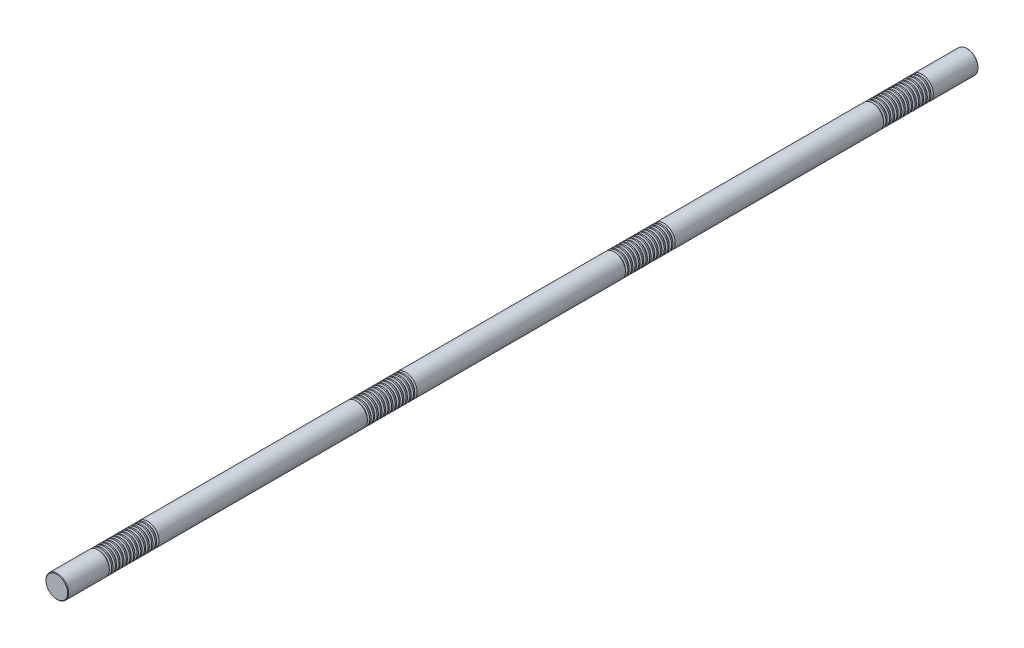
ISO-10303-21;
HEADER;
FILE_DESCRIPTION(('STEP AP214'),'2;1');
FILE_NAME('part.step','',(''),(''),'','','');
FILE_SCHEMA(('AUTOMOTIVE_DESIGN { 1 0 10303 214 1 1 1 1 }'));
ENDSEC;
DATA;
#1=APPLICATION_CONTEXT('core data for automotive mechanical design processes');
#2=APPLICATION_PROTOCOL_DEFINITION('international standard','automotive_design',2000,#1);
#3=PRODUCT_CONTEXT('',#1,'mechanical');
#4=PRODUCT('Part','Part','',(#3));
#5=PRODUCT_RELATED_PRODUCT_CATEGORY('part','',(#4));
#6=PRODUCT_DEFINITION_FORMATION('','',#4);
#7=PRODUCT_DEFINITION_CONTEXT('part definition',#1,'design');
#8=PRODUCT_DEFINITION('design','',#6,#7);
#9=PRODUCT_DEFINITION_SHAPE('','',#8);
#10=(LENGTH_UNIT() NAMED_UNIT(*) SI_UNIT(.MILLI.,.METRE.));
#11=(NAMED_UNIT(*) PLANE_ANGLE_UNIT() SI_UNIT($,.RADIAN.));
#12=(NAMED_UNIT(*) SI_UNIT($,.STERADIAN.) SOLID_ANGLE_UNIT());
#13=UNCERTAINTY_MEASURE_WITH_UNIT(LENGTH_MEASURE(1.E-05),#10,'distance_accuracy_value','');
#14=(GEOMETRIC_REPRESENTATION_CONTEXT(3) GLOBAL_UNCERTAINTY_ASSIGNED_CONTEXT((#13)) GLOBAL_UNIT_ASSIGNED_CONTEXT((#10,
#11,#12)) REPRESENTATION_CONTEXT('',''));
#15=CARTESIAN_POINT('',(0.,0.,0.));
#16=DIRECTION('',(0.,0.,1.));
#17=DIRECTION('',(1.,0.,0.));
#18=AXIS2_PLACEMENT_3D('',#15,#16,#17);
#19=CARTESIAN_POINT('',(0.,0.,1000.));
#20=DIRECTION('',(0.,0.,-1.));
#21=DIRECTION('',(-1.,0.,0.));
#22=AXIS2_PLACEMENT_3D('',#19,#20,#21);
#23=CYLINDRICAL_SURFACE('',#22,25.);
#24=CARTESIAN_POINT('',(0.,0.,901.602885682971));
#25=DIRECTION('',(0.,0.,1.));
#26=DIRECTION('',(1.,0.,0.));
#27=AXIS2_PLACEMENT_3D('',#24,#25,#26);
#28=CIRCLE('',#27,25.);
#29=CARTESIAN_POINT('',(25.,0.,901.602885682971));
#30=VERTEX_POINT('',#29);
#31=EDGE_CURVE('E931',#30,#30,#28,.T.);
#32=ORIENTED_EDGE('',*,*,#31,.T.);
#33=EDGE_LOOP('',(#32));
#34=FACE_BOUND('',#33,.T.);
#35=CARTESIAN_POINT('',(0.,0.,904.39711431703));
#36=DIRECTION('',(0.,0.,1.));
#37=DIRECTION('',(1.,0.,0.));
#38=AXIS2_PLACEMENT_3D('',#35,#36,#37);
#39=CIRCLE('',#38,25.);
#40=CARTESIAN_POINT('',(25.,0.,904.39711431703));
#41=VERTEX_POINT('',#40);
#42=EDGE_CURVE('E942',#41,#41,#39,.T.);
#43=ORIENTED_EDGE('',*,*,#42,.F.);
#44=EDGE_LOOP('',(#43));
#45=FACE_BOUND('',#44,.T.);
#46=ADVANCED_FACE('F37',(#34,#45),#23,.T.);
#47=CARTESIAN_POINT('',(0.,0.,893.602885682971));
#48=DIRECTION('',(0.,0.,1.));
#49=DIRECTION('',(1.,0.,0.));
#50=AXIS2_PLACEMENT_3D('',#47,#48,#49);
#51=CIRCLE('',#50,25.);
#52=CARTESIAN_POINT('',(25.,0.,893.602885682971));
#53=VERTEX_POINT('',#52);
#54=EDGE_CURVE('E915',#53,#53,#51,.T.);
#55=ORIENTED_EDGE('',*,*,#54,.T.);
#56=EDGE_LOOP('',(#55));
#57=FACE_BOUND('',#56,.T.);
#58=CARTESIAN_POINT('',(0.,0.,896.39711431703));
#59=DIRECTION('',(0.,0.,1.));
#60=DIRECTION('',(1.,0.,0.));
#61=AXIS2_PLACEMENT_3D('',#58,#59,#60);
#62=CIRCLE('',#61,25.);
#63=CARTESIAN_POINT('',(25.,0.,896.39711431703));
#64=VERTEX_POINT('',#63);
#65=EDGE_CURVE('E927',#64,#64,#62,.T.);
#66=ORIENTED_EDGE('',*,*,#65,.F.);
#67=EDGE_LOOP('',(#66));
#68=FACE_BOUND('',#67,.T.);
#69=ADVANCED_FACE('F977',(#57,#68),#23,.T.);
#70=CARTESIAN_POINT('',(0.,0.,885.602885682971));
#71=DIRECTION('',(0.,0.,1.));
#72=DIRECTION('',(1.,0.,0.));
#73=AXIS2_PLACEMENT_3D('',#70,#71,#72);
#74=CIRCLE('',#73,25.);
#75=CARTESIAN_POINT('',(25.,0.,885.602885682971));
#76=VERTEX_POINT('',#75);
#77=EDGE_CURVE('E899',#76,#76,#74,.T.);
#78=ORIENTED_EDGE('',*,*,#77,.T.);
#79=EDGE_LOOP('',(#78));
#80=FACE_BOUND('',#79,.T.);
#81=CARTESIAN_POINT('',(0.,0.,888.39711431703));
#82=DIRECTION('',(0.,0.,1.));
#83=DIRECTION('',(1.,0.,0.));
#84=AXIS2_PLACEMENT_3D('',#81,#82,#83);
#85=CIRCLE('',#84,25.);
#86=CARTESIAN_POINT('',(25.,0.,888.39711431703));
#87=VERTEX_POINT('',#86);
#88=EDGE_CURVE('E911',#87,#87,#85,.T.);
#89=ORIENTED_EDGE('',*,*,#88,.F.);
#90=EDGE_LOOP('',(#89));
#91=FACE_BOUND('',#90,.T.);
#92=ADVANCED_FACE('F985',(#80,#91),#23,.T.);
#93=CARTESIAN_POINT('',(0.,0.,877.602885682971));
#94=DIRECTION('',(0.,0.,1.));
#95=DIRECTION('',(1.,0.,0.));
#96=AXIS2_PLACEMENT_3D('',#93,#94,#95);
#97=CIRCLE('',#96,25.);
#98=CARTESIAN_POINT('',(25.,0.,877.602885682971));
#99=VERTEX_POINT('',#98);
#100=EDGE_CURVE('E883',#99,#99,#97,.T.);
#101=ORIENTED_EDGE('',*,*,#100,.T.);
#102=EDGE_LOOP('',(#101));
#103=FACE_BOUND('',#102,.T.);
#104=CARTESIAN_POINT('',(0.,0.,880.39711431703));
#105=DIRECTION('',(0.,0.,1.));
#106=DIRECTION('',(1.,0.,0.));
#107=AXIS2_PLACEMENT_3D('',#104,#105,#106);
#108=CIRCLE('',#107,25.);
#109=CARTESIAN_POINT('',(25.,0.,880.39711431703));
#110=VERTEX_POINT('',#109);
#111=EDGE_CURVE('E895',#110,#110,#108,.T.);
#112=ORIENTED_EDGE('',*,*,#111,.F.);
#113=EDGE_LOOP('',(#112));
#114=FACE_BOUND('',#113,.T.);
#115=ADVANCED_FACE('F2178',(#103,#114),#23,.T.);
#116=CARTESIAN_POINT('',(0.,0.,869.602885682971));
#117=DIRECTION('',(0.,0.,1.));
#118=DIRECTION('',(1.,0.,0.));
#119=AXIS2_PLACEMENT_3D('',#116,#117,#118);
#120=CIRCLE('',#119,25.);
#121=CARTESIAN_POINT('',(25.,0.,869.602885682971));
#122=VERTEX_POINT('',#121);
#123=EDGE_CURVE('E867',#122,#122,#120,.T.);
#124=ORIENTED_EDGE('',*,*,#123,.T.);
#125=EDGE_LOOP('',(#124));
#126=FACE_BOUND('',#125,.T.);
#127=CARTESIAN_POINT('',(0.,0.,872.39711431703));
#128=DIRECTION('',(0.,0.,1.));
#129=DIRECTION('',(1.,0.,0.));
#130=AXIS2_PLACEMENT_3D('',#127,#128,#129);
#131=CIRCLE('',#130,25.);
#132=CARTESIAN_POINT('',(25.,0.,872.39711431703));
#133=VERTEX_POINT('',#132);
#134=EDGE_CURVE('E879',#133,#133,#131,.T.);
#135=ORIENTED_EDGE('',*,*,#134,.F.);
#136=EDGE_LOOP('',(#135));
#137=FACE_BOUND('',#136,.T.);
#138=ADVANCED_FACE('F2155',(#126,#137),#23,.T.);
#139=CARTESIAN_POINT('',(0.,0.,861.602885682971));
#140=DIRECTION('',(0.,0.,1.));
#141=DIRECTION('',(1.,0.,0.));
#142=AXIS2_PLACEMENT_3D('',#139,#140,#141);
#143=CIRCLE('',#142,25.);
#144=CARTESIAN_POINT('',(25.,0.,861.602885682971));
#145=VERTEX_POINT('',#144);
#146=EDGE_CURVE('E851',#145,#145,#143,.T.);
#147=ORIENTED_EDGE('',*,*,#146,.T.);
#148=EDGE_LOOP('',(#147));
#149=FACE_BOUND('',#148,.T.);
#150=CARTESIAN_POINT('',(0.,0.,864.39711431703));
#151=DIRECTION('',(0.,0.,1.));
#152=DIRECTION('',(1.,0.,0.));
#153=AXIS2_PLACEMENT_3D('',#150,#151,#152);
#154=CIRCLE('',#153,25.);
#155=CARTESIAN_POINT('',(25.,0.,864.39711431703));
#156=VERTEX_POINT('',#155);
#157=EDGE_CURVE('E863',#156,#156,#154,.T.);
#158=ORIENTED_EDGE('',*,*,#157,.F.);
#159=EDGE_LOOP('',(#158));
#160=FACE_BOUND('',#159,.T.);
#161=ADVANCED_FACE('F2132',(#149,#160),#23,.T.);
#162=CARTESIAN_POINT('',(0.,0.,853.602885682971));
#163=DIRECTION('',(0.,0.,1.));
#164=DIRECTION('',(1.,0.,0.));
#165=AXIS2_PLACEMENT_3D('',#162,#163,#164);
#166=CIRCLE('',#165,25.);
#167=CARTESIAN_POINT('',(25.,0.,853.602885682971));
#168=VERTEX_POINT('',#167);
#169=EDGE_CURVE('E835',#168,#168,#166,.T.);
#170=ORIENTED_EDGE('',*,*,#169,.T.);
#171=EDGE_LOOP('',(#170));
#172=FACE_BOUND('',#171,.T.);
#173=CARTESIAN_POINT('',(0.,0.,856.39711431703));
#174=DIRECTION('',(0.,0.,1.));
#175=DIRECTION('',(1.,0.,0.));
#176=AXIS2_PLACEMENT_3D('',#173,#174,#175);
#177=CIRCLE('',#176,25.);
#178=CARTESIAN_POINT('',(25.,0.,856.39711431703));
#179=VERTEX_POINT('',#178);
#180=EDGE_CURVE('E847',#179,#179,#177,.T.);
#181=ORIENTED_EDGE('',*,*,#180,.F.);
#182=EDGE_LOOP('',(#181));
#183=FACE_BOUND('',#182,.T.);
#184=ADVANCED_FACE('F2109',(#172,#183),#23,.T.);
#185=CARTESIAN_POINT('',(0.,0.,845.602885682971));
#186=DIRECTION('',(0.,0.,1.));
#187=DIRECTION('',(1.,0.,0.));
#188=AXIS2_PLACEMENT_3D('',#185,#186,#187);
#189=CIRCLE('',#188,25.);
#190=CARTESIAN_POINT('',(25.,0.,845.602885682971));
#191=VERTEX_POINT('',#190);
#192=EDGE_CURVE('E819',#191,#191,#189,.T.);
#193=ORIENTED_EDGE('',*,*,#192,.T.);
#194=EDGE_LOOP('',(#193));
#195=FACE_BOUND('',#194,.T.);
#196=CARTESIAN_POINT('',(0.,0.,848.39711431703));
#197=DIRECTION('',(0.,0.,1.));
#198=DIRECTION('',(1.,0.,0.));
#199=AXIS2_PLACEMENT_3D('',#196,#197,#198);
#200=CIRCLE('',#199,25.);
#201=CARTESIAN_POINT('',(25.,0.,848.39711431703));
#202=VERTEX_POINT('',#201);
#203=EDGE_CURVE('E831',#202,#202,#200,.T.);
#204=ORIENTED_EDGE('',*,*,#203,.F.);
#205=EDGE_LOOP('',(#204));
#206=FACE_BOUND('',#205,.T.);
#207=ADVANCED_FACE('F2086',(#195,#206),#23,.T.);
#208=CARTESIAN_POINT('',(0.,0.,837.602885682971));
#209=DIRECTION('',(0.,0.,1.));
#210=DIRECTION('',(1.,0.,0.));
#211=AXIS2_PLACEMENT_3D('',#208,#209,#210);
#212=CIRCLE('',#211,25.);
#213=CARTESIAN_POINT('',(25.,0.,837.602885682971));
#214=VERTEX_POINT('',#213);
#215=EDGE_CURVE('E803',#214,#214,#212,.T.);
#216=ORIENTED_EDGE('',*,*,#215,.T.);
#217=EDGE_LOOP('',(#216));
#218=FACE_BOUND('',#217,.T.);
#219=CARTESIAN_POINT('',(0.,0.,840.39711431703));
#220=DIRECTION('',(0.,0.,1.));
#221=DIRECTION('',(1.,0.,0.));
#222=AXIS2_PLACEMENT_3D('',#219,#220,#221);
#223=CIRCLE('',#222,25.);
#224=CARTESIAN_POINT('',(25.,0.,840.39711431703));
#225=VERTEX_POINT('',#224);
#226=EDGE_CURVE('E815',#225,#225,#223,.T.);
#227=ORIENTED_EDGE('',*,*,#226,.F.);
#228=EDGE_LOOP('',(#227));
#229=FACE_BOUND('',#228,.T.);
#230=ADVANCED_FACE('F2063',(#218,#229),#23,.T.);
#231=CARTESIAN_POINT('',(0.,0.,829.602885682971));
#232=DIRECTION('',(0.,0.,1.));
#233=DIRECTION('',(1.,0.,0.));
#234=AXIS2_PLACEMENT_3D('',#231,#232,#233);
#235=CIRCLE('',#234,25.);
#236=CARTESIAN_POINT('',(25.,0.,829.602885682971));
#237=VERTEX_POINT('',#236);
#238=EDGE_CURVE('E787',#237,#237,#235,.T.);
#239=ORIENTED_EDGE('',*,*,#238,.T.);
#240=EDGE_LOOP('',(#239));
#241=FACE_BOUND('',#240,.T.);
#242=CARTESIAN_POINT('',(0.,0.,832.39711431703));
#243=DIRECTION('',(0.,0.,1.));
#244=DIRECTION('',(1.,0.,0.));
#245=AXIS2_PLACEMENT_3D('',#242,#243,#244);
#246=CIRCLE('',#245,25.);
#247=CARTESIAN_POINT('',(25.,0.,832.39711431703));
#248=VERTEX_POINT('',#247);
#249=EDGE_CURVE('E799',#248,#248,#246,.T.);
#250=ORIENTED_EDGE('',*,*,#249,.F.);
#251=EDGE_LOOP('',(#250));
#252=FACE_BOUND('',#251,.T.);
#253=ADVANCED_FACE('F2040',(#241,#252),#23,.T.);
#254=CARTESIAN_POINT('',(0.,0.,821.602885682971));
#255=DIRECTION('',(0.,0.,1.));
#256=DIRECTION('',(1.,0.,0.));
#257=AXIS2_PLACEMENT_3D('',#254,#255,#256);
#258=CIRCLE('',#257,25.);
#259=CARTESIAN_POINT('',(25.,0.,821.602885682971));
#260=VERTEX_POINT('',#259);
#261=EDGE_CURVE('E771',#260,#260,#258,.T.);
#262=ORIENTED_EDGE('',*,*,#261,.T.);
#263=EDGE_LOOP('',(#262));
#264=FACE_BOUND('',#263,.T.);
#265=CARTESIAN_POINT('',(0.,0.,824.39711431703));
#266=DIRECTION('',(0.,0.,1.));
#267=DIRECTION('',(1.,0.,0.));
#268=AXIS2_PLACEMENT_3D('',#265,#266,#267);
#269=CIRCLE('',#268,25.);
#270=CARTESIAN_POINT('',(25.,0.,824.39711431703));
#271=VERTEX_POINT('',#270);
#272=EDGE_CURVE('E783',#271,#271,#269,.T.);
#273=ORIENTED_EDGE('',*,*,#272,.F.);
#274=EDGE_LOOP('',(#273));
#275=FACE_BOUND('',#274,.T.);
#276=ADVANCED_FACE('F2017',(#264,#275),#23,.T.);
#277=CARTESIAN_POINT('',(0.,0.,813.602885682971));
#278=DIRECTION('',(0.,0.,1.));
#279=DIRECTION('',(1.,0.,0.));
#280=AXIS2_PLACEMENT_3D('',#277,#278,#279);
#281=CIRCLE('',#280,25.);
#282=CARTESIAN_POINT('',(25.,0.,813.602885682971));
#283=VERTEX_POINT('',#282);
#284=EDGE_CURVE('E755',#283,#283,#281,.T.);
#285=ORIENTED_EDGE('',*,*,#284,.T.);
#286=EDGE_LOOP('',(#285));
#287=FACE_BOUND('',#286,.T.);
#288=CARTESIAN_POINT('',(0.,0.,816.39711431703));
#289=DIRECTION('',(0.,0.,1.));
#290=DIRECTION('',(1.,0.,0.));
#291=AXIS2_PLACEMENT_3D('',#288,#289,#290);
#292=CIRCLE('',#291,25.);
#293=CARTESIAN_POINT('',(25.,0.,816.39711431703));
#294=VERTEX_POINT('',#293);
#295=EDGE_CURVE('E767',#294,#294,#292,.T.);
#296=ORIENTED_EDGE('',*,*,#295,.F.);
#297=EDGE_LOOP('',(#296));
#298=FACE_BOUND('',#297,.T.);
#299=ADVANCED_FACE('F1998',(#287,#298),#23,.T.);
#300=CARTESIAN_POINT('',(0.,0.,805.602885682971));
#301=DIRECTION('',(0.,0.,1.));
#302=DIRECTION('',(1.,0.,0.));
#303=AXIS2_PLACEMENT_3D('',#300,#301,#302);
#304=CIRCLE('',#303,25.);
#305=CARTESIAN_POINT('',(25.,0.,805.602885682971));
#306=VERTEX_POINT('',#305);
#307=EDGE_CURVE('E324',#306,#306,#304,.T.);
#308=ORIENTED_EDGE('',*,*,#307,.T.);
#309=EDGE_LOOP('',(#308));
#310=FACE_BOUND('',#309,.T.);
#311=CARTESIAN_POINT('',(0.,0.,808.39711431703));
#312=DIRECTION('',(0.,0.,1.));
#313=DIRECTION('',(1.,0.,0.));
#314=AXIS2_PLACEMENT_3D('',#311,#312,#313);
#315=CIRCLE('',#314,25.);
#316=CARTESIAN_POINT('',(25.,0.,808.39711431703));
#317=VERTEX_POINT('',#316);
#318=EDGE_CURVE('E751',#317,#317,#315,.T.);
#319=ORIENTED_EDGE('',*,*,#318,.F.);
#320=EDGE_LOOP('',(#319));
#321=FACE_BOUND('',#320,.T.);
#322=ADVANCED_FACE('F1947',(#310,#321),#23,.T.);
#323=CARTESIAN_POINT('',(0.,0.,334.602885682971));
#324=DIRECTION('',(0.,0.,1.));
#325=DIRECTION('',(1.,0.,0.));
#326=AXIS2_PLACEMENT_3D('',#323,#324,#325);
#327=CIRCLE('',#326,25.);
#328=CARTESIAN_POINT('',(25.,0.,334.602885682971));
#329=VERTEX_POINT('',#328);
#330=EDGE_CURVE('E723',#329,#329,#327,.T.);
#331=ORIENTED_EDGE('',*,*,#330,.T.);
#332=EDGE_LOOP('',(#331));
#333=FACE_BOUND('',#332,.T.);
#334=CARTESIAN_POINT('',(0.,0.,337.39711431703));
#335=DIRECTION('',(0.,0.,1.));
#336=DIRECTION('',(1.,0.,0.));
#337=AXIS2_PLACEMENT_3D('',#334,#335,#336);
#338=CIRCLE('',#337,25.);
#339=CARTESIAN_POINT('',(25.,0.,337.39711431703));
#340=VERTEX_POINT('',#339);
#341=EDGE_CURVE('E735',#340,#340,#338,.T.);
#342=ORIENTED_EDGE('',*,*,#341,.F.);
#343=EDGE_LOOP('',(#342));
#344=FACE_BOUND('',#343,.T.);
#345=ADVANCED_FACE('F1923',(#333,#344),#23,.T.);
#346=CARTESIAN_POINT('',(0.,0.,326.602885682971));
#347=DIRECTION('',(0.,0.,1.));
#348=DIRECTION('',(1.,0.,0.));
#349=AXIS2_PLACEMENT_3D('',#346,#347,#348);
#350=CIRCLE('',#349,25.);
#351=CARTESIAN_POINT('',(25.,0.,326.602885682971));
#352=VERTEX_POINT('',#351);
#353=EDGE_CURVE('E707',#352,#352,#350,.T.);
#354=ORIENTED_EDGE('',*,*,#353,.T.);
#355=EDGE_LOOP('',(#354));
#356=FACE_BOUND('',#355,.T.);
#357=CARTESIAN_POINT('',(0.,0.,329.39711431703));
#358=DIRECTION('',(0.,0.,1.));
#359=DIRECTION('',(1.,0.,0.));
#360=AXIS2_PLACEMENT_3D('',#357,#358,#359);
#361=CIRCLE('',#360,25.);
#362=CARTESIAN_POINT('',(25.,0.,329.39711431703));
#363=VERTEX_POINT('',#362);
#364=EDGE_CURVE('E719',#363,#363,#361,.T.);
#365=ORIENTED_EDGE('',*,*,#364,.F.);
#366=EDGE_LOOP('',(#365));
#367=FACE_BOUND('',#366,.T.);
#368=ADVANCED_FACE('F1900',(#356,#367),#23,.T.);
#369=CARTESIAN_POINT('',(0.,0.,318.602885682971));
#370=DIRECTION('',(0.,0.,1.));
#371=DIRECTION('',(1.,0.,0.));
#372=AXIS2_PLACEMENT_3D('',#369,#370,#371);
#373=CIRCLE('',#372,25.);
#374=CARTESIAN_POINT('',(25.,0.,318.602885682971));
#375=VERTEX_POINT('',#374);
#376=EDGE_CURVE('E691',#375,#375,#373,.T.);
#377=ORIENTED_EDGE('',*,*,#376,.T.);
#378=EDGE_LOOP('',(#377));
#379=FACE_BOUND('',#378,.T.);
#380=CARTESIAN_POINT('',(0.,0.,321.39711431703));
#381=DIRECTION('',(0.,0.,1.));
#382=DIRECTION('',(1.,0.,0.));
#383=AXIS2_PLACEMENT_3D('',#380,#381,#382);
#384=CIRCLE('',#383,25.);
#385=CARTESIAN_POINT('',(25.,0.,321.39711431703));
#386=VERTEX_POINT('',#385);
#387=EDGE_CURVE('E703',#386,#386,#384,.T.);
#388=ORIENTED_EDGE('',*,*,#387,.F.);
#389=EDGE_LOOP('',(#388));
#390=FACE_BOUND('',#389,.T.);
#391=ADVANCED_FACE('F1877',(#379,#390),#23,.T.);
#392=CARTESIAN_POINT('',(0.,0.,310.602885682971));
#393=DIRECTION('',(0.,0.,1.));
#394=DIRECTION('',(1.,0.,0.));
#395=AXIS2_PLACEMENT_3D('',#392,#393,#394);
#396=CIRCLE('',#395,25.);
#397=CARTESIAN_POINT('',(25.,0.,310.602885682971));
#398=VERTEX_POINT('',#397);
#399=EDGE_CURVE('E675',#398,#398,#396,.T.);
#400=ORIENTED_EDGE('',*,*,#399,.T.);
#401=EDGE_LOOP('',(#400));
#402=FACE_BOUND('',#401,.T.);
#403=CARTESIAN_POINT('',(0.,0.,313.39711431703));
#404=DIRECTION('',(0.,0.,1.));
#405=DIRECTION('',(1.,0.,0.));
#406=AXIS2_PLACEMENT_3D('',#403,#404,#405);
#407=CIRCLE('',#406,25.);
#408=CARTESIAN_POINT('',(25.,0.,313.39711431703));
#409=VERTEX_POINT('',#408);
#410=EDGE_CURVE('E687',#409,#409,#407,.T.);
#411=ORIENTED_EDGE('',*,*,#410,.F.);
#412=EDGE_LOOP('',(#411));
#413=FACE_BOUND('',#412,.T.);
#414=ADVANCED_FACE('F1854',(#402,#413),#23,.T.);
#415=CARTESIAN_POINT('',(0.,0.,302.602885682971));
#416=DIRECTION('',(0.,0.,1.));
#417=DIRECTION('',(1.,0.,0.));
#418=AXIS2_PLACEMENT_3D('',#415,#416,#417);
#419=CIRCLE('',#418,25.);
#420=CARTESIAN_POINT('',(25.,0.,302.602885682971));
#421=VERTEX_POINT('',#420);
#422=EDGE_CURVE('E659',#421,#421,#419,.T.);
#423=ORIENTED_EDGE('',*,*,#422,.T.);
#424=EDGE_LOOP('',(#423));
#425=FACE_BOUND('',#424,.T.);
#426=CARTESIAN_POINT('',(0.,0.,305.39711431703));
#427=DIRECTION('',(0.,0.,1.));
#428=DIRECTION('',(1.,0.,0.));
#429=AXIS2_PLACEMENT_3D('',#426,#427,#428);
#430=CIRCLE('',#429,25.);
#431=CARTESIAN_POINT('',(25.,0.,305.39711431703));
#432=VERTEX_POINT('',#431);
#433=EDGE_CURVE('E671',#432,#432,#430,.T.);
#434=ORIENTED_EDGE('',*,*,#433,.F.);
#435=EDGE_LOOP('',(#434));
#436=FACE_BOUND('',#435,.T.);
#437=ADVANCED_FACE('F1831',(#425,#436),#23,.T.);
#438=CARTESIAN_POINT('',(0.,0.,294.602885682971));
#439=DIRECTION('',(0.,0.,1.));
#440=DIRECTION('',(1.,0.,0.));
#441=AXIS2_PLACEMENT_3D('',#438,#439,#440);
#442=CIRCLE('',#441,25.);
#443=CARTESIAN_POINT('',(25.,0.,294.602885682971));
#444=VERTEX_POINT('',#443);
#445=EDGE_CURVE('E643',#444,#444,#442,.T.);
#446=ORIENTED_EDGE('',*,*,#445,.T.);
#447=EDGE_LOOP('',(#446));
#448=FACE_BOUND('',#447,.T.);
#449=CARTESIAN_POINT('',(0.,0.,297.39711431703));
#450=DIRECTION('',(0.,0.,1.));
#451=DIRECTION('',(1.,0.,0.));
#452=AXIS2_PLACEMENT_3D('',#449,#450,#451);
#453=CIRCLE('',#452,25.);
#454=CARTESIAN_POINT('',(25.,0.,297.39711431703));
#455=VERTEX_POINT('',#454);
#456=EDGE_CURVE('E655',#455,#455,#453,.T.);
#457=ORIENTED_EDGE('',*,*,#456,.F.);
#458=EDGE_LOOP('',(#457));
#459=FACE_BOUND('',#458,.T.);
#460=ADVANCED_FACE('F1808',(#448,#459),#23,.T.);
#461=CARTESIAN_POINT('',(0.,0.,286.602885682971));
#462=DIRECTION('',(0.,0.,1.));
#463=DIRECTION('',(1.,0.,0.));
#464=AXIS2_PLACEMENT_3D('',#461,#462,#463);
#465=CIRCLE('',#464,25.);
#466=CARTESIAN_POINT('',(25.,0.,286.602885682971));
#467=VERTEX_POINT('',#466);
#468=EDGE_CURVE('E627',#467,#467,#465,.T.);
#469=ORIENTED_EDGE('',*,*,#468,.T.);
#470=EDGE_LOOP('',(#469));
#471=FACE_BOUND('',#470,.T.);
#472=CARTESIAN_POINT('',(0.,0.,289.39711431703));
#473=DIRECTION('',(0.,0.,1.));
#474=DIRECTION('',(1.,0.,0.));
#475=AXIS2_PLACEMENT_3D('',#472,#473,#474);
#476=CIRCLE('',#475,25.);
#477=CARTESIAN_POINT('',(25.,0.,289.39711431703));
#478=VERTEX_POINT('',#477);
#479=EDGE_CURVE('E639',#478,#478,#476,.T.);
#480=ORIENTED_EDGE('',*,*,#479,.F.);
#481=EDGE_LOOP('',(#480));
#482=FACE_BOUND('',#481,.T.);
#483=ADVANCED_FACE('F1785',(#471,#482),#23,.T.);
#484=CARTESIAN_POINT('',(0.,0.,278.602885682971));
#485=DIRECTION('',(0.,0.,1.));
#486=DIRECTION('',(1.,0.,0.));
#487=AXIS2_PLACEMENT_3D('',#484,#485,#486);
#488=CIRCLE('',#487,25.);
#489=CARTESIAN_POINT('',(25.,0.,278.602885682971));
#490=VERTEX_POINT('',#489);
#491=EDGE_CURVE('E611',#490,#490,#488,.T.);
#492=ORIENTED_EDGE('',*,*,#491,.T.);
#493=EDGE_LOOP('',(#492));
#494=FACE_BOUND('',#493,.T.);
#495=CARTESIAN_POINT('',(0.,0.,281.39711431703));
#496=DIRECTION('',(0.,0.,1.));
#497=DIRECTION('',(1.,0.,0.));
#498=AXIS2_PLACEMENT_3D('',#495,#496,#497);
#499=CIRCLE('',#498,25.);
#500=CARTESIAN_POINT('',(25.,0.,281.39711431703));
#501=VERTEX_POINT('',#500);
#502=EDGE_CURVE('E623',#501,#501,#499,.T.);
#503=ORIENTED_EDGE('',*,*,#502,.F.);
#504=EDGE_LOOP('',(#503));
#505=FACE_BOUND('',#504,.T.);
#506=ADVANCED_FACE('F1762',(#494,#505),#23,.T.);
#507=CARTESIAN_POINT('',(0.,0.,270.602885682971));
#508=DIRECTION('',(0.,0.,1.));
#509=DIRECTION('',(1.,0.,0.));
#510=AXIS2_PLACEMENT_3D('',#507,#508,#509);
#511=CIRCLE('',#510,25.);
#512=CARTESIAN_POINT('',(25.,0.,270.602885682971));
#513=VERTEX_POINT('',#512);
#514=EDGE_CURVE('E595',#513,#513,#511,.T.);
#515=ORIENTED_EDGE('',*,*,#514,.T.);
#516=EDGE_LOOP('',(#515));
#517=FACE_BOUND('',#516,.T.);
#518=CARTESIAN_POINT('',(0.,0.,273.39711431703));
#519=DIRECTION('',(0.,0.,1.));
#520=DIRECTION('',(1.,0.,0.));
#521=AXIS2_PLACEMENT_3D('',#518,#519,#520);
#522=CIRCLE('',#521,25.);
#523=CARTESIAN_POINT('',(25.,0.,273.39711431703));
#524=VERTEX_POINT('',#523);
#525=EDGE_CURVE('E607',#524,#524,#522,.T.);
#526=ORIENTED_EDGE('',*,*,#525,.F.);
#527=EDGE_LOOP('',(#526));
#528=FACE_BOUND('',#527,.T.);
#529=ADVANCED_FACE('F1739',(#517,#528),#23,.T.);
#530=CARTESIAN_POINT('',(0.,0.,262.602885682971));
#531=DIRECTION('',(0.,0.,1.));
#532=DIRECTION('',(1.,0.,0.));
#533=AXIS2_PLACEMENT_3D('',#530,#531,#532);
#534=CIRCLE('',#533,25.);
#535=CARTESIAN_POINT('',(25.,0.,262.602885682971));
#536=VERTEX_POINT('',#535);
#537=EDGE_CURVE('E579',#536,#536,#534,.T.);
#538=ORIENTED_EDGE('',*,*,#537,.T.);
#539=EDGE_LOOP('',(#538));
#540=FACE_BOUND('',#539,.T.);
#541=CARTESIAN_POINT('',(0.,0.,265.39711431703));
#542=DIRECTION('',(0.,0.,1.));
#543=DIRECTION('',(1.,0.,0.));
#544=AXIS2_PLACEMENT_3D('',#541,#542,#543);
#545=CIRCLE('',#544,25.);
#546=CARTESIAN_POINT('',(25.,0.,265.39711431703));
#547=VERTEX_POINT('',#546);
#548=EDGE_CURVE('E591',#547,#547,#545,.T.);
#549=ORIENTED_EDGE('',*,*,#548,.F.);
#550=EDGE_LOOP('',(#549));
#551=FACE_BOUND('',#550,.T.);
#552=ADVANCED_FACE('F1716',(#540,#551),#23,.T.);
#553=CARTESIAN_POINT('',(0.,0.,254.602885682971));
#554=DIRECTION('',(0.,0.,1.));
#555=DIRECTION('',(1.,0.,0.));
#556=AXIS2_PLACEMENT_3D('',#553,#554,#555);
#557=CIRCLE('',#556,25.);
#558=CARTESIAN_POINT('',(25.,0.,254.602885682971));
#559=VERTEX_POINT('',#558);
#560=EDGE_CURVE('E563',#559,#559,#557,.T.);
#561=ORIENTED_EDGE('',*,*,#560,.T.);
#562=EDGE_LOOP('',(#561));
#563=FACE_BOUND('',#562,.T.);
#564=CARTESIAN_POINT('',(0.,0.,257.39711431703));
#565=DIRECTION('',(0.,0.,1.));
#566=DIRECTION('',(1.,0.,0.));
#567=AXIS2_PLACEMENT_3D('',#564,#565,#566);
#568=CIRCLE('',#567,25.);
#569=CARTESIAN_POINT('',(25.,0.,257.39711431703));
#570=VERTEX_POINT('',#569);
#571=EDGE_CURVE('E575',#570,#570,#568,.T.);
#572=ORIENTED_EDGE('',*,*,#571,.F.);
#573=EDGE_LOOP('',(#572));
#574=FACE_BOUND('',#573,.T.);
#575=ADVANCED_FACE('F1693',(#563,#574),#23,.T.);
#576=CARTESIAN_POINT('',(0.,0.,246.602885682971));
#577=DIRECTION('',(0.,0.,1.));
#578=DIRECTION('',(1.,0.,0.));
#579=AXIS2_PLACEMENT_3D('',#576,#577,#578);
#580=CIRCLE('',#579,25.);
#581=CARTESIAN_POINT('',(25.,0.,246.602885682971));
#582=VERTEX_POINT('',#581);
#583=EDGE_CURVE('E547',#582,#582,#580,.T.);
#584=ORIENTED_EDGE('',*,*,#583,.T.);
#585=EDGE_LOOP('',(#584));
#586=FACE_BOUND('',#585,.T.);
#587=CARTESIAN_POINT('',(0.,0.,249.39711431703));
#588=DIRECTION('',(0.,0.,1.));
#589=DIRECTION('',(1.,0.,0.));
#590=AXIS2_PLACEMENT_3D('',#587,#588,#589);
#591=CIRCLE('',#590,25.);
#592=CARTESIAN_POINT('',(25.,0.,249.39711431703));
#593=VERTEX_POINT('',#592);
#594=EDGE_CURVE('E559',#593,#593,#591,.T.);
#595=ORIENTED_EDGE('',*,*,#594,.F.);
#596=EDGE_LOOP('',(#595));
#597=FACE_BOUND('',#596,.T.);
#598=ADVANCED_FACE('F1674',(#586,#597),#23,.T.);
#599=CARTESIAN_POINT('',(0.,0.,238.602885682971));
#600=DIRECTION('',(0.,0.,1.));
#601=DIRECTION('',(1.,0.,0.));
#602=AXIS2_PLACEMENT_3D('',#599,#600,#601);
#603=CIRCLE('',#602,25.);
#604=CARTESIAN_POINT('',(25.,0.,238.602885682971));
#605=VERTEX_POINT('',#604);
#606=EDGE_CURVE('E308',#605,#605,#603,.T.);
#607=ORIENTED_EDGE('',*,*,#606,.T.);
#608=EDGE_LOOP('',(#607));
#609=FACE_BOUND('',#608,.T.);
#610=CARTESIAN_POINT('',(0.,0.,241.39711431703));
#611=DIRECTION('',(0.,0.,1.));
#612=DIRECTION('',(1.,0.,0.));
#613=AXIS2_PLACEMENT_3D('',#610,#611,#612);
#614=CIRCLE('',#613,25.);
#615=CARTESIAN_POINT('',(25.,0.,241.39711431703));
#616=VERTEX_POINT('',#615);
#617=EDGE_CURVE('E543',#616,#616,#614,.T.);
#618=ORIENTED_EDGE('',*,*,#617,.F.);
#619=EDGE_LOOP('',(#618));
#620=FACE_BOUND('',#619,.T.);
#621=ADVANCED_FACE('F1623',(#609,#620),#23,.T.);
#622=CARTESIAN_POINT('',(0.,0.,-232.397114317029));
#623=DIRECTION('',(0.,0.,1.));
#624=DIRECTION('',(1.,0.,0.));
#625=AXIS2_PLACEMENT_3D('',#622,#623,#624);
#626=CIRCLE('',#625,25.);
#627=CARTESIAN_POINT('',(25.,0.,-232.397114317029));
#628=VERTEX_POINT('',#627);
#629=EDGE_CURVE('E515',#628,#628,#626,.T.);
#630=ORIENTED_EDGE('',*,*,#629,.T.);
#631=EDGE_LOOP('',(#630));
#632=FACE_BOUND('',#631,.T.);
#633=CARTESIAN_POINT('',(0.,0.,-229.60288568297));
#634=DIRECTION('',(0.,0.,1.));
#635=DIRECTION('',(1.,0.,0.));
#636=AXIS2_PLACEMENT_3D('',#633,#634,#635);
#637=CIRCLE('',#636,25.);
#638=CARTESIAN_POINT('',(25.,0.,-229.60288568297));
#639=VERTEX_POINT('',#638);
#640=EDGE_CURVE('E527',#639,#639,#637,.T.);
#641=ORIENTED_EDGE('',*,*,#640,.F.);
#642=EDGE_LOOP('',(#641));
#643=FACE_BOUND('',#642,.T.);
#644=ADVANCED_FACE('F1599',(#632,#643),#23,.T.);
#645=CARTESIAN_POINT('',(0.,0.,-240.397114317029));
#646=DIRECTION('',(0.,0.,1.));
#647=DIRECTION('',(1.,0.,0.));
#648=AXIS2_PLACEMENT_3D('',#645,#646,#647);
#649=CIRCLE('',#648,25.);
#650=CARTESIAN_POINT('',(25.,0.,-240.397114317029));
#651=VERTEX_POINT('',#650);
#652=EDGE_CURVE('E499',#651,#651,#649,.T.);
#653=ORIENTED_EDGE('',*,*,#652,.T.);
#654=EDGE_LOOP('',(#653));
#655=FACE_BOUND('',#654,.T.);
#656=CARTESIAN_POINT('',(0.,0.,-237.60288568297));
#657=DIRECTION('',(0.,0.,1.));
#658=DIRECTION('',(1.,0.,0.));
#659=AXIS2_PLACEMENT_3D('',#656,#657,#658);
#660=CIRCLE('',#659,25.);
#661=CARTESIAN_POINT('',(25.,0.,-237.60288568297));
#662=VERTEX_POINT('',#661);
#663=EDGE_CURVE('E511',#662,#662,#660,.T.);
#664=ORIENTED_EDGE('',*,*,#663,.F.);
#665=EDGE_LOOP('',(#664));
#666=FACE_BOUND('',#665,.T.);
#667=ADVANCED_FACE('F1576',(#655,#666),#23,.T.);
#668=CARTESIAN_POINT('',(0.,0.,-248.397114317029));
#669=DIRECTION('',(0.,0.,1.));
#670=DIRECTION('',(1.,0.,0.));
#671=AXIS2_PLACEMENT_3D('',#668,#669,#670);
#672=CIRCLE('',#671,25.);
#673=CARTESIAN_POINT('',(25.,0.,-248.397114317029));
#674=VERTEX_POINT('',#673);
#675=EDGE_CURVE('E483',#674,#674,#672,.T.);
#676=ORIENTED_EDGE('',*,*,#675,.T.);
#677=EDGE_LOOP('',(#676));
#678=FACE_BOUND('',#677,.T.);
#679=CARTESIAN_POINT('',(0.,0.,-245.60288568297));
#680=DIRECTION('',(0.,0.,1.));
#681=DIRECTION('',(1.,0.,0.));
#682=AXIS2_PLACEMENT_3D('',#679,#680,#681);
#683=CIRCLE('',#682,25.);
#684=CARTESIAN_POINT('',(25.,0.,-245.60288568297));
#685=VERTEX_POINT('',#684);
#686=EDGE_CURVE('E495',#685,#685,#683,.T.);
#687=ORIENTED_EDGE('',*,*,#686,.F.);
#688=EDGE_LOOP('',(#687));
#689=FACE_BOUND('',#688,.T.);
#690=ADVANCED_FACE('F1553',(#678,#689),#23,.T.);
#691=CARTESIAN_POINT('',(0.,0.,-256.397114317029));
#692=DIRECTION('',(0.,0.,1.));
#693=DIRECTION('',(1.,0.,0.));
#694=AXIS2_PLACEMENT_3D('',#691,#692,#693);
#695=CIRCLE('',#694,25.);
#696=CARTESIAN_POINT('',(25.,0.,-256.397114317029));
#697=VERTEX_POINT('',#696);
#698=EDGE_CURVE('E468',#697,#697,#695,.T.);
#699=ORIENTED_EDGE('',*,*,#698,.T.);
#700=EDGE_LOOP('',(#699));
#701=FACE_BOUND('',#700,.T.);
#702=CARTESIAN_POINT('',(0.,0.,-253.60288568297));
#703=DIRECTION('',(0.,0.,1.));
#704=DIRECTION('',(1.,0.,0.));
#705=AXIS2_PLACEMENT_3D('',#702,#703,#704);
#706=CIRCLE('',#705,25.);
#707=CARTESIAN_POINT('',(25.,0.,-253.60288568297));
#708=VERTEX_POINT('',#707);
#709=EDGE_CURVE('E480',#708,#708,#706,.T.);
#710=ORIENTED_EDGE('',*,*,#709,.F.);
#711=EDGE_LOOP('',(#710));
#712=FACE_BOUND('',#711,.T.);
#713=ADVANCED_FACE('F1530',(#701,#712),#23,.T.);
#714=CARTESIAN_POINT('',(0.,0.,-264.397114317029));
#715=DIRECTION('',(0.,0.,1.));
#716=DIRECTION('',(1.,0.,0.));
#717=AXIS2_PLACEMENT_3D('',#714,#715,#716);
#718=CIRCLE('',#717,25.);
#719=CARTESIAN_POINT('',(25.,0.,-264.397114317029));
#720=VERTEX_POINT('',#719);
#721=EDGE_CURVE('E452',#720,#720,#718,.T.);
#722=ORIENTED_EDGE('',*,*,#721,.T.);
#723=EDGE_LOOP('',(#722));
#724=FACE_BOUND('',#723,.T.);
#725=CARTESIAN_POINT('',(0.,0.,-261.60288568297));
#726=DIRECTION('',(0.,0.,1.));
#727=DIRECTION('',(1.,0.,0.));
#728=AXIS2_PLACEMENT_3D('',#725,#726,#727);
#729=CIRCLE('',#728,25.);
#730=CARTESIAN_POINT('',(25.,0.,-261.60288568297));
#731=VERTEX_POINT('',#730);
#732=EDGE_CURVE('E464',#731,#731,#729,.T.);
#733=ORIENTED_EDGE('',*,*,#732,.F.);
#734=EDGE_LOOP('',(#733));
#735=FACE_BOUND('',#734,.T.);
#736=ADVANCED_FACE('F1507',(#724,#735),#23,.T.);
#737=CARTESIAN_POINT('',(0.,0.,-272.397114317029));
#738=DIRECTION('',(0.,0.,1.));
#739=DIRECTION('',(1.,0.,0.));
#740=AXIS2_PLACEMENT_3D('',#737,#738,#739);
#741=CIRCLE('',#740,25.);
#742=CARTESIAN_POINT('',(25.,0.,-272.397114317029));
#743=VERTEX_POINT('',#742);
#744=EDGE_CURVE('E436',#743,#743,#741,.T.);
#745=ORIENTED_EDGE('',*,*,#744,.T.);
#746=EDGE_LOOP('',(#745));
#747=FACE_BOUND('',#746,.T.);
#748=CARTESIAN_POINT('',(0.,0.,-269.60288568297));
#749=DIRECTION('',(0.,0.,1.));
#750=DIRECTION('',(1.,0.,0.));
#751=AXIS2_PLACEMENT_3D('',#748,#749,#750);
#752=CIRCLE('',#751,25.);
#753=CARTESIAN_POINT('',(25.,0.,-269.60288568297));
#754=VERTEX_POINT('',#753);
#755=EDGE_CURVE('E448',#754,#754,#752,.T.);
#756=ORIENTED_EDGE('',*,*,#755,.F.);
#757=EDGE_LOOP('',(#756));
#758=FACE_BOUND('',#757,.T.);
#759=ADVANCED_FACE('F1484',(#747,#758),#23,.T.);
#760=CARTESIAN_POINT('',(0.,0.,-280.397114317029));
#761=DIRECTION('',(0.,0.,1.));
#762=DIRECTION('',(1.,0.,0.));
#763=AXIS2_PLACEMENT_3D('',#760,#761,#762);
#764=CIRCLE('',#763,25.);
#765=CARTESIAN_POINT('',(25.,0.,-280.397114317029));
#766=VERTEX_POINT('',#765);
#767=EDGE_CURVE('E420',#766,#766,#764,.T.);
#768=ORIENTED_EDGE('',*,*,#767,.T.);
#769=EDGE_LOOP('',(#768));
#770=FACE_BOUND('',#769,.T.);
#771=CARTESIAN_POINT('',(0.,0.,-277.60288568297));
#772=DIRECTION('',(0.,0.,1.));
#773=DIRECTION('',(1.,0.,0.));
#774=AXIS2_PLACEMENT_3D('',#771,#772,#773);
#775=CIRCLE('',#774,25.);
#776=CARTESIAN_POINT('',(25.,0.,-277.60288568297));
#777=VERTEX_POINT('',#776);
#778=EDGE_CURVE('E432',#777,#777,#775,.T.);
#779=ORIENTED_EDGE('',*,*,#778,.F.);
#780=EDGE_LOOP('',(#779));
#781=FACE_BOUND('',#780,.T.);
#782=ADVANCED_FACE('F1461',(#770,#781),#23,.T.);
#783=CARTESIAN_POINT('',(0.,0.,-288.397114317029));
#784=DIRECTION('',(0.,0.,1.));
#785=DIRECTION('',(1.,0.,0.));
#786=AXIS2_PLACEMENT_3D('',#783,#784,#785);
#787=CIRCLE('',#786,25.);
#788=CARTESIAN_POINT('',(25.,0.,-288.397114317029));
#789=VERTEX_POINT('',#788);
#790=EDGE_CURVE('E404',#789,#789,#787,.T.);
#791=ORIENTED_EDGE('',*,*,#790,.T.);
#792=EDGE_LOOP('',(#791));
#793=FACE_BOUND('',#792,.T.);
#794=CARTESIAN_POINT('',(0.,0.,-285.60288568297));
#795=DIRECTION('',(0.,0.,1.));
#796=DIRECTION('',(1.,0.,0.));
#797=AXIS2_PLACEMENT_3D('',#794,#795,#796);
#798=CIRCLE('',#797,25.);
#799=CARTESIAN_POINT('',(25.,0.,-285.60288568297));
#800=VERTEX_POINT('',#799);
#801=EDGE_CURVE('E416',#800,#800,#798,.T.);
#802=ORIENTED_EDGE('',*,*,#801,.F.);
#803=EDGE_LOOP('',(#802));
#804=FACE_BOUND('',#803,.T.);
#805=ADVANCED_FACE('F1438',(#793,#804),#23,.T.);
#806=CARTESIAN_POINT('',(0.,0.,-296.397114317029));
#807=DIRECTION('',(0.,0.,1.));
#808=DIRECTION('',(1.,0.,0.));
#809=AXIS2_PLACEMENT_3D('',#806,#807,#808);
#810=CIRCLE('',#809,25.);
#811=CARTESIAN_POINT('',(25.,0.,-296.397114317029));
#812=VERTEX_POINT('',#811);
#813=EDGE_CURVE('E388',#812,#812,#810,.T.);
#814=ORIENTED_EDGE('',*,*,#813,.T.);
#815=EDGE_LOOP('',(#814));
#816=FACE_BOUND('',#815,.T.);
#817=CARTESIAN_POINT('',(0.,0.,-293.60288568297));
#818=DIRECTION('',(0.,0.,1.));
#819=DIRECTION('',(1.,0.,0.));
#820=AXIS2_PLACEMENT_3D('',#817,#818,#819);
#821=CIRCLE('',#820,25.);
#822=CARTESIAN_POINT('',(25.,0.,-293.60288568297));
#823=VERTEX_POINT('',#822);
#824=EDGE_CURVE('E400',#823,#823,#821,.T.);
#825=ORIENTED_EDGE('',*,*,#824,.F.);
#826=EDGE_LOOP('',(#825));
#827=FACE_BOUND('',#826,.T.);
#828=ADVANCED_FACE('F1415',(#816,#827),#23,.T.);
#829=CARTESIAN_POINT('',(0.,0.,-304.397114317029));
#830=DIRECTION('',(0.,0.,1.));
#831=DIRECTION('',(1.,0.,0.));
#832=AXIS2_PLACEMENT_3D('',#829,#830,#831);
#833=CIRCLE('',#832,25.);
#834=CARTESIAN_POINT('',(25.,0.,-304.397114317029));
#835=VERTEX_POINT('',#834);
#836=EDGE_CURVE('E372',#835,#835,#833,.T.);
#837=ORIENTED_EDGE('',*,*,#836,.T.);
#838=EDGE_LOOP('',(#837));
#839=FACE_BOUND('',#838,.T.);
#840=CARTESIAN_POINT('',(0.,0.,-301.60288568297));
#841=DIRECTION('',(0.,0.,1.));
#842=DIRECTION('',(1.,0.,0.));
#843=AXIS2_PLACEMENT_3D('',#840,#841,#842);
#844=CIRCLE('',#843,25.);
#845=CARTESIAN_POINT('',(25.,0.,-301.60288568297));
#846=VERTEX_POINT('',#845);
#847=EDGE_CURVE('E384',#846,#846,#844,.T.);
#848=ORIENTED_EDGE('',*,*,#847,.F.);
#849=EDGE_LOOP('',(#848));
#850=FACE_BOUND('',#849,.T.);
#851=ADVANCED_FACE('F1392',(#839,#850),#23,.T.);
#852=CARTESIAN_POINT('',(0.,0.,-312.397114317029));
#853=DIRECTION('',(0.,0.,1.));
#854=DIRECTION('',(1.,0.,0.));
#855=AXIS2_PLACEMENT_3D('',#852,#853,#854);
#856=CIRCLE('',#855,25.);
#857=CARTESIAN_POINT('',(25.,0.,-312.397114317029));
#858=VERTEX_POINT('',#857);
#859=EDGE_CURVE('E356',#858,#858,#856,.T.);
#860=ORIENTED_EDGE('',*,*,#859,.T.);
#861=EDGE_LOOP('',(#860));
#862=FACE_BOUND('',#861,.T.);
#863=CARTESIAN_POINT('',(0.,0.,-309.60288568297));
#864=DIRECTION('',(0.,0.,1.));
#865=DIRECTION('',(1.,0.,0.));
#866=AXIS2_PLACEMENT_3D('',#863,#864,#865);
#867=CIRCLE('',#866,25.);
#868=CARTESIAN_POINT('',(25.,0.,-309.60288568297));
#869=VERTEX_POINT('',#868);
#870=EDGE_CURVE('E368',#869,#869,#867,.T.);
#871=ORIENTED_EDGE('',*,*,#870,.F.);
#872=EDGE_LOOP('',(#871));
#873=FACE_BOUND('',#872,.T.);
#874=ADVANCED_FACE('F1369',(#862,#873),#23,.T.);
#875=CARTESIAN_POINT('',(0.,0.,-320.397114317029));
#876=DIRECTION('',(0.,0.,1.));
#877=DIRECTION('',(1.,0.,0.));
#878=AXIS2_PLACEMENT_3D('',#875,#876,#877);
#879=CIRCLE('',#878,25.);
#880=CARTESIAN_POINT('',(25.,0.,-320.397114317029));
#881=VERTEX_POINT('',#880);
#882=EDGE_CURVE('E340',#881,#881,#879,.T.);
#883=ORIENTED_EDGE('',*,*,#882,.T.);
#884=EDGE_LOOP('',(#883));
#885=FACE_BOUND('',#884,.T.);
#886=CARTESIAN_POINT('',(0.,0.,-317.60288568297));
#887=DIRECTION('',(0.,0.,1.));
#888=DIRECTION('',(1.,0.,0.));
#889=AXIS2_PLACEMENT_3D('',#886,#887,#888);
#890=CIRCLE('',#889,25.);
#891=CARTESIAN_POINT('',(25.,0.,-317.60288568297));
#892=VERTEX_POINT('',#891);
#893=EDGE_CURVE('E352',#892,#892,#890,.T.);
#894=ORIENTED_EDGE('',*,*,#893,.F.);
#895=EDGE_LOOP('',(#894));
#896=FACE_BOUND('',#895,.T.);
#897=ADVANCED_FACE('F1346',(#885,#896),#23,.T.);
#898=CARTESIAN_POINT('',(0.,0.,-328.397114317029));
#899=DIRECTION('',(0.,0.,1.));
#900=DIRECTION('',(1.,0.,0.));
#901=AXIS2_PLACEMENT_3D('',#898,#899,#900);
#902=CIRCLE('',#901,25.);
#903=CARTESIAN_POINT('',(25.,0.,-328.397114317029));
#904=VERTEX_POINT('',#903);
#905=EDGE_CURVE('E292',#904,#904,#902,.T.);
#906=ORIENTED_EDGE('',*,*,#905,.T.);
#907=EDGE_LOOP('',(#906));
#908=FACE_BOUND('',#907,.T.);
#909=CARTESIAN_POINT('',(0.,0.,-325.60288568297));
#910=DIRECTION('',(0.,0.,1.));
#911=DIRECTION('',(1.,0.,0.));
#912=AXIS2_PLACEMENT_3D('',#909,#910,#911);
#913=CIRCLE('',#912,25.);
#914=CARTESIAN_POINT('',(25.,0.,-325.60288568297));
#915=VERTEX_POINT('',#914);
#916=EDGE_CURVE('E336',#915,#915,#913,.T.);
#917=ORIENTED_EDGE('',*,*,#916,.F.);
#918=EDGE_LOOP('',(#917));
#919=FACE_BOUND('',#918,.T.);
#920=ADVANCED_FACE('F1323',(#908,#919),#23,.T.);
#921=CARTESIAN_POINT('',(0.,0.,-791.397114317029));
#922=DIRECTION('',(0.,0.,1.));
#923=DIRECTION('',(1.,0.,0.));
#924=AXIS2_PLACEMENT_3D('',#921,#922,#923);
#925=CIRCLE('',#924,25.);
#926=CARTESIAN_POINT('',(25.,0.,-791.397114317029));
#927=VERTEX_POINT('',#926);
#928=EDGE_CURVE('E276',#927,#927,#925,.T.);
#929=ORIENTED_EDGE('',*,*,#928,.T.);
#930=EDGE_LOOP('',(#929));
#931=FACE_BOUND('',#930,.T.);
#932=CARTESIAN_POINT('',(0.,0.,-333.60288568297));
#933=DIRECTION('',(0.,0.,1.));
#934=DIRECTION('',(1.,0.,0.));
#935=AXIS2_PLACEMENT_3D('',#932,#933,#934);
#936=CIRCLE('',#935,25.);
#937=CARTESIAN_POINT('',(25.,0.,-333.60288568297));
#938=VERTEX_POINT('',#937);
#939=EDGE_CURVE('E288',#938,#938,#936,.T.);
#940=ORIENTED_EDGE('',*,*,#939,.F.);
#941=EDGE_LOOP('',(#940));
#942=FACE_BOUND('',#941,.T.);
#943=ADVANCED_FACE('F1300',(#931,#942),#23,.T.);
#944=CARTESIAN_POINT('',(0.,0.,-799.397114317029));
#945=DIRECTION('',(0.,0.,1.));
#946=DIRECTION('',(1.,0.,0.));
#947=AXIS2_PLACEMENT_3D('',#944,#945,#946);
#948=CIRCLE('',#947,25.);
#949=CARTESIAN_POINT('',(25.,0.,-799.397114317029));
#950=VERTEX_POINT('',#949);
#951=EDGE_CURVE('E260',#950,#950,#948,.T.);
#952=ORIENTED_EDGE('',*,*,#951,.T.);
#953=EDGE_LOOP('',(#952));
#954=FACE_BOUND('',#953,.T.);
#955=CARTESIAN_POINT('',(0.,0.,-796.60288568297));
#956=DIRECTION('',(0.,0.,1.));
#957=DIRECTION('',(1.,0.,0.));
#958=AXIS2_PLACEMENT_3D('',#955,#956,#957);
#959=CIRCLE('',#958,25.);
#960=CARTESIAN_POINT('',(25.,0.,-796.60288568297));
#961=VERTEX_POINT('',#960);
#962=EDGE_CURVE('E272',#961,#961,#959,.T.);
#963=ORIENTED_EDGE('',*,*,#962,.F.);
#964=EDGE_LOOP('',(#963));
#965=FACE_BOUND('',#964,.T.);
#966=ADVANCED_FACE('F1277',(#954,#965),#23,.T.);
#967=CARTESIAN_POINT('',(0.,0.,-807.397114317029));
#968=DIRECTION('',(0.,0.,1.));
#969=DIRECTION('',(1.,0.,0.));
#970=AXIS2_PLACEMENT_3D('',#967,#968,#969);
#971=CIRCLE('',#970,25.);
#972=CARTESIAN_POINT('',(25.,0.,-807.397114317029));
#973=VERTEX_POINT('',#972);
#974=EDGE_CURVE('E244',#973,#973,#971,.T.);
#975=ORIENTED_EDGE('',*,*,#974,.T.);
#976=EDGE_LOOP('',(#975));
#977=FACE_BOUND('',#976,.T.);
#978=CARTESIAN_POINT('',(0.,0.,-804.60288568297));
#979=DIRECTION('',(0.,0.,1.));
#980=DIRECTION('',(1.,0.,0.));
#981=AXIS2_PLACEMENT_3D('',#978,#979,#980);
#982=CIRCLE('',#981,25.);
#983=CARTESIAN_POINT('',(25.,0.,-804.60288568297));
#984=VERTEX_POINT('',#983);
#985=EDGE_CURVE('E256',#984,#984,#982,.T.);
#986=ORIENTED_EDGE('',*,*,#985,.F.);
#987=EDGE_LOOP('',(#986));
#988=FACE_BOUND('',#987,.T.);
#989=ADVANCED_FACE('F1254',(#977,#988),#23,.T.);
#990=CARTESIAN_POINT('',(0.,0.,-815.397114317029));
#991=DIRECTION('',(0.,0.,1.));
#992=DIRECTION('',(1.,0.,0.));
#993=AXIS2_PLACEMENT_3D('',#990,#991,#992);
#994=CIRCLE('',#993,25.);
#995=CARTESIAN_POINT('',(25.,0.,-815.397114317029));
#996=VERTEX_POINT('',#995);
#997=EDGE_CURVE('E228',#996,#996,#994,.T.);
#998=ORIENTED_EDGE('',*,*,#997,.T.);
#999=EDGE_LOOP('',(#998));
#1000=FACE_BOUND('',#999,.T.);
#1001=CARTESIAN_POINT('',(0.,0.,-812.60288568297));
#1002=DIRECTION('',(0.,0.,1.));
#1003=DIRECTION('',(1.,0.,0.));
#1004=AXIS2_PLACEMENT_3D('',#1001,#1002,#1003);
#1005=CIRCLE('',#1004,25.);
#1006=CARTESIAN_POINT('',(25.,0.,-812.60288568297));
#1007=VERTEX_POINT('',#1006);
#1008=EDGE_CURVE('E240',#1007,#1007,#1005,.T.);
#1009=ORIENTED_EDGE('',*,*,#1008,.F.);
#1010=EDGE_LOOP('',(#1009));
#1011=FACE_BOUND('',#1010,.T.);
#1012=ADVANCED_FACE('F1231',(#1000,#1011),#23,.T.);
#1013=CARTESIAN_POINT('',(0.,0.,-823.397114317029));
#1014=DIRECTION('',(0.,0.,1.));
#1015=DIRECTION('',(1.,0.,0.));
#1016=AXIS2_PLACEMENT_3D('',#1013,#1014,#1015);
#1017=CIRCLE('',#1016,25.);
#1018=CARTESIAN_POINT('',(25.,0.,-823.397114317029));
#1019=VERTEX_POINT('',#1018);
#1020=EDGE_CURVE('E212',#1019,#1019,#1017,.T.);
#1021=ORIENTED_EDGE('',*,*,#1020,.T.);
#1022=EDGE_LOOP('',(#1021));
#1023=FACE_BOUND('',#1022,.T.);
#1024=CARTESIAN_POINT('',(0.,0.,-820.60288568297));
#1025=DIRECTION('',(0.,0.,1.));
#1026=DIRECTION('',(1.,0.,0.));
#1027=AXIS2_PLACEMENT_3D('',#1024,#1025,#1026);
#1028=CIRCLE('',#1027,25.);
#1029=CARTESIAN_POINT('',(25.,0.,-820.60288568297));
#1030=VERTEX_POINT('',#1029);
#1031=EDGE_CURVE('E224',#1030,#1030,#1028,.T.);
#1032=ORIENTED_EDGE('',*,*,#1031,.F.);
#1033=EDGE_LOOP('',(#1032));
#1034=FACE_BOUND('',#1033,.T.);
#1035=ADVANCED_FACE('F1208',(#1023,#1034),#23,.T.);
#1036=CARTESIAN_POINT('',(0.,0.,-831.397114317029));
#1037=DIRECTION('',(0.,0.,1.));
#1038=DIRECTION('',(1.,0.,0.));
#1039=AXIS2_PLACEMENT_3D('',#1036,#1037,#1038);
#1040=CIRCLE('',#1039,25.);
#1041=CARTESIAN_POINT('',(25.,0.,-831.397114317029));
#1042=VERTEX_POINT('',#1041);
#1043=EDGE_CURVE('E196',#1042,#1042,#1040,.T.);
#1044=ORIENTED_EDGE('',*,*,#1043,.T.);
#1045=EDGE_LOOP('',(#1044));
#1046=FACE_BOUND('',#1045,.T.);
#1047=CARTESIAN_POINT('',(0.,0.,-828.60288568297));
#1048=DIRECTION('',(0.,0.,1.));
#1049=DIRECTION('',(1.,0.,0.));
#1050=AXIS2_PLACEMENT_3D('',#1047,#1048,#1049);
#1051=CIRCLE('',#1050,25.);
#1052=CARTESIAN_POINT('',(25.,0.,-828.60288568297));
#1053=VERTEX_POINT('',#1052);
#1054=EDGE_CURVE('E208',#1053,#1053,#1051,.T.);
#1055=ORIENTED_EDGE('',*,*,#1054,.F.);
#1056=EDGE_LOOP('',(#1055));
#1057=FACE_BOUND('',#1056,.T.);
#1058=ADVANCED_FACE('F1185',(#1046,#1057),#23,.T.);
#1059=CARTESIAN_POINT('',(0.,0.,-839.397114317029));
#1060=DIRECTION('',(0.,0.,1.));
#1061=DIRECTION('',(1.,0.,0.));
#1062=AXIS2_PLACEMENT_3D('',#1059,#1060,#1061);
#1063=CIRCLE('',#1062,25.);
#1064=CARTESIAN_POINT('',(25.,0.,-839.397114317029));
#1065=VERTEX_POINT('',#1064);
#1066=EDGE_CURVE('E180',#1065,#1065,#1063,.T.);
#1067=ORIENTED_EDGE('',*,*,#1066,.T.);
#1068=EDGE_LOOP('',(#1067));
#1069=FACE_BOUND('',#1068,.T.);
#1070=CARTESIAN_POINT('',(0.,0.,-836.60288568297));
#1071=DIRECTION('',(0.,0.,1.));
#1072=DIRECTION('',(1.,0.,0.));
#1073=AXIS2_PLACEMENT_3D('',#1070,#1071,#1072);
#1074=CIRCLE('',#1073,25.);
#1075=CARTESIAN_POINT('',(25.,0.,-836.60288568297));
#1076=VERTEX_POINT('',#1075);
#1077=EDGE_CURVE('E192',#1076,#1076,#1074,.T.);
#1078=ORIENTED_EDGE('',*,*,#1077,.F.);
#1079=EDGE_LOOP('',(#1078));
#1080=FACE_BOUND('',#1079,.T.);
#1081=ADVANCED_FACE('F1162',(#1069,#1080),#23,.T.);
#1082=CARTESIAN_POINT('',(0.,0.,-847.397114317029));
#1083=DIRECTION('',(0.,0.,1.));
#1084=DIRECTION('',(1.,0.,0.));
#1085=AXIS2_PLACEMENT_3D('',#1082,#1083,#1084);
#1086=CIRCLE('',#1085,25.);
#1087=CARTESIAN_POINT('',(25.,0.,-847.397114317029));
#1088=VERTEX_POINT('',#1087);
#1089=EDGE_CURVE('E164',#1088,#1088,#1086,.T.);
#1090=ORIENTED_EDGE('',*,*,#1089,.T.);
#1091=EDGE_LOOP('',(#1090));
#1092=FACE_BOUND('',#1091,.T.);
#1093=CARTESIAN_POINT('',(0.,0.,-844.60288568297));
#1094=DIRECTION('',(0.,0.,1.));
#1095=DIRECTION('',(1.,0.,0.));
#1096=AXIS2_PLACEMENT_3D('',#1093,#1094,#1095);
#1097=CIRCLE('',#1096,25.);
#1098=CARTESIAN_POINT('',(25.,0.,-844.60288568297));
#1099=VERTEX_POINT('',#1098);
#1100=EDGE_CURVE('E176',#1099,#1099,#1097,.T.);
#1101=ORIENTED_EDGE('',*,*,#1100,.F.);
#1102=EDGE_LOOP('',(#1101));
#1103=FACE_BOUND('',#1102,.T.);
#1104=ADVANCED_FACE('F1139',(#1092,#1103),#23,.T.);
#1105=CARTESIAN_POINT('',(0.,0.,-855.397114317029));
#1106=DIRECTION('',(0.,0.,1.));
#1107=DIRECTION('',(1.,0.,0.));
#1108=AXIS2_PLACEMENT_3D('',#1105,#1106,#1107);
#1109=CIRCLE('',#1108,25.);
#1110=CARTESIAN_POINT('',(25.,0.,-855.397114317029));
#1111=VERTEX_POINT('',#1110);
#1112=EDGE_CURVE('E148',#1111,#1111,#1109,.T.);
#1113=ORIENTED_EDGE('',*,*,#1112,.T.);
#1114=EDGE_LOOP('',(#1113));
#1115=FACE_BOUND('',#1114,.T.);
#1116=CARTESIAN_POINT('',(0.,0.,-852.60288568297));
#1117=DIRECTION('',(0.,0.,1.));
#1118=DIRECTION('',(1.,0.,0.));
#1119=AXIS2_PLACEMENT_3D('',#1116,#1117,#1118);
#1120=CIRCLE('',#1119,25.);
#1121=CARTESIAN_POINT('',(25.,0.,-852.60288568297));
#1122=VERTEX_POINT('',#1121);
#1123=EDGE_CURVE('E160',#1122,#1122,#1120,.T.);
#1124=ORIENTED_EDGE('',*,*,#1123,.F.);
#1125=EDGE_LOOP('',(#1124));
#1126=FACE_BOUND('',#1125,.T.);
#1127=ADVANCED_FACE('F1116',(#1115,#1126),#23,.T.);
#1128=CARTESIAN_POINT('',(0.,0.,-863.397114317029));
#1129=DIRECTION('',(0.,0.,1.));
#1130=DIRECTION('',(1.,0.,0.));
#1131=AXIS2_PLACEMENT_3D('',#1128,#1129,#1130);
#1132=CIRCLE('',#1131,25.);
#1133=CARTESIAN_POINT('',(25.,0.,-863.397114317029));
#1134=VERTEX_POINT('',#1133);
#1135=EDGE_CURVE('E132',#1134,#1134,#1132,.T.);
#1136=ORIENTED_EDGE('',*,*,#1135,.T.);
#1137=EDGE_LOOP('',(#1136));
#1138=FACE_BOUND('',#1137,.T.);
#1139=CARTESIAN_POINT('',(0.,0.,-860.60288568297));
#1140=DIRECTION('',(0.,0.,1.));
#1141=DIRECTION('',(1.,0.,0.));
#1142=AXIS2_PLACEMENT_3D('',#1139,#1140,#1141);
#1143=CIRCLE('',#1142,25.);
#1144=CARTESIAN_POINT('',(25.,0.,-860.60288568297));
#1145=VERTEX_POINT('',#1144);
#1146=EDGE_CURVE('E144',#1145,#1145,#1143,.T.);
#1147=ORIENTED_EDGE('',*,*,#1146,.F.);
#1148=EDGE_LOOP('',(#1147));
#1149=FACE_BOUND('',#1148,.T.);
#1150=ADVANCED_FACE('F1093',(#1138,#1149),#23,.T.);
#1151=CARTESIAN_POINT('',(0.,0.,-871.397114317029));
#1152=DIRECTION('',(0.,0.,1.));
#1153=DIRECTION('',(1.,0.,0.));
#1154=AXIS2_PLACEMENT_3D('',#1151,#1152,#1153);
#1155=CIRCLE('',#1154,25.);
#1156=CARTESIAN_POINT('',(25.,0.,-871.397114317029));
#1157=VERTEX_POINT('',#1156);
#1158=EDGE_CURVE('E116',#1157,#1157,#1155,.T.);
#1159=ORIENTED_EDGE('',*,*,#1158,.T.);
#1160=EDGE_LOOP('',(#1159));
#1161=FACE_BOUND('',#1160,.T.);
#1162=CARTESIAN_POINT('',(0.,0.,-868.60288568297));
#1163=DIRECTION('',(0.,0.,1.));
#1164=DIRECTION('',(1.,0.,0.));
#1165=AXIS2_PLACEMENT_3D('',#1162,#1163,#1164);
#1166=CIRCLE('',#1165,25.);
#1167=CARTESIAN_POINT('',(25.,0.,-868.60288568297));
#1168=VERTEX_POINT('',#1167);
#1169=EDGE_CURVE('E128',#1168,#1168,#1166,.T.);
#1170=ORIENTED_EDGE('',*,*,#1169,.F.);
#1171=EDGE_LOOP('',(#1170));
#1172=FACE_BOUND('',#1171,.T.);
#1173=ADVANCED_FACE('F1070',(#1161,#1172),#23,.T.);
#1174=CARTESIAN_POINT('',(0.,0.,-879.397114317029));
#1175=DIRECTION('',(0.,0.,1.));
#1176=DIRECTION('',(1.,0.,0.));
#1177=AXIS2_PLACEMENT_3D('',#1174,#1175,#1176);
#1178=CIRCLE('',#1177,25.);
#1179=CARTESIAN_POINT('',(25.,0.,-879.397114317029));
#1180=VERTEX_POINT('',#1179);
#1181=EDGE_CURVE('E100',#1180,#1180,#1178,.T.);
#1182=ORIENTED_EDGE('',*,*,#1181,.T.);
#1183=EDGE_LOOP('',(#1182));
#1184=FACE_BOUND('',#1183,.T.);
#1185=CARTESIAN_POINT('',(0.,0.,-876.60288568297));
#1186=DIRECTION('',(0.,0.,1.));
#1187=DIRECTION('',(1.,0.,0.));
#1188=AXIS2_PLACEMENT_3D('',#1185,#1186,#1187);
#1189=CIRCLE('',#1188,25.);
#1190=CARTESIAN_POINT('',(25.,0.,-876.60288568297));
#1191=VERTEX_POINT('',#1190);
#1192=EDGE_CURVE('E112',#1191,#1191,#1189,.T.);
#1193=ORIENTED_EDGE('',*,*,#1192,.F.);
#1194=EDGE_LOOP('',(#1193));
#1195=FACE_BOUND('',#1194,.T.);
#1196=ADVANCED_FACE('F1047',(#1184,#1195),#23,.T.);
#1197=CARTESIAN_POINT('',(0.,0.,-887.397114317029));
#1198=DIRECTION('',(0.,0.,1.));
#1199=DIRECTION('',(1.,0.,0.));
#1200=AXIS2_PLACEMENT_3D('',#1197,#1198,#1199);
#1201=CIRCLE('',#1200,25.);
#1202=CARTESIAN_POINT('',(25.,0.,-887.397114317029));
#1203=VERTEX_POINT('',#1202);
#1204=EDGE_CURVE('E85',#1203,#1203,#1201,.T.);
#1205=ORIENTED_EDGE('',*,*,#1204,.T.);
#1206=EDGE_LOOP('',(#1205));
#1207=FACE_BOUND('',#1206,.T.);
#1208=CARTESIAN_POINT('',(0.,0.,-884.60288568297));
#1209=DIRECTION('',(0.,0.,1.));
#1210=DIRECTION('',(1.,0.,0.));
#1211=AXIS2_PLACEMENT_3D('',#1208,#1209,#1210);
#1212=CIRCLE('',#1211,25.);
#1213=CARTESIAN_POINT('',(25.,0.,-884.60288568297));
#1214=VERTEX_POINT('',#1213);
#1215=EDGE_CURVE('E96',#1214,#1214,#1212,.T.);
#1216=ORIENTED_EDGE('',*,*,#1215,.F.);
#1217=EDGE_LOOP('',(#1216));
#1218=FACE_BOUND('',#1217,.T.);
#1219=ADVANCED_FACE('F1000',(#1207,#1218),#23,.T.);
#1220=CARTESIAN_POINT('',(0.,0.,-895.397114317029));
#1221=DIRECTION('',(0.,0.,1.));
#1222=DIRECTION('',(1.,0.,0.));
#1223=AXIS2_PLACEMENT_3D('',#1220,#1221,#1222);
#1224=CIRCLE('',#1223,25.);
#1225=CARTESIAN_POINT('',(25.,0.,-895.397114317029));
#1226=VERTEX_POINT('',#1225);
#1227=EDGE_CURVE('E69',#1226,#1226,#1224,.T.);
#1228=ORIENTED_EDGE('',*,*,#1227,.T.);
#1229=EDGE_LOOP('',(#1228));
#1230=FACE_BOUND('',#1229,.T.);
#1231=CARTESIAN_POINT('',(0.,0.,-892.60288568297));
#1232=DIRECTION('',(0.,0.,1.));
#1233=DIRECTION('',(1.,0.,0.));
#1234=AXIS2_PLACEMENT_3D('',#1231,#1232,#1233);
#1235=CIRCLE('',#1234,25.);
#1236=CARTESIAN_POINT('',(25.,0.,-892.60288568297));
#1237=VERTEX_POINT('',#1236);
#1238=EDGE_CURVE('E81',#1237,#1237,#1235,.T.);
#1239=ORIENTED_EDGE('',*,*,#1238,.F.);
#1240=EDGE_LOOP('',(#1239));
#1241=FACE_BOUND('',#1240,.T.);
#1242=ADVANCED_FACE('F993',(#1230,#1241),#23,.T.);
#1243=CARTESIAN_POINT('',(0.,0.,-998.749999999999));
#1244=DIRECTION('',(0.,0.,1.));
#1245=DIRECTION('',(1.,0.,0.));
#1246=AXIS2_PLACEMENT_3D('',#1243,#1244,#1245);
#1247=CIRCLE('',#1246,25.);
#1248=CARTESIAN_POINT('',(25.,0.,-998.749999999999));
#1249=VERTEX_POINT('',#1248);
#1250=EDGE_CURVE('E52',#1249,#1249,#1247,.T.);
#1251=ORIENTED_EDGE('',*,*,#1250,.T.);
#1252=EDGE_LOOP('',(#1251));
#1253=FACE_BOUND('',#1252,.T.);
#1254=CARTESIAN_POINT('',(0.,0.,-900.60288568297));
#1255=DIRECTION('',(0.,0.,1.));
#1256=DIRECTION('',(1.,0.,0.));
#1257=AXIS2_PLACEMENT_3D('',#1254,#1255,#1256);
#1258=CIRCLE('',#1257,25.);
#1259=CARTESIAN_POINT('',(25.,0.,-900.60288568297));
#1260=VERTEX_POINT('',#1259);
#1261=EDGE_CURVE('E65',#1260,#1260,#1258,.T.);
#1262=ORIENTED_EDGE('',*,*,#1261,.F.);
#1263=EDGE_LOOP('',(#1262));
#1264=FACE_BOUND('',#1263,.T.);
#1265=ADVANCED_FACE('F981',(#1253,#1264),#23,.T.);
#1266=CARTESIAN_POINT('',(0.,0.,-1000.));
#1267=DIRECTION('',(0.,0.,1.));
#1268=DIRECTION('',(1.,0.,0.));
#1269=AXIS2_PLACEMENT_3D('',#1266,#1267,#1268);
#1270=PLANE('',#1269);
#1271=CARTESIAN_POINT('',(0.,0.,-1000.));
#1272=DIRECTION('',(0.,0.,1.));
#1273=DIRECTION('',(1.,0.,0.));
#1274=AXIS2_PLACEMENT_3D('',#1271,#1272,#1273);
#1275=CIRCLE('',#1274,23.7499999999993);
#1276=CARTESIAN_POINT('',(23.7499999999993,0.,-1000.));
#1277=VERTEX_POINT('',#1276);
#1278=EDGE_CURVE('E45',#1277,#1277,#1275,.F.);
#1279=ORIENTED_EDGE('',*,*,#1278,.T.);
#1280=EDGE_LOOP('',(#1279));
#1281=FACE_BOUND('',#1280,.T.);
#1282=ADVANCED_FACE('F992',(#1281),#1270,.F.);
#1283=CARTESIAN_POINT('',(0.,0.,-998.749999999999));
#1284=DIRECTION('',(0.,0.,1.));
#1285=DIRECTION('',(1.,0.,0.));
#1286=AXIS2_PLACEMENT_3D('',#1283,#1284,#1285);
#1287=CONICAL_SURFACE('',#1286,25.,0.785398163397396);
#1288=ORIENTED_EDGE('',*,*,#1278,.F.);
#1289=EDGE_LOOP('',(#1288));
#1290=FACE_BOUND('',#1289,.T.);
#1291=ORIENTED_EDGE('',*,*,#1250,.F.);
#1292=EDGE_LOOP('',(#1291));
#1293=FACE_BOUND('',#1292,.T.);
#1294=ADVANCED_FACE('F999',(#1290,#1293),#1287,.T.);
#1295=CARTESIAN_POINT('',(0.,0.,-899.39711431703));
#1296=DIRECTION('',(0.,0.,-1.));
#1297=DIRECTION('',(-1.,0.,0.));
#1298=AXIS2_PLACEMENT_3D('',#1295,#1296,#1297);
#1299=CONICAL_SURFACE('',#1298,20.5,1.30899693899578);
#1300=ORIENTED_EDGE('',*,*,#1261,.T.);
#1301=EDGE_LOOP('',(#1300));
#1302=FACE_BOUND('',#1301,.T.);
#1303=CARTESIAN_POINT('',(0.,0.,-899.39711431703));
#1304=DIRECTION('',(0.,0.,1.));
#1305=DIRECTION('',(1.,0.,0.));
#1306=AXIS2_PLACEMENT_3D('',#1303,#1304,#1305);
#1307=CIRCLE('',#1306,20.5);
#1308=CARTESIAN_POINT('',(20.5,0.,-899.39711431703));
#1309=VERTEX_POINT('',#1308);
#1310=EDGE_CURVE('E77',#1309,#1309,#1307,.T.);
#1311=ORIENTED_EDGE('',*,*,#1310,.F.);
#1312=EDGE_LOOP('',(#1311));
#1313=FACE_BOUND('',#1312,.T.);
#1314=ADVANCED_FACE('F1006',(#1302,#1313),#1299,.T.);
#1315=CARTESIAN_POINT('',(0.,0.,-895.397114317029));
#1316=DIRECTION('',(0.,0.,1.));
#1317=DIRECTION('',(1.,0.,0.));
#1318=AXIS2_PLACEMENT_3D('',#1315,#1316,#1317);
#1319=CONICAL_SURFACE('',#1318,25.,1.30899693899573);
#1320=CARTESIAN_POINT('',(0.,0.,-896.602885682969));
#1321=DIRECTION('',(0.,0.,1.));
#1322=DIRECTION('',(1.,0.,0.));
#1323=AXIS2_PLACEMENT_3D('',#1320,#1321,#1322);
#1324=CIRCLE('',#1323,20.5);
#1325=CARTESIAN_POINT('',(20.5,0.,-896.602885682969));
#1326=VERTEX_POINT('',#1325);
#1327=EDGE_CURVE('E73',#1326,#1326,#1324,.T.);
#1328=ORIENTED_EDGE('',*,*,#1327,.T.);
#1329=EDGE_LOOP('',(#1328));
#1330=FACE_BOUND('',#1329,.T.);
#1331=ORIENTED_EDGE('',*,*,#1227,.F.);
#1332=EDGE_LOOP('',(#1331));
#1333=FACE_BOUND('',#1332,.T.);
#1334=ADVANCED_FACE('F1009',(#1330,#1333),#1319,.T.);
#1335=CARTESIAN_POINT('',(0.,0.,998.750000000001));
#1336=DIRECTION('',(0.,0.,1.));
#1337=DIRECTION('',(1.,0.,0.));
#1338=AXIS2_PLACEMENT_3D('',#1335,#1336,#1337);
#1339=CYLINDRICAL_SURFACE('',#1338,20.5);
#1340=ORIENTED_EDGE('',*,*,#1310,.T.);
#1341=EDGE_LOOP('',(#1340));
#1342=FACE_BOUND('',#1341,.T.);
#1343=ORIENTED_EDGE('',*,*,#1327,.F.);
#1344=EDGE_LOOP('',(#1343));
#1345=FACE_BOUND('',#1344,.T.);
#1346=ADVANCED_FACE('F1013',(#1342,#1345),#1339,.T.);
#1347=CARTESIAN_POINT('',(0.,0.,-891.39711431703));
#1348=DIRECTION('',(0.,0.,-1.));
#1349=DIRECTION('',(-1.,0.,0.));
#1350=AXIS2_PLACEMENT_3D('',#1347,#1348,#1349);
#1351=CONICAL_SURFACE('',#1350,20.5,1.30899693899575);
#1352=ORIENTED_EDGE('',*,*,#1238,.T.);
#1353=EDGE_LOOP('',(#1352));
#1354=FACE_BOUND('',#1353,.T.);
#1355=CARTESIAN_POINT('',(0.,0.,-891.39711431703));
#1356=DIRECTION('',(0.,0.,1.));
#1357=DIRECTION('',(1.,0.,0.));
#1358=AXIS2_PLACEMENT_3D('',#1355,#1356,#1357);
#1359=CIRCLE('',#1358,20.5);
#1360=CARTESIAN_POINT('',(20.5,0.,-891.39711431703));
#1361=VERTEX_POINT('',#1360);
#1362=EDGE_CURVE('E92',#1361,#1361,#1359,.T.);
#1363=ORIENTED_EDGE('',*,*,#1362,.F.);
#1364=EDGE_LOOP('',(#1363));
#1365=FACE_BOUND('',#1364,.T.);
#1366=ADVANCED_FACE('F1016',(#1354,#1365),#1351,.T.);
#1367=CARTESIAN_POINT('',(0.,0.,-887.397114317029));
#1368=DIRECTION('',(0.,0.,1.));
#1369=DIRECTION('',(1.,0.,0.));
#1370=AXIS2_PLACEMENT_3D('',#1367,#1368,#1369);
#1371=CONICAL_SURFACE('',#1370,25.,1.30899693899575);
#1372=CARTESIAN_POINT('',(0.,0.,-888.602885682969));
#1373=DIRECTION('',(0.,0.,1.));
#1374=DIRECTION('',(1.,0.,0.));
#1375=AXIS2_PLACEMENT_3D('',#1372,#1373,#1374);
#1376=CIRCLE('',#1375,20.5);
#1377=CARTESIAN_POINT('',(20.5,0.,-888.602885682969));
#1378=VERTEX_POINT('',#1377);
#1379=EDGE_CURVE('E89',#1378,#1378,#1376,.T.);
#1380=ORIENTED_EDGE('',*,*,#1379,.T.);
#1381=EDGE_LOOP('',(#1380));
#1382=FACE_BOUND('',#1381,.T.);
#1383=ORIENTED_EDGE('',*,*,#1204,.F.);
#1384=EDGE_LOOP('',(#1383));
#1385=FACE_BOUND('',#1384,.T.);
#1386=ADVANCED_FACE('F1029',(#1382,#1385),#1371,.T.);
#1387=CARTESIAN_POINT('',(0.,0.,-892.60288568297));
#1388=DIRECTION('',(0.,0.,1.));
#1389=DIRECTION('',(1.,0.,0.));
#1390=AXIS2_PLACEMENT_3D('',#1387,#1388,#1389);
#1391=CYLINDRICAL_SURFACE('',#1390,20.5);
#1392=ORIENTED_EDGE('',*,*,#1362,.T.);
#1393=EDGE_LOOP('',(#1392));
#1394=FACE_BOUND('',#1393,.T.);
#1395=ORIENTED_EDGE('',*,*,#1379,.F.);
#1396=EDGE_LOOP('',(#1395));
#1397=FACE_BOUND('',#1396,.T.);
#1398=ADVANCED_FACE('F1033',(#1394,#1397),#1391,.T.);
#1399=CARTESIAN_POINT('',(0.,0.,-883.39711431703));
#1400=DIRECTION('',(0.,0.,-1.));
#1401=DIRECTION('',(-1.,0.,0.));
#1402=AXIS2_PLACEMENT_3D('',#1399,#1400,#1401);
#1403=CONICAL_SURFACE('',#1402,20.5,1.30899693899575);
#1404=ORIENTED_EDGE('',*,*,#1215,.T.);
#1405=EDGE_LOOP('',(#1404));
#1406=FACE_BOUND('',#1405,.T.);
#1407=CARTESIAN_POINT('',(0.,0.,-883.39711431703));
#1408=DIRECTION('',(0.,0.,1.));
#1409=DIRECTION('',(1.,0.,0.));
#1410=AXIS2_PLACEMENT_3D('',#1407,#1408,#1409);
#1411=CIRCLE('',#1410,20.5);
#1412=CARTESIAN_POINT('',(20.5,0.,-883.39711431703));
#1413=VERTEX_POINT('',#1412);
#1414=EDGE_CURVE('E108',#1413,#1413,#1411,.T.);
#1415=ORIENTED_EDGE('',*,*,#1414,.F.);
#1416=EDGE_LOOP('',(#1415));
#1417=FACE_BOUND('',#1416,.T.);
#1418=ADVANCED_FACE('F1036',(#1406,#1417),#1403,.T.);
#1419=CARTESIAN_POINT('',(0.,0.,-879.397114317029));
#1420=DIRECTION('',(0.,0.,1.));
#1421=DIRECTION('',(1.,0.,0.));
#1422=AXIS2_PLACEMENT_3D('',#1419,#1420,#1421);
#1423=CONICAL_SURFACE('',#1422,25.,1.30899693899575);
#1424=CARTESIAN_POINT('',(0.,0.,-880.602885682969));
#1425=DIRECTION('',(0.,0.,1.));
#1426=DIRECTION('',(1.,0.,0.));
#1427=AXIS2_PLACEMENT_3D('',#1424,#1425,#1426);
#1428=CIRCLE('',#1427,20.5);
#1429=CARTESIAN_POINT('',(20.5,0.,-880.602885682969));
#1430=VERTEX_POINT('',#1429);
#1431=EDGE_CURVE('E104',#1430,#1430,#1428,.T.);
#1432=ORIENTED_EDGE('',*,*,#1431,.T.);
#1433=EDGE_LOOP('',(#1432));
#1434=FACE_BOUND('',#1433,.T.);
#1435=ORIENTED_EDGE('',*,*,#1181,.F.);
#1436=EDGE_LOOP('',(#1435));
#1437=FACE_BOUND('',#1436,.T.);
#1438=ADVANCED_FACE('F1052',(#1434,#1437),#1423,.T.);
#1439=CARTESIAN_POINT('',(0.,0.,-884.60288568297));
#1440=DIRECTION('',(0.,0.,1.));
#1441=DIRECTION('',(1.,0.,0.));
#1442=AXIS2_PLACEMENT_3D('',#1439,#1440,#1441);
#1443=CYLINDRICAL_SURFACE('',#1442,20.5);
#1444=ORIENTED_EDGE('',*,*,#1414,.T.);
#1445=EDGE_LOOP('',(#1444));
#1446=FACE_BOUND('',#1445,.T.);
#1447=ORIENTED_EDGE('',*,*,#1431,.F.);
#1448=EDGE_LOOP('',(#1447));
#1449=FACE_BOUND('',#1448,.T.);
#1450=ADVANCED_FACE('F1056',(#1446,#1449),#1443,.T.);
#1451=CARTESIAN_POINT('',(0.,0.,-875.39711431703));
#1452=DIRECTION('',(0.,0.,-1.));
#1453=DIRECTION('',(-1.,0.,0.));
#1454=AXIS2_PLACEMENT_3D('',#1451,#1452,#1453);
#1455=CONICAL_SURFACE('',#1454,20.5,1.30899693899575);
#1456=ORIENTED_EDGE('',*,*,#1192,.T.);
#1457=EDGE_LOOP('',(#1456));
#1458=FACE_BOUND('',#1457,.T.);
#1459=CARTESIAN_POINT('',(0.,0.,-875.39711431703));
#1460=DIRECTION('',(0.,0.,1.));
#1461=DIRECTION('',(1.,0.,0.));
#1462=AXIS2_PLACEMENT_3D('',#1459,#1460,#1461);
#1463=CIRCLE('',#1462,20.5);
#1464=CARTESIAN_POINT('',(20.5,0.,-875.39711431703));
#1465=VERTEX_POINT('',#1464);
#1466=EDGE_CURVE('E124',#1465,#1465,#1463,.T.);
#1467=ORIENTED_EDGE('',*,*,#1466,.F.);
#1468=EDGE_LOOP('',(#1467));
#1469=FACE_BOUND('',#1468,.T.);
#1470=ADVANCED_FACE('F1059',(#1458,#1469),#1455,.T.);
#1471=CARTESIAN_POINT('',(0.,0.,-871.397114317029));
#1472=DIRECTION('',(0.,0.,1.));
#1473=DIRECTION('',(1.,0.,0.));
#1474=AXIS2_PLACEMENT_3D('',#1471,#1472,#1473);
#1475=CONICAL_SURFACE('',#1474,25.,1.30899693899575);
#1476=CARTESIAN_POINT('',(0.,0.,-872.602885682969));
#1477=DIRECTION('',(0.,0.,1.));
#1478=DIRECTION('',(1.,0.,0.));
#1479=AXIS2_PLACEMENT_3D('',#1476,#1477,#1478);
#1480=CIRCLE('',#1479,20.5);
#1481=CARTESIAN_POINT('',(20.5,0.,-872.602885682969));
#1482=VERTEX_POINT('',#1481);
#1483=EDGE_CURVE('E120',#1482,#1482,#1480,.T.);
#1484=ORIENTED_EDGE('',*,*,#1483,.T.);
#1485=EDGE_LOOP('',(#1484));
#1486=FACE_BOUND('',#1485,.T.);
#1487=ORIENTED_EDGE('',*,*,#1158,.F.);
#1488=EDGE_LOOP('',(#1487));
#1489=FACE_BOUND('',#1488,.T.);
#1490=ADVANCED_FACE('F1075',(#1486,#1489),#1475,.T.);
#1491=CARTESIAN_POINT('',(0.,0.,-876.60288568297));
#1492=DIRECTION('',(0.,0.,1.));
#1493=DIRECTION('',(1.,0.,0.));
#1494=AXIS2_PLACEMENT_3D('',#1491,#1492,#1493);
#1495=CYLINDRICAL_SURFACE('',#1494,20.5);
#1496=ORIENTED_EDGE('',*,*,#1466,.T.);
#1497=EDGE_LOOP('',(#1496));
#1498=FACE_BOUND('',#1497,.T.);
#1499=ORIENTED_EDGE('',*,*,#1483,.F.);
#1500=EDGE_LOOP('',(#1499));
#1501=FACE_BOUND('',#1500,.T.);
#1502=ADVANCED_FACE('F1079',(#1498,#1501),#1495,.T.);
#1503=CARTESIAN_POINT('',(0.,0.,-867.39711431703));
#1504=DIRECTION('',(0.,0.,-1.));
#1505=DIRECTION('',(-1.,0.,0.));
#1506=AXIS2_PLACEMENT_3D('',#1503,#1504,#1505);
#1507=CONICAL_SURFACE('',#1506,20.5,1.30899693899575);
#1508=ORIENTED_EDGE('',*,*,#1169,.T.);
#1509=EDGE_LOOP('',(#1508));
#1510=FACE_BOUND('',#1509,.T.);
#1511=CARTESIAN_POINT('',(0.,0.,-867.39711431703));
#1512=DIRECTION('',(0.,0.,1.));
#1513=DIRECTION('',(1.,0.,0.));
#1514=AXIS2_PLACEMENT_3D('',#1511,#1512,#1513);
#1515=CIRCLE('',#1514,20.5);
#1516=CARTESIAN_POINT('',(20.5,0.,-867.39711431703));
#1517=VERTEX_POINT('',#1516);
#1518=EDGE_CURVE('E140',#1517,#1517,#1515,.T.);
#1519=ORIENTED_EDGE('',*,*,#1518,.F.);
#1520=EDGE_LOOP('',(#1519));
#1521=FACE_BOUND('',#1520,.T.);
#1522=ADVANCED_FACE('F1082',(#1510,#1521),#1507,.T.);
#1523=CARTESIAN_POINT('',(0.,0.,-863.397114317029));
#1524=DIRECTION('',(0.,0.,1.));
#1525=DIRECTION('',(1.,0.,0.));
#1526=AXIS2_PLACEMENT_3D('',#1523,#1524,#1525);
#1527=CONICAL_SURFACE('',#1526,25.,1.30899693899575);
#1528=CARTESIAN_POINT('',(0.,0.,-864.602885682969));
#1529=DIRECTION('',(0.,0.,1.));
#1530=DIRECTION('',(1.,0.,0.));
#1531=AXIS2_PLACEMENT_3D('',#1528,#1529,#1530);
#1532=CIRCLE('',#1531,20.5);
#1533=CARTESIAN_POINT('',(20.5,0.,-864.602885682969));
#1534=VERTEX_POINT('',#1533);
#1535=EDGE_CURVE('E136',#1534,#1534,#1532,.T.);
#1536=ORIENTED_EDGE('',*,*,#1535,.T.);
#1537=EDGE_LOOP('',(#1536));
#1538=FACE_BOUND('',#1537,.T.);
#1539=ORIENTED_EDGE('',*,*,#1135,.F.);
#1540=EDGE_LOOP('',(#1539));
#1541=FACE_BOUND('',#1540,.T.);
#1542=ADVANCED_FACE('F1098',(#1538,#1541),#1527,.T.);
#1543=CARTESIAN_POINT('',(0.,0.,-868.60288568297));
#1544=DIRECTION('',(0.,0.,1.));
#1545=DIRECTION('',(1.,0.,0.));
#1546=AXIS2_PLACEMENT_3D('',#1543,#1544,#1545);
#1547=CYLINDRICAL_SURFACE('',#1546,20.5);
#1548=ORIENTED_EDGE('',*,*,#1518,.T.);
#1549=EDGE_LOOP('',(#1548));
#1550=FACE_BOUND('',#1549,.T.);
#1551=ORIENTED_EDGE('',*,*,#1535,.F.);
#1552=EDGE_LOOP('',(#1551));
#1553=FACE_BOUND('',#1552,.T.);
#1554=ADVANCED_FACE('F1102',(#1550,#1553),#1547,.T.);
#1555=CARTESIAN_POINT('',(0.,0.,-859.39711431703));
#1556=DIRECTION('',(0.,0.,-1.));
#1557=DIRECTION('',(-1.,0.,0.));
#1558=AXIS2_PLACEMENT_3D('',#1555,#1556,#1557);
#1559=CONICAL_SURFACE('',#1558,20.5,1.30899693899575);
#1560=ORIENTED_EDGE('',*,*,#1146,.T.);
#1561=EDGE_LOOP('',(#1560));
#1562=FACE_BOUND('',#1561,.T.);
#1563=CARTESIAN_POINT('',(0.,0.,-859.39711431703));
#1564=DIRECTION('',(0.,0.,1.));
#1565=DIRECTION('',(1.,0.,0.));
#1566=AXIS2_PLACEMENT_3D('',#1563,#1564,#1565);
#1567=CIRCLE('',#1566,20.5);
#1568=CARTESIAN_POINT('',(20.5,0.,-859.39711431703));
#1569=VERTEX_POINT('',#1568);
#1570=EDGE_CURVE('E156',#1569,#1569,#1567,.T.);
#1571=ORIENTED_EDGE('',*,*,#1570,.F.);
#1572=EDGE_LOOP('',(#1571));
#1573=FACE_BOUND('',#1572,.T.);
#1574=ADVANCED_FACE('F1105',(#1562,#1573),#1559,.T.);
#1575=CARTESIAN_POINT('',(0.,0.,-855.397114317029));
#1576=DIRECTION('',(0.,0.,1.));
#1577=DIRECTION('',(1.,0.,0.));
#1578=AXIS2_PLACEMENT_3D('',#1575,#1576,#1577);
#1579=CONICAL_SURFACE('',#1578,25.,1.30899693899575);
#1580=CARTESIAN_POINT('',(0.,0.,-856.602885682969));
#1581=DIRECTION('',(0.,0.,1.));
#1582=DIRECTION('',(1.,0.,0.));
#1583=AXIS2_PLACEMENT_3D('',#1580,#1581,#1582);
#1584=CIRCLE('',#1583,20.5);
#1585=CARTESIAN_POINT('',(20.5,0.,-856.602885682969));
#1586=VERTEX_POINT('',#1585);
#1587=EDGE_CURVE('E152',#1586,#1586,#1584,.T.);
#1588=ORIENTED_EDGE('',*,*,#1587,.T.);
#1589=EDGE_LOOP('',(#1588));
#1590=FACE_BOUND('',#1589,.T.);
#1591=ORIENTED_EDGE('',*,*,#1112,.F.);
#1592=EDGE_LOOP('',(#1591));
#1593=FACE_BOUND('',#1592,.T.);
#1594=ADVANCED_FACE('F1121',(#1590,#1593),#1579,.T.);
#1595=CARTESIAN_POINT('',(0.,0.,-860.60288568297));
#1596=DIRECTION('',(0.,0.,1.));
#1597=DIRECTION('',(1.,0.,0.));
#1598=AXIS2_PLACEMENT_3D('',#1595,#1596,#1597);
#1599=CYLINDRICAL_SURFACE('',#1598,20.5);
#1600=ORIENTED_EDGE('',*,*,#1570,.T.);
#1601=EDGE_LOOP('',(#1600));
#1602=FACE_BOUND('',#1601,.T.);
#1603=ORIENTED_EDGE('',*,*,#1587,.F.);
#1604=EDGE_LOOP('',(#1603));
#1605=FACE_BOUND('',#1604,.T.);
#1606=ADVANCED_FACE('F1125',(#1602,#1605),#1599,.T.);
#1607=CARTESIAN_POINT('',(0.,0.,-851.39711431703));
#1608=DIRECTION('',(0.,0.,-1.));
#1609=DIRECTION('',(-1.,0.,0.));
#1610=AXIS2_PLACEMENT_3D('',#1607,#1608,#1609);
#1611=CONICAL_SURFACE('',#1610,20.5,1.30899693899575);
#1612=ORIENTED_EDGE('',*,*,#1123,.T.);
#1613=EDGE_LOOP('',(#1612));
#1614=FACE_BOUND('',#1613,.T.);
#1615=CARTESIAN_POINT('',(0.,0.,-851.39711431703));
#1616=DIRECTION('',(0.,0.,1.));
#1617=DIRECTION('',(1.,0.,0.));
#1618=AXIS2_PLACEMENT_3D('',#1615,#1616,#1617);
#1619=CIRCLE('',#1618,20.5);
#1620=CARTESIAN_POINT('',(20.5,0.,-851.39711431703));
#1621=VERTEX_POINT('',#1620);
#1622=EDGE_CURVE('E172',#1621,#1621,#1619,.T.);
#1623=ORIENTED_EDGE('',*,*,#1622,.F.);
#1624=EDGE_LOOP('',(#1623));
#1625=FACE_BOUND('',#1624,.T.);
#1626=ADVANCED_FACE('F1128',(#1614,#1625),#1611,.T.);
#1627=CARTESIAN_POINT('',(0.,0.,-847.397114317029));
#1628=DIRECTION('',(0.,0.,1.));
#1629=DIRECTION('',(1.,0.,0.));
#1630=AXIS2_PLACEMENT_3D('',#1627,#1628,#1629);
#1631=CONICAL_SURFACE('',#1630,25.,1.30899693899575);
#1632=CARTESIAN_POINT('',(0.,0.,-848.602885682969));
#1633=DIRECTION('',(0.,0.,1.));
#1634=DIRECTION('',(1.,0.,0.));
#1635=AXIS2_PLACEMENT_3D('',#1632,#1633,#1634);
#1636=CIRCLE('',#1635,20.5);
#1637=CARTESIAN_POINT('',(20.5,0.,-848.602885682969));
#1638=VERTEX_POINT('',#1637);
#1639=EDGE_CURVE('E168',#1638,#1638,#1636,.T.);
#1640=ORIENTED_EDGE('',*,*,#1639,.T.);
#1641=EDGE_LOOP('',(#1640));
#1642=FACE_BOUND('',#1641,.T.);
#1643=ORIENTED_EDGE('',*,*,#1089,.F.);
#1644=EDGE_LOOP('',(#1643));
#1645=FACE_BOUND('',#1644,.T.);
#1646=ADVANCED_FACE('F1144',(#1642,#1645),#1631,.T.);
#1647=CARTESIAN_POINT('',(0.,0.,-852.60288568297));
#1648=DIRECTION('',(0.,0.,1.));
#1649=DIRECTION('',(1.,0.,0.));
#1650=AXIS2_PLACEMENT_3D('',#1647,#1648,#1649);
#1651=CYLINDRICAL_SURFACE('',#1650,20.5);
#1652=ORIENTED_EDGE('',*,*,#1622,.T.);
#1653=EDGE_LOOP('',(#1652));
#1654=FACE_BOUND('',#1653,.T.);
#1655=ORIENTED_EDGE('',*,*,#1639,.F.);
#1656=EDGE_LOOP('',(#1655));
#1657=FACE_BOUND('',#1656,.T.);
#1658=ADVANCED_FACE('F1148',(#1654,#1657),#1651,.T.);
#1659=CARTESIAN_POINT('',(0.,0.,-843.39711431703));
#1660=DIRECTION('',(0.,0.,-1.));
#1661=DIRECTION('',(-1.,0.,0.));
#1662=AXIS2_PLACEMENT_3D('',#1659,#1660,#1661);
#1663=CONICAL_SURFACE('',#1662,20.5,1.30899693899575);
#1664=ORIENTED_EDGE('',*,*,#1100,.T.);
#1665=EDGE_LOOP('',(#1664));
#1666=FACE_BOUND('',#1665,.T.);
#1667=CARTESIAN_POINT('',(0.,0.,-843.39711431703));
#1668=DIRECTION('',(0.,0.,1.));
#1669=DIRECTION('',(1.,0.,0.));
#1670=AXIS2_PLACEMENT_3D('',#1667,#1668,#1669);
#1671=CIRCLE('',#1670,20.5);
#1672=CARTESIAN_POINT('',(20.5,0.,-843.39711431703));
#1673=VERTEX_POINT('',#1672);
#1674=EDGE_CURVE('E188',#1673,#1673,#1671,.T.);
#1675=ORIENTED_EDGE('',*,*,#1674,.F.);
#1676=EDGE_LOOP('',(#1675));
#1677=FACE_BOUND('',#1676,.T.);
#1678=ADVANCED_FACE('F1151',(#1666,#1677),#1663,.T.);
#1679=CARTESIAN_POINT('',(0.,0.,-839.397114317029));
#1680=DIRECTION('',(0.,0.,1.));
#1681=DIRECTION('',(1.,0.,0.));
#1682=AXIS2_PLACEMENT_3D('',#1679,#1680,#1681);
#1683=CONICAL_SURFACE('',#1682,25.,1.30899693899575);
#1684=CARTESIAN_POINT('',(0.,0.,-840.602885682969));
#1685=DIRECTION('',(0.,0.,1.));
#1686=DIRECTION('',(1.,0.,0.));
#1687=AXIS2_PLACEMENT_3D('',#1684,#1685,#1686);
#1688=CIRCLE('',#1687,20.5);
#1689=CARTESIAN_POINT('',(20.5,0.,-840.602885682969));
#1690=VERTEX_POINT('',#1689);
#1691=EDGE_CURVE('E184',#1690,#1690,#1688,.T.);
#1692=ORIENTED_EDGE('',*,*,#1691,.T.);
#1693=EDGE_LOOP('',(#1692));
#1694=FACE_BOUND('',#1693,.T.);
#1695=ORIENTED_EDGE('',*,*,#1066,.F.);
#1696=EDGE_LOOP('',(#1695));
#1697=FACE_BOUND('',#1696,.T.);
#1698=ADVANCED_FACE('F1167',(#1694,#1697),#1683,.T.);
#1699=CARTESIAN_POINT('',(0.,0.,-844.60288568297));
#1700=DIRECTION('',(0.,0.,1.));
#1701=DIRECTION('',(1.,0.,0.));
#1702=AXIS2_PLACEMENT_3D('',#1699,#1700,#1701);
#1703=CYLINDRICAL_SURFACE('',#1702,20.5);
#1704=ORIENTED_EDGE('',*,*,#1674,.T.);
#1705=EDGE_LOOP('',(#1704));
#1706=FACE_BOUND('',#1705,.T.);
#1707=ORIENTED_EDGE('',*,*,#1691,.F.);
#1708=EDGE_LOOP('',(#1707));
#1709=FACE_BOUND('',#1708,.T.);
#1710=ADVANCED_FACE('F1171',(#1706,#1709),#1703,.T.);
#1711=CARTESIAN_POINT('',(0.,0.,-835.39711431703));
#1712=DIRECTION('',(0.,0.,-1.));
#1713=DIRECTION('',(-1.,0.,0.));
#1714=AXIS2_PLACEMENT_3D('',#1711,#1712,#1713);
#1715=CONICAL_SURFACE('',#1714,20.5,1.30899693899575);
#1716=ORIENTED_EDGE('',*,*,#1077,.T.);
#1717=EDGE_LOOP('',(#1716));
#1718=FACE_BOUND('',#1717,.T.);
#1719=CARTESIAN_POINT('',(0.,0.,-835.39711431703));
#1720=DIRECTION('',(0.,0.,1.));
#1721=DIRECTION('',(1.,0.,0.));
#1722=AXIS2_PLACEMENT_3D('',#1719,#1720,#1721);
#1723=CIRCLE('',#1722,20.5);
#1724=CARTESIAN_POINT('',(20.5,0.,-835.39711431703));
#1725=VERTEX_POINT('',#1724);
#1726=EDGE_CURVE('E204',#1725,#1725,#1723,.T.);
#1727=ORIENTED_EDGE('',*,*,#1726,.F.);
#1728=EDGE_LOOP('',(#1727));
#1729=FACE_BOUND('',#1728,.T.);
#1730=ADVANCED_FACE('F1174',(#1718,#1729),#1715,.T.);
#1731=CARTESIAN_POINT('',(0.,0.,-831.397114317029));
#1732=DIRECTION('',(0.,0.,1.));
#1733=DIRECTION('',(1.,0.,0.));
#1734=AXIS2_PLACEMENT_3D('',#1731,#1732,#1733);
#1735=CONICAL_SURFACE('',#1734,25.,1.30899693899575);
#1736=CARTESIAN_POINT('',(0.,0.,-832.602885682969));
#1737=DIRECTION('',(0.,0.,1.));
#1738=DIRECTION('',(1.,0.,0.));
#1739=AXIS2_PLACEMENT_3D('',#1736,#1737,#1738);
#1740=CIRCLE('',#1739,20.5);
#1741=CARTESIAN_POINT('',(20.5,0.,-832.602885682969));
#1742=VERTEX_POINT('',#1741);
#1743=EDGE_CURVE('E200',#1742,#1742,#1740,.T.);
#1744=ORIENTED_EDGE('',*,*,#1743,.T.);
#1745=EDGE_LOOP('',(#1744));
#1746=FACE_BOUND('',#1745,.T.);
#1747=ORIENTED_EDGE('',*,*,#1043,.F.);
#1748=EDGE_LOOP('',(#1747));
#1749=FACE_BOUND('',#1748,.T.);
#1750=ADVANCED_FACE('F1190',(#1746,#1749),#1735,.T.);
#1751=CARTESIAN_POINT('',(0.,0.,-836.60288568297));
#1752=DIRECTION('',(0.,0.,1.));
#1753=DIRECTION('',(1.,0.,0.));
#1754=AXIS2_PLACEMENT_3D('',#1751,#1752,#1753);
#1755=CYLINDRICAL_SURFACE('',#1754,20.5);
#1756=ORIENTED_EDGE('',*,*,#1726,.T.);
#1757=EDGE_LOOP('',(#1756));
#1758=FACE_BOUND('',#1757,.T.);
#1759=ORIENTED_EDGE('',*,*,#1743,.F.);
#1760=EDGE_LOOP('',(#1759));
#1761=FACE_BOUND('',#1760,.T.);
#1762=ADVANCED_FACE('F1194',(#1758,#1761),#1755,.T.);
#1763=CARTESIAN_POINT('',(0.,0.,-827.39711431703));
#1764=DIRECTION('',(0.,0.,-1.));
#1765=DIRECTION('',(-1.,0.,0.));
#1766=AXIS2_PLACEMENT_3D('',#1763,#1764,#1765);
#1767=CONICAL_SURFACE('',#1766,20.5,1.30899693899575);
#1768=ORIENTED_EDGE('',*,*,#1054,.T.);
#1769=EDGE_LOOP('',(#1768));
#1770=FACE_BOUND('',#1769,.T.);
#1771=CARTESIAN_POINT('',(0.,0.,-827.39711431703));
#1772=DIRECTION('',(0.,0.,1.));
#1773=DIRECTION('',(1.,0.,0.));
#1774=AXIS2_PLACEMENT_3D('',#1771,#1772,#1773);
#1775=CIRCLE('',#1774,20.5);
#1776=CARTESIAN_POINT('',(20.5,0.,-827.39711431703));
#1777=VERTEX_POINT('',#1776);
#1778=EDGE_CURVE('E220',#1777,#1777,#1775,.T.);
#1779=ORIENTED_EDGE('',*,*,#1778,.F.);
#1780=EDGE_LOOP('',(#1779));
#1781=FACE_BOUND('',#1780,.T.);
#1782=ADVANCED_FACE('F1197',(#1770,#1781),#1767,.T.);
#1783=CARTESIAN_POINT('',(0.,0.,-823.397114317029));
#1784=DIRECTION('',(0.,0.,1.));
#1785=DIRECTION('',(1.,0.,0.));
#1786=AXIS2_PLACEMENT_3D('',#1783,#1784,#1785);
#1787=CONICAL_SURFACE('',#1786,25.,1.30899693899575);
#1788=CARTESIAN_POINT('',(0.,0.,-824.602885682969));
#1789=DIRECTION('',(0.,0.,1.));
#1790=DIRECTION('',(1.,0.,0.));
#1791=AXIS2_PLACEMENT_3D('',#1788,#1789,#1790);
#1792=CIRCLE('',#1791,20.5);
#1793=CARTESIAN_POINT('',(20.5,0.,-824.602885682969));
#1794=VERTEX_POINT('',#1793);
#1795=EDGE_CURVE('E216',#1794,#1794,#1792,.T.);
#1796=ORIENTED_EDGE('',*,*,#1795,.T.);
#1797=EDGE_LOOP('',(#1796));
#1798=FACE_BOUND('',#1797,.T.);
#1799=ORIENTED_EDGE('',*,*,#1020,.F.);
#1800=EDGE_LOOP('',(#1799));
#1801=FACE_BOUND('',#1800,.T.);
#1802=ADVANCED_FACE('F1213',(#1798,#1801),#1787,.T.);
#1803=CARTESIAN_POINT('',(0.,0.,-828.60288568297));
#1804=DIRECTION('',(0.,0.,1.));
#1805=DIRECTION('',(1.,0.,0.));
#1806=AXIS2_PLACEMENT_3D('',#1803,#1804,#1805);
#1807=CYLINDRICAL_SURFACE('',#1806,20.5);
#1808=ORIENTED_EDGE('',*,*,#1778,.T.);
#1809=EDGE_LOOP('',(#1808));
#1810=FACE_BOUND('',#1809,.T.);
#1811=ORIENTED_EDGE('',*,*,#1795,.F.);
#1812=EDGE_LOOP('',(#1811));
#1813=FACE_BOUND('',#1812,.T.);
#1814=ADVANCED_FACE('F1217',(#1810,#1813),#1807,.T.);
#1815=CARTESIAN_POINT('',(0.,0.,-819.39711431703));
#1816=DIRECTION('',(0.,0.,-1.));
#1817=DIRECTION('',(-1.,0.,0.));
#1818=AXIS2_PLACEMENT_3D('',#1815,#1816,#1817);
#1819=CONICAL_SURFACE('',#1818,20.5,1.30899693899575);
#1820=ORIENTED_EDGE('',*,*,#1031,.T.);
#1821=EDGE_LOOP('',(#1820));
#1822=FACE_BOUND('',#1821,.T.);
#1823=CARTESIAN_POINT('',(0.,0.,-819.39711431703));
#1824=DIRECTION('',(0.,0.,1.));
#1825=DIRECTION('',(1.,0.,0.));
#1826=AXIS2_PLACEMENT_3D('',#1823,#1824,#1825);
#1827=CIRCLE('',#1826,20.5);
#1828=CARTESIAN_POINT('',(20.5,0.,-819.39711431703));
#1829=VERTEX_POINT('',#1828);
#1830=EDGE_CURVE('E236',#1829,#1829,#1827,.T.);
#1831=ORIENTED_EDGE('',*,*,#1830,.F.);
#1832=EDGE_LOOP('',(#1831));
#1833=FACE_BOUND('',#1832,.T.);
#1834=ADVANCED_FACE('F1220',(#1822,#1833),#1819,.T.);
#1835=CARTESIAN_POINT('',(0.,0.,-815.397114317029));
#1836=DIRECTION('',(0.,0.,1.));
#1837=DIRECTION('',(1.,0.,0.));
#1838=AXIS2_PLACEMENT_3D('',#1835,#1836,#1837);
#1839=CONICAL_SURFACE('',#1838,25.,1.30899693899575);
#1840=CARTESIAN_POINT('',(0.,0.,-816.602885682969));
#1841=DIRECTION('',(0.,0.,1.));
#1842=DIRECTION('',(1.,0.,0.));
#1843=AXIS2_PLACEMENT_3D('',#1840,#1841,#1842);
#1844=CIRCLE('',#1843,20.5);
#1845=CARTESIAN_POINT('',(20.5,0.,-816.602885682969));
#1846=VERTEX_POINT('',#1845);
#1847=EDGE_CURVE('E232',#1846,#1846,#1844,.T.);
#1848=ORIENTED_EDGE('',*,*,#1847,.T.);
#1849=EDGE_LOOP('',(#1848));
#1850=FACE_BOUND('',#1849,.T.);
#1851=ORIENTED_EDGE('',*,*,#997,.F.);
#1852=EDGE_LOOP('',(#1851));
#1853=FACE_BOUND('',#1852,.T.);
#1854=ADVANCED_FACE('F1236',(#1850,#1853),#1839,.T.);
#1855=CARTESIAN_POINT('',(0.,0.,-820.60288568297));
#1856=DIRECTION('',(0.,0.,1.));
#1857=DIRECTION('',(1.,0.,0.));
#1858=AXIS2_PLACEMENT_3D('',#1855,#1856,#1857);
#1859=CYLINDRICAL_SURFACE('',#1858,20.5);
#1860=ORIENTED_EDGE('',*,*,#1830,.T.);
#1861=EDGE_LOOP('',(#1860));
#1862=FACE_BOUND('',#1861,.T.);
#1863=ORIENTED_EDGE('',*,*,#1847,.F.);
#1864=EDGE_LOOP('',(#1863));
#1865=FACE_BOUND('',#1864,.T.);
#1866=ADVANCED_FACE('F1240',(#1862,#1865),#1859,.T.);
#1867=CARTESIAN_POINT('',(0.,0.,-811.39711431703));
#1868=DIRECTION('',(0.,0.,-1.));
#1869=DIRECTION('',(-1.,0.,0.));
#1870=AXIS2_PLACEMENT_3D('',#1867,#1868,#1869);
#1871=CONICAL_SURFACE('',#1870,20.5,1.30899693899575);
#1872=ORIENTED_EDGE('',*,*,#1008,.T.);
#1873=EDGE_LOOP('',(#1872));
#1874=FACE_BOUND('',#1873,.T.);
#1875=CARTESIAN_POINT('',(0.,0.,-811.39711431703));
#1876=DIRECTION('',(0.,0.,1.));
#1877=DIRECTION('',(1.,0.,0.));
#1878=AXIS2_PLACEMENT_3D('',#1875,#1876,#1877);
#1879=CIRCLE('',#1878,20.5);
#1880=CARTESIAN_POINT('',(20.5,0.,-811.39711431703));
#1881=VERTEX_POINT('',#1880);
#1882=EDGE_CURVE('E252',#1881,#1881,#1879,.T.);
#1883=ORIENTED_EDGE('',*,*,#1882,.F.);
#1884=EDGE_LOOP('',(#1883));
#1885=FACE_BOUND('',#1884,.T.);
#1886=ADVANCED_FACE('F1243',(#1874,#1885),#1871,.T.);
#1887=CARTESIAN_POINT('',(0.,0.,-807.397114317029));
#1888=DIRECTION('',(0.,0.,1.));
#1889=DIRECTION('',(1.,0.,0.));
#1890=AXIS2_PLACEMENT_3D('',#1887,#1888,#1889);
#1891=CONICAL_SURFACE('',#1890,25.,1.30899693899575);
#1892=CARTESIAN_POINT('',(0.,0.,-808.602885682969));
#1893=DIRECTION('',(0.,0.,1.));
#1894=DIRECTION('',(1.,0.,0.));
#1895=AXIS2_PLACEMENT_3D('',#1892,#1893,#1894);
#1896=CIRCLE('',#1895,20.5);
#1897=CARTESIAN_POINT('',(20.5,0.,-808.602885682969));
#1898=VERTEX_POINT('',#1897);
#1899=EDGE_CURVE('E248',#1898,#1898,#1896,.T.);
#1900=ORIENTED_EDGE('',*,*,#1899,.T.);
#1901=EDGE_LOOP('',(#1900));
#1902=FACE_BOUND('',#1901,.T.);
#1903=ORIENTED_EDGE('',*,*,#974,.F.);
#1904=EDGE_LOOP('',(#1903));
#1905=FACE_BOUND('',#1904,.T.);
#1906=ADVANCED_FACE('F1259',(#1902,#1905),#1891,.T.);
#1907=CARTESIAN_POINT('',(0.,0.,-812.60288568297));
#1908=DIRECTION('',(0.,0.,1.));
#1909=DIRECTION('',(1.,0.,0.));
#1910=AXIS2_PLACEMENT_3D('',#1907,#1908,#1909);
#1911=CYLINDRICAL_SURFACE('',#1910,20.5);
#1912=ORIENTED_EDGE('',*,*,#1882,.T.);
#1913=EDGE_LOOP('',(#1912));
#1914=FACE_BOUND('',#1913,.T.);
#1915=ORIENTED_EDGE('',*,*,#1899,.F.);
#1916=EDGE_LOOP('',(#1915));
#1917=FACE_BOUND('',#1916,.T.);
#1918=ADVANCED_FACE('F1263',(#1914,#1917),#1911,.T.);
#1919=CARTESIAN_POINT('',(0.,0.,-803.39711431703));
#1920=DIRECTION('',(0.,0.,-1.));
#1921=DIRECTION('',(-1.,0.,0.));
#1922=AXIS2_PLACEMENT_3D('',#1919,#1920,#1921);
#1923=CONICAL_SURFACE('',#1922,20.5,1.30899693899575);
#1924=ORIENTED_EDGE('',*,*,#985,.T.);
#1925=EDGE_LOOP('',(#1924));
#1926=FACE_BOUND('',#1925,.T.);
#1927=CARTESIAN_POINT('',(0.,0.,-803.39711431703));
#1928=DIRECTION('',(0.,0.,1.));
#1929=DIRECTION('',(1.,0.,0.));
#1930=AXIS2_PLACEMENT_3D('',#1927,#1928,#1929);
#1931=CIRCLE('',#1930,20.5);
#1932=CARTESIAN_POINT('',(20.5,0.,-803.39711431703));
#1933=VERTEX_POINT('',#1932);
#1934=EDGE_CURVE('E268',#1933,#1933,#1931,.T.);
#1935=ORIENTED_EDGE('',*,*,#1934,.F.);
#1936=EDGE_LOOP('',(#1935));
#1937=FACE_BOUND('',#1936,.T.);
#1938=ADVANCED_FACE('F1266',(#1926,#1937),#1923,.T.);
#1939=CARTESIAN_POINT('',(0.,0.,-799.397114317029));
#1940=DIRECTION('',(0.,0.,1.));
#1941=DIRECTION('',(1.,0.,0.));
#1942=AXIS2_PLACEMENT_3D('',#1939,#1940,#1941);
#1943=CONICAL_SURFACE('',#1942,25.,1.30899693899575);
#1944=CARTESIAN_POINT('',(0.,0.,-800.602885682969));
#1945=DIRECTION('',(0.,0.,1.));
#1946=DIRECTION('',(1.,0.,0.));
#1947=AXIS2_PLACEMENT_3D('',#1944,#1945,#1946);
#1948=CIRCLE('',#1947,20.5);
#1949=CARTESIAN_POINT('',(20.5,0.,-800.602885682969));
#1950=VERTEX_POINT('',#1949);
#1951=EDGE_CURVE('E264',#1950,#1950,#1948,.T.);
#1952=ORIENTED_EDGE('',*,*,#1951,.T.);
#1953=EDGE_LOOP('',(#1952));
#1954=FACE_BOUND('',#1953,.T.);
#1955=ORIENTED_EDGE('',*,*,#951,.F.);
#1956=EDGE_LOOP('',(#1955));
#1957=FACE_BOUND('',#1956,.T.);
#1958=ADVANCED_FACE('F1282',(#1954,#1957),#1943,.T.);
#1959=CARTESIAN_POINT('',(0.,0.,-804.60288568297));
#1960=DIRECTION('',(0.,0.,1.));
#1961=DIRECTION('',(1.,0.,0.));
#1962=AXIS2_PLACEMENT_3D('',#1959,#1960,#1961);
#1963=CYLINDRICAL_SURFACE('',#1962,20.5);
#1964=ORIENTED_EDGE('',*,*,#1934,.T.);
#1965=EDGE_LOOP('',(#1964));
#1966=FACE_BOUND('',#1965,.T.);
#1967=ORIENTED_EDGE('',*,*,#1951,.F.);
#1968=EDGE_LOOP('',(#1967));
#1969=FACE_BOUND('',#1968,.T.);
#1970=ADVANCED_FACE('F1286',(#1966,#1969),#1963,.T.);
#1971=CARTESIAN_POINT('',(0.,0.,-795.39711431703));
#1972=DIRECTION('',(0.,0.,-1.));
#1973=DIRECTION('',(-1.,0.,0.));
#1974=AXIS2_PLACEMENT_3D('',#1971,#1972,#1973);
#1975=CONICAL_SURFACE('',#1974,20.5,1.30899693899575);
#1976=ORIENTED_EDGE('',*,*,#962,.T.);
#1977=EDGE_LOOP('',(#1976));
#1978=FACE_BOUND('',#1977,.T.);
#1979=CARTESIAN_POINT('',(0.,0.,-795.39711431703));
#1980=DIRECTION('',(0.,0.,1.));
#1981=DIRECTION('',(1.,0.,0.));
#1982=AXIS2_PLACEMENT_3D('',#1979,#1980,#1981);
#1983=CIRCLE('',#1982,20.5);
#1984=CARTESIAN_POINT('',(20.5,0.,-795.39711431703));
#1985=VERTEX_POINT('',#1984);
#1986=EDGE_CURVE('E284',#1985,#1985,#1983,.T.);
#1987=ORIENTED_EDGE('',*,*,#1986,.F.);
#1988=EDGE_LOOP('',(#1987));
#1989=FACE_BOUND('',#1988,.T.);
#1990=ADVANCED_FACE('F1289',(#1978,#1989),#1975,.T.);
#1991=CARTESIAN_POINT('',(0.,0.,-791.397114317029));
#1992=DIRECTION('',(0.,0.,1.));
#1993=DIRECTION('',(1.,0.,0.));
#1994=AXIS2_PLACEMENT_3D('',#1991,#1992,#1993);
#1995=CONICAL_SURFACE('',#1994,25.,1.30899693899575);
#1996=CARTESIAN_POINT('',(0.,0.,-792.602885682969));
#1997=DIRECTION('',(0.,0.,1.));
#1998=DIRECTION('',(1.,0.,0.));
#1999=AXIS2_PLACEMENT_3D('',#1996,#1997,#1998);
#2000=CIRCLE('',#1999,20.5);
#2001=CARTESIAN_POINT('',(20.5,0.,-792.602885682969));
#2002=VERTEX_POINT('',#2001);
#2003=EDGE_CURVE('E280',#2002,#2002,#2000,.T.);
#2004=ORIENTED_EDGE('',*,*,#2003,.T.);
#2005=EDGE_LOOP('',(#2004));
#2006=FACE_BOUND('',#2005,.T.);
#2007=ORIENTED_EDGE('',*,*,#928,.F.);
#2008=EDGE_LOOP('',(#2007));
#2009=FACE_BOUND('',#2008,.T.);
#2010=ADVANCED_FACE('F1305',(#2006,#2009),#1995,.T.);
#2011=CARTESIAN_POINT('',(0.,0.,-796.60288568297));
#2012=DIRECTION('',(0.,0.,1.));
#2013=DIRECTION('',(1.,0.,0.));
#2014=AXIS2_PLACEMENT_3D('',#2011,#2012,#2013);
#2015=CYLINDRICAL_SURFACE('',#2014,20.5);
#2016=ORIENTED_EDGE('',*,*,#1986,.T.);
#2017=EDGE_LOOP('',(#2016));
#2018=FACE_BOUND('',#2017,.T.);
#2019=ORIENTED_EDGE('',*,*,#2003,.F.);
#2020=EDGE_LOOP('',(#2019));
#2021=FACE_BOUND('',#2020,.T.);
#2022=ADVANCED_FACE('F1309',(#2018,#2021),#2015,.T.);
#2023=CARTESIAN_POINT('',(0.,0.,-332.39711431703));
#2024=DIRECTION('',(0.,0.,-1.));
#2025=DIRECTION('',(-1.,0.,0.));
#2026=AXIS2_PLACEMENT_3D('',#2023,#2024,#2025);
#2027=CONICAL_SURFACE('',#2026,20.5,1.30899693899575);
#2028=ORIENTED_EDGE('',*,*,#939,.T.);
#2029=EDGE_LOOP('',(#2028));
#2030=FACE_BOUND('',#2029,.T.);
#2031=CARTESIAN_POINT('',(0.,0.,-332.39711431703));
#2032=DIRECTION('',(0.,0.,1.));
#2033=DIRECTION('',(1.,0.,0.));
#2034=AXIS2_PLACEMENT_3D('',#2031,#2032,#2033);
#2035=CIRCLE('',#2034,20.5);
#2036=CARTESIAN_POINT('',(20.5,0.,-332.39711431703));
#2037=VERTEX_POINT('',#2036);
#2038=EDGE_CURVE('E300',#2037,#2037,#2035,.T.);
#2039=ORIENTED_EDGE('',*,*,#2038,.F.);
#2040=EDGE_LOOP('',(#2039));
#2041=FACE_BOUND('',#2040,.T.);
#2042=ADVANCED_FACE('F1312',(#2030,#2041),#2027,.T.);
#2043=CARTESIAN_POINT('',(0.,0.,-328.397114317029));
#2044=DIRECTION('',(0.,0.,1.));
#2045=DIRECTION('',(1.,0.,0.));
#2046=AXIS2_PLACEMENT_3D('',#2043,#2044,#2045);
#2047=CONICAL_SURFACE('',#2046,25.,1.30899693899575);
#2048=CARTESIAN_POINT('',(0.,0.,-329.602885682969));
#2049=DIRECTION('',(0.,0.,1.));
#2050=DIRECTION('',(1.,0.,0.));
#2051=AXIS2_PLACEMENT_3D('',#2048,#2049,#2050);
#2052=CIRCLE('',#2051,20.5);
#2053=CARTESIAN_POINT('',(20.5,0.,-329.602885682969));
#2054=VERTEX_POINT('',#2053);
#2055=EDGE_CURVE('E296',#2054,#2054,#2052,.T.);
#2056=ORIENTED_EDGE('',*,*,#2055,.T.);
#2057=EDGE_LOOP('',(#2056));
#2058=FACE_BOUND('',#2057,.T.);
#2059=ORIENTED_EDGE('',*,*,#905,.F.);
#2060=EDGE_LOOP('',(#2059));
#2061=FACE_BOUND('',#2060,.T.);
#2062=ADVANCED_FACE('F1328',(#2058,#2061),#2047,.T.);
#2063=CARTESIAN_POINT('',(0.,0.,-333.60288568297));
#2064=DIRECTION('',(0.,0.,1.));
#2065=DIRECTION('',(1.,0.,0.));
#2066=AXIS2_PLACEMENT_3D('',#2063,#2064,#2065);
#2067=CYLINDRICAL_SURFACE('',#2066,20.5);
#2068=ORIENTED_EDGE('',*,*,#2038,.T.);
#2069=EDGE_LOOP('',(#2068));
#2070=FACE_BOUND('',#2069,.T.);
#2071=ORIENTED_EDGE('',*,*,#2055,.F.);
#2072=EDGE_LOOP('',(#2071));
#2073=FACE_BOUND('',#2072,.T.);
#2074=ADVANCED_FACE('F1332',(#2070,#2073),#2067,.T.);
#2075=CARTESIAN_POINT('',(0.,0.,-324.39711431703));
#2076=DIRECTION('',(0.,0.,-1.));
#2077=DIRECTION('',(-1.,0.,0.));
#2078=AXIS2_PLACEMENT_3D('',#2075,#2076,#2077);
#2079=CONICAL_SURFACE('',#2078,20.5,1.30899693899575);
#2080=ORIENTED_EDGE('',*,*,#916,.T.);
#2081=EDGE_LOOP('',(#2080));
#2082=FACE_BOUND('',#2081,.T.);
#2083=CARTESIAN_POINT('',(0.,0.,-324.39711431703));
#2084=DIRECTION('',(0.,0.,1.));
#2085=DIRECTION('',(1.,0.,0.));
#2086=AXIS2_PLACEMENT_3D('',#2083,#2084,#2085);
#2087=CIRCLE('',#2086,20.5);
#2088=CARTESIAN_POINT('',(20.5,0.,-324.39711431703));
#2089=VERTEX_POINT('',#2088);
#2090=EDGE_CURVE('E348',#2089,#2089,#2087,.T.);
#2091=ORIENTED_EDGE('',*,*,#2090,.F.);
#2092=EDGE_LOOP('',(#2091));
#2093=FACE_BOUND('',#2092,.T.);
#2094=ADVANCED_FACE('F1335',(#2082,#2093),#2079,.T.);
#2095=CARTESIAN_POINT('',(0.,0.,-320.397114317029));
#2096=DIRECTION('',(0.,0.,1.));
#2097=DIRECTION('',(1.,0.,0.));
#2098=AXIS2_PLACEMENT_3D('',#2095,#2096,#2097);
#2099=CONICAL_SURFACE('',#2098,25.,1.30899693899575);
#2100=CARTESIAN_POINT('',(0.,0.,-321.602885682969));
#2101=DIRECTION('',(0.,0.,1.));
#2102=DIRECTION('',(1.,0.,0.));
#2103=AXIS2_PLACEMENT_3D('',#2100,#2101,#2102);
#2104=CIRCLE('',#2103,20.5);
#2105=CARTESIAN_POINT('',(20.5,0.,-321.602885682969));
#2106=VERTEX_POINT('',#2105);
#2107=EDGE_CURVE('E344',#2106,#2106,#2104,.T.);
#2108=ORIENTED_EDGE('',*,*,#2107,.T.);
#2109=EDGE_LOOP('',(#2108));
#2110=FACE_BOUND('',#2109,.T.);
#2111=ORIENTED_EDGE('',*,*,#882,.F.);
#2112=EDGE_LOOP('',(#2111));
#2113=FACE_BOUND('',#2112,.T.);
#2114=ADVANCED_FACE('F1351',(#2110,#2113),#2099,.T.);
#2115=CARTESIAN_POINT('',(0.,0.,-325.60288568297));
#2116=DIRECTION('',(0.,0.,1.));
#2117=DIRECTION('',(1.,0.,0.));
#2118=AXIS2_PLACEMENT_3D('',#2115,#2116,#2117);
#2119=CYLINDRICAL_SURFACE('',#2118,20.5);
#2120=ORIENTED_EDGE('',*,*,#2090,.T.);
#2121=EDGE_LOOP('',(#2120));
#2122=FACE_BOUND('',#2121,.T.);
#2123=ORIENTED_EDGE('',*,*,#2107,.F.);
#2124=EDGE_LOOP('',(#2123));
#2125=FACE_BOUND('',#2124,.T.);
#2126=ADVANCED_FACE('F1355',(#2122,#2125),#2119,.T.);
#2127=CARTESIAN_POINT('',(0.,0.,-316.39711431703));
#2128=DIRECTION('',(0.,0.,-1.));
#2129=DIRECTION('',(-1.,0.,0.));
#2130=AXIS2_PLACEMENT_3D('',#2127,#2128,#2129);
#2131=CONICAL_SURFACE('',#2130,20.5,1.30899693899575);
#2132=ORIENTED_EDGE('',*,*,#893,.T.);
#2133=EDGE_LOOP('',(#2132));
#2134=FACE_BOUND('',#2133,.T.);
#2135=CARTESIAN_POINT('',(0.,0.,-316.39711431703));
#2136=DIRECTION('',(0.,0.,1.));
#2137=DIRECTION('',(1.,0.,0.));
#2138=AXIS2_PLACEMENT_3D('',#2135,#2136,#2137);
#2139=CIRCLE('',#2138,20.5);
#2140=CARTESIAN_POINT('',(20.5,0.,-316.39711431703));
#2141=VERTEX_POINT('',#2140);
#2142=EDGE_CURVE('E364',#2141,#2141,#2139,.T.);
#2143=ORIENTED_EDGE('',*,*,#2142,.F.);
#2144=EDGE_LOOP('',(#2143));
#2145=FACE_BOUND('',#2144,.T.);
#2146=ADVANCED_FACE('F1358',(#2134,#2145),#2131,.T.);
#2147=CARTESIAN_POINT('',(0.,0.,-312.397114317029));
#2148=DIRECTION('',(0.,0.,1.));
#2149=DIRECTION('',(1.,0.,0.));
#2150=AXIS2_PLACEMENT_3D('',#2147,#2148,#2149);
#2151=CONICAL_SURFACE('',#2150,25.,1.30899693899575);
#2152=CARTESIAN_POINT('',(0.,0.,-313.602885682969));
#2153=DIRECTION('',(0.,0.,1.));
#2154=DIRECTION('',(1.,0.,0.));
#2155=AXIS2_PLACEMENT_3D('',#2152,#2153,#2154);
#2156=CIRCLE('',#2155,20.5);
#2157=CARTESIAN_POINT('',(20.5,0.,-313.602885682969));
#2158=VERTEX_POINT('',#2157);
#2159=EDGE_CURVE('E360',#2158,#2158,#2156,.T.);
#2160=ORIENTED_EDGE('',*,*,#2159,.T.);
#2161=EDGE_LOOP('',(#2160));
#2162=FACE_BOUND('',#2161,.T.);
#2163=ORIENTED_EDGE('',*,*,#859,.F.);
#2164=EDGE_LOOP('',(#2163));
#2165=FACE_BOUND('',#2164,.T.);
#2166=ADVANCED_FACE('F1374',(#2162,#2165),#2151,.T.);
#2167=CARTESIAN_POINT('',(0.,0.,-317.60288568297));
#2168=DIRECTION('',(0.,0.,1.));
#2169=DIRECTION('',(1.,0.,0.));
#2170=AXIS2_PLACEMENT_3D('',#2167,#2168,#2169);
#2171=CYLINDRICAL_SURFACE('',#2170,20.5);
#2172=ORIENTED_EDGE('',*,*,#2142,.T.);
#2173=EDGE_LOOP('',(#2172));
#2174=FACE_BOUND('',#2173,.T.);
#2175=ORIENTED_EDGE('',*,*,#2159,.F.);
#2176=EDGE_LOOP('',(#2175));
#2177=FACE_BOUND('',#2176,.T.);
#2178=ADVANCED_FACE('F1378',(#2174,#2177),#2171,.T.);
#2179=CARTESIAN_POINT('',(0.,0.,-308.39711431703));
#2180=DIRECTION('',(0.,0.,-1.));
#2181=DIRECTION('',(-1.,0.,0.));
#2182=AXIS2_PLACEMENT_3D('',#2179,#2180,#2181);
#2183=CONICAL_SURFACE('',#2182,20.5,1.30899693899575);
#2184=ORIENTED_EDGE('',*,*,#870,.T.);
#2185=EDGE_LOOP('',(#2184));
#2186=FACE_BOUND('',#2185,.T.);
#2187=CARTESIAN_POINT('',(0.,0.,-308.39711431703));
#2188=DIRECTION('',(0.,0.,1.));
#2189=DIRECTION('',(1.,0.,0.));
#2190=AXIS2_PLACEMENT_3D('',#2187,#2188,#2189);
#2191=CIRCLE('',#2190,20.5);
#2192=CARTESIAN_POINT('',(20.5,0.,-308.39711431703));
#2193=VERTEX_POINT('',#2192);
#2194=EDGE_CURVE('E380',#2193,#2193,#2191,.T.);
#2195=ORIENTED_EDGE('',*,*,#2194,.F.);
#2196=EDGE_LOOP('',(#2195));
#2197=FACE_BOUND('',#2196,.T.);
#2198=ADVANCED_FACE('F1381',(#2186,#2197),#2183,.T.);
#2199=CARTESIAN_POINT('',(0.,0.,-304.397114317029));
#2200=DIRECTION('',(0.,0.,1.));
#2201=DIRECTION('',(1.,0.,0.));
#2202=AXIS2_PLACEMENT_3D('',#2199,#2200,#2201);
#2203=CONICAL_SURFACE('',#2202,25.,1.30899693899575);
#2204=CARTESIAN_POINT('',(0.,0.,-305.602885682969));
#2205=DIRECTION('',(0.,0.,1.));
#2206=DIRECTION('',(1.,0.,0.));
#2207=AXIS2_PLACEMENT_3D('',#2204,#2205,#2206);
#2208=CIRCLE('',#2207,20.5);
#2209=CARTESIAN_POINT('',(20.5,0.,-305.602885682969));
#2210=VERTEX_POINT('',#2209);
#2211=EDGE_CURVE('E376',#2210,#2210,#2208,.T.);
#2212=ORIENTED_EDGE('',*,*,#2211,.T.);
#2213=EDGE_LOOP('',(#2212));
#2214=FACE_BOUND('',#2213,.T.);
#2215=ORIENTED_EDGE('',*,*,#836,.F.);
#2216=EDGE_LOOP('',(#2215));
#2217=FACE_BOUND('',#2216,.T.);
#2218=ADVANCED_FACE('F1397',(#2214,#2217),#2203,.T.);
#2219=CARTESIAN_POINT('',(0.,0.,-309.60288568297));
#2220=DIRECTION('',(0.,0.,1.));
#2221=DIRECTION('',(1.,0.,0.));
#2222=AXIS2_PLACEMENT_3D('',#2219,#2220,#2221);
#2223=CYLINDRICAL_SURFACE('',#2222,20.5);
#2224=ORIENTED_EDGE('',*,*,#2194,.T.);
#2225=EDGE_LOOP('',(#2224));
#2226=FACE_BOUND('',#2225,.T.);
#2227=ORIENTED_EDGE('',*,*,#2211,.F.);
#2228=EDGE_LOOP('',(#2227));
#2229=FACE_BOUND('',#2228,.T.);
#2230=ADVANCED_FACE('F1401',(#2226,#2229),#2223,.T.);
#2231=CARTESIAN_POINT('',(0.,0.,-300.39711431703));
#2232=DIRECTION('',(0.,0.,-1.));
#2233=DIRECTION('',(-1.,0.,0.));
#2234=AXIS2_PLACEMENT_3D('',#2231,#2232,#2233);
#2235=CONICAL_SURFACE('',#2234,20.5,1.30899693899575);
#2236=ORIENTED_EDGE('',*,*,#847,.T.);
#2237=EDGE_LOOP('',(#2236));
#2238=FACE_BOUND('',#2237,.T.);
#2239=CARTESIAN_POINT('',(0.,0.,-300.39711431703));
#2240=DIRECTION('',(0.,0.,1.));
#2241=DIRECTION('',(1.,0.,0.));
#2242=AXIS2_PLACEMENT_3D('',#2239,#2240,#2241);
#2243=CIRCLE('',#2242,20.5);
#2244=CARTESIAN_POINT('',(20.5,0.,-300.39711431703));
#2245=VERTEX_POINT('',#2244);
#2246=EDGE_CURVE('E396',#2245,#2245,#2243,.T.);
#2247=ORIENTED_EDGE('',*,*,#2246,.F.);
#2248=EDGE_LOOP('',(#2247));
#2249=FACE_BOUND('',#2248,.T.);
#2250=ADVANCED_FACE('F1404',(#2238,#2249),#2235,.T.);
#2251=CARTESIAN_POINT('',(0.,0.,-296.397114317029));
#2252=DIRECTION('',(0.,0.,1.));
#2253=DIRECTION('',(1.,0.,0.));
#2254=AXIS2_PLACEMENT_3D('',#2251,#2252,#2253);
#2255=CONICAL_SURFACE('',#2254,25.,1.30899693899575);
#2256=CARTESIAN_POINT('',(0.,0.,-297.602885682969));
#2257=DIRECTION('',(0.,0.,1.));
#2258=DIRECTION('',(1.,0.,0.));
#2259=AXIS2_PLACEMENT_3D('',#2256,#2257,#2258);
#2260=CIRCLE('',#2259,20.5);
#2261=CARTESIAN_POINT('',(20.5,0.,-297.602885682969));
#2262=VERTEX_POINT('',#2261);
#2263=EDGE_CURVE('E392',#2262,#2262,#2260,.T.);
#2264=ORIENTED_EDGE('',*,*,#2263,.T.);
#2265=EDGE_LOOP('',(#2264));
#2266=FACE_BOUND('',#2265,.T.);
#2267=ORIENTED_EDGE('',*,*,#813,.F.);
#2268=EDGE_LOOP('',(#2267));
#2269=FACE_BOUND('',#2268,.T.);
#2270=ADVANCED_FACE('F1420',(#2266,#2269),#2255,.T.);
#2271=CARTESIAN_POINT('',(0.,0.,-301.60288568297));
#2272=DIRECTION('',(0.,0.,1.));
#2273=DIRECTION('',(1.,0.,0.));
#2274=AXIS2_PLACEMENT_3D('',#2271,#2272,#2273);
#2275=CYLINDRICAL_SURFACE('',#2274,20.5);
#2276=ORIENTED_EDGE('',*,*,#2246,.T.);
#2277=EDGE_LOOP('',(#2276));
#2278=FACE_BOUND('',#2277,.T.);
#2279=ORIENTED_EDGE('',*,*,#2263,.F.);
#2280=EDGE_LOOP('',(#2279));
#2281=FACE_BOUND('',#2280,.T.);
#2282=ADVANCED_FACE('F1424',(#2278,#2281),#2275,.T.);
#2283=CARTESIAN_POINT('',(0.,0.,-292.39711431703));
#2284=DIRECTION('',(0.,0.,-1.));
#2285=DIRECTION('',(-1.,0.,0.));
#2286=AXIS2_PLACEMENT_3D('',#2283,#2284,#2285);
#2287=CONICAL_SURFACE('',#2286,20.5,1.30899693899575);
#2288=ORIENTED_EDGE('',*,*,#824,.T.);
#2289=EDGE_LOOP('',(#2288));
#2290=FACE_BOUND('',#2289,.T.);
#2291=CARTESIAN_POINT('',(0.,0.,-292.39711431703));
#2292=DIRECTION('',(0.,0.,1.));
#2293=DIRECTION('',(1.,0.,0.));
#2294=AXIS2_PLACEMENT_3D('',#2291,#2292,#2293);
#2295=CIRCLE('',#2294,20.5);
#2296=CARTESIAN_POINT('',(20.5,0.,-292.39711431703));
#2297=VERTEX_POINT('',#2296);
#2298=EDGE_CURVE('E412',#2297,#2297,#2295,.T.);
#2299=ORIENTED_EDGE('',*,*,#2298,.F.);
#2300=EDGE_LOOP('',(#2299));
#2301=FACE_BOUND('',#2300,.T.);
#2302=ADVANCED_FACE('F1427',(#2290,#2301),#2287,.T.);
#2303=CARTESIAN_POINT('',(0.,0.,-288.397114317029));
#2304=DIRECTION('',(0.,0.,1.));
#2305=DIRECTION('',(1.,0.,0.));
#2306=AXIS2_PLACEMENT_3D('',#2303,#2304,#2305);
#2307=CONICAL_SURFACE('',#2306,25.,1.30899693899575);
#2308=CARTESIAN_POINT('',(0.,0.,-289.602885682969));
#2309=DIRECTION('',(0.,0.,1.));
#2310=DIRECTION('',(1.,0.,0.));
#2311=AXIS2_PLACEMENT_3D('',#2308,#2309,#2310);
#2312=CIRCLE('',#2311,20.5);
#2313=CARTESIAN_POINT('',(20.5,0.,-289.602885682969));
#2314=VERTEX_POINT('',#2313);
#2315=EDGE_CURVE('E408',#2314,#2314,#2312,.T.);
#2316=ORIENTED_EDGE('',*,*,#2315,.T.);
#2317=EDGE_LOOP('',(#2316));
#2318=FACE_BOUND('',#2317,.T.);
#2319=ORIENTED_EDGE('',*,*,#790,.F.);
#2320=EDGE_LOOP('',(#2319));
#2321=FACE_BOUND('',#2320,.T.);
#2322=ADVANCED_FACE('F1443',(#2318,#2321),#2307,.T.);
#2323=CARTESIAN_POINT('',(0.,0.,-293.60288568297));
#2324=DIRECTION('',(0.,0.,1.));
#2325=DIRECTION('',(1.,0.,0.));
#2326=AXIS2_PLACEMENT_3D('',#2323,#2324,#2325);
#2327=CYLINDRICAL_SURFACE('',#2326,20.5);
#2328=ORIENTED_EDGE('',*,*,#2298,.T.);
#2329=EDGE_LOOP('',(#2328));
#2330=FACE_BOUND('',#2329,.T.);
#2331=ORIENTED_EDGE('',*,*,#2315,.F.);
#2332=EDGE_LOOP('',(#2331));
#2333=FACE_BOUND('',#2332,.T.);
#2334=ADVANCED_FACE('F1447',(#2330,#2333),#2327,.T.);
#2335=CARTESIAN_POINT('',(0.,0.,-284.39711431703));
#2336=DIRECTION('',(0.,0.,-1.));
#2337=DIRECTION('',(-1.,0.,0.));
#2338=AXIS2_PLACEMENT_3D('',#2335,#2336,#2337);
#2339=CONICAL_SURFACE('',#2338,20.5,1.30899693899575);
#2340=ORIENTED_EDGE('',*,*,#801,.T.);
#2341=EDGE_LOOP('',(#2340));
#2342=FACE_BOUND('',#2341,.T.);
#2343=CARTESIAN_POINT('',(0.,0.,-284.39711431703));
#2344=DIRECTION('',(0.,0.,1.));
#2345=DIRECTION('',(1.,0.,0.));
#2346=AXIS2_PLACEMENT_3D('',#2343,#2344,#2345);
#2347=CIRCLE('',#2346,20.5);
#2348=CARTESIAN_POINT('',(20.5,0.,-284.39711431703));
#2349=VERTEX_POINT('',#2348);
#2350=EDGE_CURVE('E428',#2349,#2349,#2347,.T.);
#2351=ORIENTED_EDGE('',*,*,#2350,.F.);
#2352=EDGE_LOOP('',(#2351));
#2353=FACE_BOUND('',#2352,.T.);
#2354=ADVANCED_FACE('F1450',(#2342,#2353),#2339,.T.);
#2355=CARTESIAN_POINT('',(0.,0.,-280.397114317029));
#2356=DIRECTION('',(0.,0.,1.));
#2357=DIRECTION('',(1.,0.,0.));
#2358=AXIS2_PLACEMENT_3D('',#2355,#2356,#2357);
#2359=CONICAL_SURFACE('',#2358,25.,1.30899693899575);
#2360=CARTESIAN_POINT('',(0.,0.,-281.602885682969));
#2361=DIRECTION('',(0.,0.,1.));
#2362=DIRECTION('',(1.,0.,0.));
#2363=AXIS2_PLACEMENT_3D('',#2360,#2361,#2362);
#2364=CIRCLE('',#2363,20.5);
#2365=CARTESIAN_POINT('',(20.5,0.,-281.602885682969));
#2366=VERTEX_POINT('',#2365);
#2367=EDGE_CURVE('E424',#2366,#2366,#2364,.T.);
#2368=ORIENTED_EDGE('',*,*,#2367,.T.);
#2369=EDGE_LOOP('',(#2368));
#2370=FACE_BOUND('',#2369,.T.);
#2371=ORIENTED_EDGE('',*,*,#767,.F.);
#2372=EDGE_LOOP('',(#2371));
#2373=FACE_BOUND('',#2372,.T.);
#2374=ADVANCED_FACE('F1466',(#2370,#2373),#2359,.T.);
#2375=CARTESIAN_POINT('',(0.,0.,-285.60288568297));
#2376=DIRECTION('',(0.,0.,1.));
#2377=DIRECTION('',(1.,0.,0.));
#2378=AXIS2_PLACEMENT_3D('',#2375,#2376,#2377);
#2379=CYLINDRICAL_SURFACE('',#2378,20.5);
#2380=ORIENTED_EDGE('',*,*,#2350,.T.);
#2381=EDGE_LOOP('',(#2380));
#2382=FACE_BOUND('',#2381,.T.);
#2383=ORIENTED_EDGE('',*,*,#2367,.F.);
#2384=EDGE_LOOP('',(#2383));
#2385=FACE_BOUND('',#2384,.T.);
#2386=ADVANCED_FACE('F1470',(#2382,#2385),#2379,.T.);
#2387=CARTESIAN_POINT('',(0.,0.,-276.39711431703));
#2388=DIRECTION('',(0.,0.,-1.));
#2389=DIRECTION('',(-1.,0.,0.));
#2390=AXIS2_PLACEMENT_3D('',#2387,#2388,#2389);
#2391=CONICAL_SURFACE('',#2390,20.5,1.30899693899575);
#2392=ORIENTED_EDGE('',*,*,#778,.T.);
#2393=EDGE_LOOP('',(#2392));
#2394=FACE_BOUND('',#2393,.T.);
#2395=CARTESIAN_POINT('',(0.,0.,-276.39711431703));
#2396=DIRECTION('',(0.,0.,1.));
#2397=DIRECTION('',(1.,0.,0.));
#2398=AXIS2_PLACEMENT_3D('',#2395,#2396,#2397);
#2399=CIRCLE('',#2398,20.5);
#2400=CARTESIAN_POINT('',(20.5,0.,-276.39711431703));
#2401=VERTEX_POINT('',#2400);
#2402=EDGE_CURVE('E444',#2401,#2401,#2399,.T.);
#2403=ORIENTED_EDGE('',*,*,#2402,.F.);
#2404=EDGE_LOOP('',(#2403));
#2405=FACE_BOUND('',#2404,.T.);
#2406=ADVANCED_FACE('F1473',(#2394,#2405),#2391,.T.);
#2407=CARTESIAN_POINT('',(0.,0.,-272.397114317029));
#2408=DIRECTION('',(0.,0.,1.));
#2409=DIRECTION('',(1.,0.,0.));
#2410=AXIS2_PLACEMENT_3D('',#2407,#2408,#2409);
#2411=CONICAL_SURFACE('',#2410,25.,1.30899693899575);
#2412=CARTESIAN_POINT('',(0.,0.,-273.602885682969));
#2413=DIRECTION('',(0.,0.,1.));
#2414=DIRECTION('',(1.,0.,0.));
#2415=AXIS2_PLACEMENT_3D('',#2412,#2413,#2414);
#2416=CIRCLE('',#2415,20.5);
#2417=CARTESIAN_POINT('',(20.5,0.,-273.602885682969));
#2418=VERTEX_POINT('',#2417);
#2419=EDGE_CURVE('E440',#2418,#2418,#2416,.T.);
#2420=ORIENTED_EDGE('',*,*,#2419,.T.);
#2421=EDGE_LOOP('',(#2420));
#2422=FACE_BOUND('',#2421,.T.);
#2423=ORIENTED_EDGE('',*,*,#744,.F.);
#2424=EDGE_LOOP('',(#2423));
#2425=FACE_BOUND('',#2424,.T.);
#2426=ADVANCED_FACE('F1489',(#2422,#2425),#2411,.T.);
#2427=CARTESIAN_POINT('',(0.,0.,-277.60288568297));
#2428=DIRECTION('',(0.,0.,1.));
#2429=DIRECTION('',(1.,0.,0.));
#2430=AXIS2_PLACEMENT_3D('',#2427,#2428,#2429);
#2431=CYLINDRICAL_SURFACE('',#2430,20.5);
#2432=ORIENTED_EDGE('',*,*,#2402,.T.);
#2433=EDGE_LOOP('',(#2432));
#2434=FACE_BOUND('',#2433,.T.);
#2435=ORIENTED_EDGE('',*,*,#2419,.F.);
#2436=EDGE_LOOP('',(#2435));
#2437=FACE_BOUND('',#2436,.T.);
#2438=ADVANCED_FACE('F1493',(#2434,#2437),#2431,.T.);
#2439=CARTESIAN_POINT('',(0.,0.,-268.39711431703));
#2440=DIRECTION('',(0.,0.,-1.));
#2441=DIRECTION('',(-1.,0.,0.));
#2442=AXIS2_PLACEMENT_3D('',#2439,#2440,#2441);
#2443=CONICAL_SURFACE('',#2442,20.5,1.30899693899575);
#2444=ORIENTED_EDGE('',*,*,#755,.T.);
#2445=EDGE_LOOP('',(#2444));
#2446=FACE_BOUND('',#2445,.T.);
#2447=CARTESIAN_POINT('',(0.,0.,-268.39711431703));
#2448=DIRECTION('',(0.,0.,1.));
#2449=DIRECTION('',(1.,0.,0.));
#2450=AXIS2_PLACEMENT_3D('',#2447,#2448,#2449);
#2451=CIRCLE('',#2450,20.5);
#2452=CARTESIAN_POINT('',(20.5,0.,-268.39711431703));
#2453=VERTEX_POINT('',#2452);
#2454=EDGE_CURVE('E460',#2453,#2453,#2451,.T.);
#2455=ORIENTED_EDGE('',*,*,#2454,.F.);
#2456=EDGE_LOOP('',(#2455));
#2457=FACE_BOUND('',#2456,.T.);
#2458=ADVANCED_FACE('F1496',(#2446,#2457),#2443,.T.);
#2459=CARTESIAN_POINT('',(0.,0.,-264.397114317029));
#2460=DIRECTION('',(0.,0.,1.));
#2461=DIRECTION('',(1.,0.,0.));
#2462=AXIS2_PLACEMENT_3D('',#2459,#2460,#2461);
#2463=CONICAL_SURFACE('',#2462,25.,1.30899693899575);
#2464=CARTESIAN_POINT('',(0.,0.,-265.602885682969));
#2465=DIRECTION('',(0.,0.,1.));
#2466=DIRECTION('',(1.,0.,0.));
#2467=AXIS2_PLACEMENT_3D('',#2464,#2465,#2466);
#2468=CIRCLE('',#2467,20.5);
#2469=CARTESIAN_POINT('',(20.5,0.,-265.602885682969));
#2470=VERTEX_POINT('',#2469);
#2471=EDGE_CURVE('E456',#2470,#2470,#2468,.T.);
#2472=ORIENTED_EDGE('',*,*,#2471,.T.);
#2473=EDGE_LOOP('',(#2472));
#2474=FACE_BOUND('',#2473,.T.);
#2475=ORIENTED_EDGE('',*,*,#721,.F.);
#2476=EDGE_LOOP('',(#2475));
#2477=FACE_BOUND('',#2476,.T.);
#2478=ADVANCED_FACE('F1512',(#2474,#2477),#2463,.T.);
#2479=CARTESIAN_POINT('',(0.,0.,-269.60288568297));
#2480=DIRECTION('',(0.,0.,1.));
#2481=DIRECTION('',(1.,0.,0.));
#2482=AXIS2_PLACEMENT_3D('',#2479,#2480,#2481);
#2483=CYLINDRICAL_SURFACE('',#2482,20.5);
#2484=ORIENTED_EDGE('',*,*,#2454,.T.);
#2485=EDGE_LOOP('',(#2484));
#2486=FACE_BOUND('',#2485,.T.);
#2487=ORIENTED_EDGE('',*,*,#2471,.F.);
#2488=EDGE_LOOP('',(#2487));
#2489=FACE_BOUND('',#2488,.T.);
#2490=ADVANCED_FACE('F1516',(#2486,#2489),#2483,.T.);
#2491=CARTESIAN_POINT('',(0.,0.,-260.39711431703));
#2492=DIRECTION('',(0.,0.,-1.));
#2493=DIRECTION('',(-1.,0.,0.));
#2494=AXIS2_PLACEMENT_3D('',#2491,#2492,#2493);
#2495=CONICAL_SURFACE('',#2494,20.5,1.30899693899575);
#2496=ORIENTED_EDGE('',*,*,#732,.T.);
#2497=EDGE_LOOP('',(#2496));
#2498=FACE_BOUND('',#2497,.T.);
#2499=CARTESIAN_POINT('',(0.,0.,-260.39711431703));
#2500=DIRECTION('',(0.,0.,1.));
#2501=DIRECTION('',(1.,0.,0.));
#2502=AXIS2_PLACEMENT_3D('',#2499,#2500,#2501);
#2503=CIRCLE('',#2502,20.5);
#2504=CARTESIAN_POINT('',(20.5,0.,-260.39711431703));
#2505=VERTEX_POINT('',#2504);
#2506=EDGE_CURVE('E476',#2505,#2505,#2503,.T.);
#2507=ORIENTED_EDGE('',*,*,#2506,.F.);
#2508=EDGE_LOOP('',(#2507));
#2509=FACE_BOUND('',#2508,.T.);
#2510=ADVANCED_FACE('F1519',(#2498,#2509),#2495,.T.);
#2511=CARTESIAN_POINT('',(0.,0.,-256.397114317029));
#2512=DIRECTION('',(0.,0.,1.));
#2513=DIRECTION('',(1.,0.,0.));
#2514=AXIS2_PLACEMENT_3D('',#2511,#2512,#2513);
#2515=CONICAL_SURFACE('',#2514,25.,1.30899693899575);
#2516=CARTESIAN_POINT('',(0.,0.,-257.602885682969));
#2517=DIRECTION('',(0.,0.,1.));
#2518=DIRECTION('',(1.,0.,0.));
#2519=AXIS2_PLACEMENT_3D('',#2516,#2517,#2518);
#2520=CIRCLE('',#2519,20.5);
#2521=CARTESIAN_POINT('',(20.5,0.,-257.602885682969));
#2522=VERTEX_POINT('',#2521);
#2523=EDGE_CURVE('E472',#2522,#2522,#2520,.T.);
#2524=ORIENTED_EDGE('',*,*,#2523,.T.);
#2525=EDGE_LOOP('',(#2524));
#2526=FACE_BOUND('',#2525,.T.);
#2527=ORIENTED_EDGE('',*,*,#698,.F.);
#2528=EDGE_LOOP('',(#2527));
#2529=FACE_BOUND('',#2528,.T.);
#2530=ADVANCED_FACE('F1535',(#2526,#2529),#2515,.T.);
#2531=CARTESIAN_POINT('',(0.,0.,-261.60288568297));
#2532=DIRECTION('',(0.,0.,1.));
#2533=DIRECTION('',(1.,0.,0.));
#2534=AXIS2_PLACEMENT_3D('',#2531,#2532,#2533);
#2535=CYLINDRICAL_SURFACE('',#2534,20.5);
#2536=ORIENTED_EDGE('',*,*,#2506,.T.);
#2537=EDGE_LOOP('',(#2536));
#2538=FACE_BOUND('',#2537,.T.);
#2539=ORIENTED_EDGE('',*,*,#2523,.F.);
#2540=EDGE_LOOP('',(#2539));
#2541=FACE_BOUND('',#2540,.T.);
#2542=ADVANCED_FACE('F1539',(#2538,#2541),#2535,.T.);
#2543=CARTESIAN_POINT('',(0.,0.,-252.39711431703));
#2544=DIRECTION('',(0.,0.,-1.));
#2545=DIRECTION('',(-1.,0.,0.));
#2546=AXIS2_PLACEMENT_3D('',#2543,#2544,#2545);
#2547=CONICAL_SURFACE('',#2546,20.5,1.30899693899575);
#2548=ORIENTED_EDGE('',*,*,#709,.T.);
#2549=EDGE_LOOP('',(#2548));
#2550=FACE_BOUND('',#2549,.T.);
#2551=CARTESIAN_POINT('',(0.,0.,-252.39711431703));
#2552=DIRECTION('',(0.,0.,1.));
#2553=DIRECTION('',(1.,0.,0.));
#2554=AXIS2_PLACEMENT_3D('',#2551,#2552,#2553);
#2555=CIRCLE('',#2554,20.5);
#2556=CARTESIAN_POINT('',(20.5,0.,-252.39711431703));
#2557=VERTEX_POINT('',#2556);
#2558=EDGE_CURVE('E491',#2557,#2557,#2555,.T.);
#2559=ORIENTED_EDGE('',*,*,#2558,.F.);
#2560=EDGE_LOOP('',(#2559));
#2561=FACE_BOUND('',#2560,.T.);
#2562=ADVANCED_FACE('F1542',(#2550,#2561),#2547,.T.);
#2563=CARTESIAN_POINT('',(0.,0.,-248.397114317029));
#2564=DIRECTION('',(0.,0.,1.));
#2565=DIRECTION('',(1.,0.,0.));
#2566=AXIS2_PLACEMENT_3D('',#2563,#2564,#2565);
#2567=CONICAL_SURFACE('',#2566,25.,1.30899693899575);
#2568=CARTESIAN_POINT('',(0.,0.,-249.602885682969));
#2569=DIRECTION('',(0.,0.,1.));
#2570=DIRECTION('',(1.,0.,0.));
#2571=AXIS2_PLACEMENT_3D('',#2568,#2569,#2570);
#2572=CIRCLE('',#2571,20.5);
#2573=CARTESIAN_POINT('',(20.5,0.,-249.602885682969));
#2574=VERTEX_POINT('',#2573);
#2575=EDGE_CURVE('E487',#2574,#2574,#2572,.T.);
#2576=ORIENTED_EDGE('',*,*,#2575,.T.);
#2577=EDGE_LOOP('',(#2576));
#2578=FACE_BOUND('',#2577,.T.);
#2579=ORIENTED_EDGE('',*,*,#675,.F.);
#2580=EDGE_LOOP('',(#2579));
#2581=FACE_BOUND('',#2580,.T.);
#2582=ADVANCED_FACE('F1558',(#2578,#2581),#2567,.T.);
#2583=CARTESIAN_POINT('',(0.,0.,-253.60288568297));
#2584=DIRECTION('',(0.,0.,1.));
#2585=DIRECTION('',(1.,0.,0.));
#2586=AXIS2_PLACEMENT_3D('',#2583,#2584,#2585);
#2587=CYLINDRICAL_SURFACE('',#2586,20.5);
#2588=ORIENTED_EDGE('',*,*,#2558,.T.);
#2589=EDGE_LOOP('',(#2588));
#2590=FACE_BOUND('',#2589,.T.);
#2591=ORIENTED_EDGE('',*,*,#2575,.F.);
#2592=EDGE_LOOP('',(#2591));
#2593=FACE_BOUND('',#2592,.T.);
#2594=ADVANCED_FACE('F1562',(#2590,#2593),#2587,.T.);
#2595=CARTESIAN_POINT('',(0.,0.,-244.39711431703));
#2596=DIRECTION('',(0.,0.,-1.));
#2597=DIRECTION('',(-1.,0.,0.));
#2598=AXIS2_PLACEMENT_3D('',#2595,#2596,#2597);
#2599=CONICAL_SURFACE('',#2598,20.5,1.30899693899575);
#2600=ORIENTED_EDGE('',*,*,#686,.T.);
#2601=EDGE_LOOP('',(#2600));
#2602=FACE_BOUND('',#2601,.T.);
#2603=CARTESIAN_POINT('',(0.,0.,-244.39711431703));
#2604=DIRECTION('',(0.,0.,1.));
#2605=DIRECTION('',(1.,0.,0.));
#2606=AXIS2_PLACEMENT_3D('',#2603,#2604,#2605);
#2607=CIRCLE('',#2606,20.5);
#2608=CARTESIAN_POINT('',(20.5,0.,-244.39711431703));
#2609=VERTEX_POINT('',#2608);
#2610=EDGE_CURVE('E507',#2609,#2609,#2607,.T.);
#2611=ORIENTED_EDGE('',*,*,#2610,.F.);
#2612=EDGE_LOOP('',(#2611));
#2613=FACE_BOUND('',#2612,.T.);
#2614=ADVANCED_FACE('F1565',(#2602,#2613),#2599,.T.);
#2615=CARTESIAN_POINT('',(0.,0.,-240.397114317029));
#2616=DIRECTION('',(0.,0.,1.));
#2617=DIRECTION('',(1.,0.,0.));
#2618=AXIS2_PLACEMENT_3D('',#2615,#2616,#2617);
#2619=CONICAL_SURFACE('',#2618,25.,1.30899693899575);
#2620=CARTESIAN_POINT('',(0.,0.,-241.602885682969));
#2621=DIRECTION('',(0.,0.,1.));
#2622=DIRECTION('',(1.,0.,0.));
#2623=AXIS2_PLACEMENT_3D('',#2620,#2621,#2622);
#2624=CIRCLE('',#2623,20.5);
#2625=CARTESIAN_POINT('',(20.5,0.,-241.602885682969));
#2626=VERTEX_POINT('',#2625);
#2627=EDGE_CURVE('E503',#2626,#2626,#2624,.T.);
#2628=ORIENTED_EDGE('',*,*,#2627,.T.);
#2629=EDGE_LOOP('',(#2628));
#2630=FACE_BOUND('',#2629,.T.);
#2631=ORIENTED_EDGE('',*,*,#652,.F.);
#2632=EDGE_LOOP('',(#2631));
#2633=FACE_BOUND('',#2632,.T.);
#2634=ADVANCED_FACE('F1581',(#2630,#2633),#2619,.T.);
#2635=CARTESIAN_POINT('',(0.,0.,-245.60288568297));
#2636=DIRECTION('',(0.,0.,1.));
#2637=DIRECTION('',(1.,0.,0.));
#2638=AXIS2_PLACEMENT_3D('',#2635,#2636,#2637);
#2639=CYLINDRICAL_SURFACE('',#2638,20.5);
#2640=ORIENTED_EDGE('',*,*,#2610,.T.);
#2641=EDGE_LOOP('',(#2640));
#2642=FACE_BOUND('',#2641,.T.);
#2643=ORIENTED_EDGE('',*,*,#2627,.F.);
#2644=EDGE_LOOP('',(#2643));
#2645=FACE_BOUND('',#2644,.T.);
#2646=ADVANCED_FACE('F1585',(#2642,#2645),#2639,.T.);
#2647=CARTESIAN_POINT('',(0.,0.,-236.39711431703));
#2648=DIRECTION('',(0.,0.,-1.));
#2649=DIRECTION('',(-1.,0.,0.));
#2650=AXIS2_PLACEMENT_3D('',#2647,#2648,#2649);
#2651=CONICAL_SURFACE('',#2650,20.5,1.30899693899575);
#2652=ORIENTED_EDGE('',*,*,#663,.T.);
#2653=EDGE_LOOP('',(#2652));
#2654=FACE_BOUND('',#2653,.T.);
#2655=CARTESIAN_POINT('',(0.,0.,-236.39711431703));
#2656=DIRECTION('',(0.,0.,1.));
#2657=DIRECTION('',(1.,0.,0.));
#2658=AXIS2_PLACEMENT_3D('',#2655,#2656,#2657);
#2659=CIRCLE('',#2658,20.5);
#2660=CARTESIAN_POINT('',(20.5,0.,-236.39711431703));
#2661=VERTEX_POINT('',#2660);
#2662=EDGE_CURVE('E523',#2661,#2661,#2659,.T.);
#2663=ORIENTED_EDGE('',*,*,#2662,.F.);
#2664=EDGE_LOOP('',(#2663));
#2665=FACE_BOUND('',#2664,.T.);
#2666=ADVANCED_FACE('F1588',(#2654,#2665),#2651,.T.);
#2667=CARTESIAN_POINT('',(0.,0.,-232.397114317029));
#2668=DIRECTION('',(0.,0.,1.));
#2669=DIRECTION('',(1.,0.,0.));
#2670=AXIS2_PLACEMENT_3D('',#2667,#2668,#2669);
#2671=CONICAL_SURFACE('',#2670,25.,1.30899693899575);
#2672=CARTESIAN_POINT('',(0.,0.,-233.602885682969));
#2673=DIRECTION('',(0.,0.,1.));
#2674=DIRECTION('',(1.,0.,0.));
#2675=AXIS2_PLACEMENT_3D('',#2672,#2673,#2674);
#2676=CIRCLE('',#2675,20.5);
#2677=CARTESIAN_POINT('',(20.5,0.,-233.602885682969));
#2678=VERTEX_POINT('',#2677);
#2679=EDGE_CURVE('E519',#2678,#2678,#2676,.T.);
#2680=ORIENTED_EDGE('',*,*,#2679,.T.);
#2681=EDGE_LOOP('',(#2680));
#2682=FACE_BOUND('',#2681,.T.);
#2683=ORIENTED_EDGE('',*,*,#629,.F.);
#2684=EDGE_LOOP('',(#2683));
#2685=FACE_BOUND('',#2684,.T.);
#2686=ADVANCED_FACE('F1605',(#2682,#2685),#2671,.T.);
#2687=CARTESIAN_POINT('',(0.,0.,-237.60288568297));
#2688=DIRECTION('',(0.,0.,1.));
#2689=DIRECTION('',(1.,0.,0.));
#2690=AXIS2_PLACEMENT_3D('',#2687,#2688,#2689);
#2691=CYLINDRICAL_SURFACE('',#2690,20.5);
#2692=ORIENTED_EDGE('',*,*,#2662,.T.);
#2693=EDGE_LOOP('',(#2692));
#2694=FACE_BOUND('',#2693,.T.);
#2695=ORIENTED_EDGE('',*,*,#2679,.F.);
#2696=EDGE_LOOP('',(#2695));
#2697=FACE_BOUND('',#2696,.T.);
#2698=ADVANCED_FACE('F1609',(#2694,#2697),#2691,.T.);
#2699=CARTESIAN_POINT('',(0.,0.,-228.39711431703));
#2700=DIRECTION('',(0.,0.,-1.));
#2701=DIRECTION('',(-1.,0.,0.));
#2702=AXIS2_PLACEMENT_3D('',#2699,#2700,#2701);
#2703=CONICAL_SURFACE('',#2702,20.5,1.30899693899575);
#2704=ORIENTED_EDGE('',*,*,#640,.T.);
#2705=EDGE_LOOP('',(#2704));
#2706=FACE_BOUND('',#2705,.T.);
#2707=CARTESIAN_POINT('',(0.,0.,-228.39711431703));
#2708=DIRECTION('',(0.,0.,1.));
#2709=DIRECTION('',(1.,0.,0.));
#2710=AXIS2_PLACEMENT_3D('',#2707,#2708,#2709);
#2711=CIRCLE('',#2710,20.5);
#2712=CARTESIAN_POINT('',(20.5,0.,-228.39711431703));
#2713=VERTEX_POINT('',#2712);
#2714=EDGE_CURVE('E539',#2713,#2713,#2711,.T.);
#2715=ORIENTED_EDGE('',*,*,#2714,.F.);
#2716=EDGE_LOOP('',(#2715));
#2717=FACE_BOUND('',#2716,.T.);
#2718=ADVANCED_FACE('F1612',(#2706,#2717),#2703,.T.);
#2719=CARTESIAN_POINT('',(0.,0.,-224.397114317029));
#2720=DIRECTION('',(0.,0.,1.));
#2721=DIRECTION('',(1.,0.,0.));
#2722=AXIS2_PLACEMENT_3D('',#2719,#2720,#2721);
#2723=CONICAL_SURFACE('',#2722,25.,1.30899693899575);
#2724=CARTESIAN_POINT('',(0.,0.,-225.602885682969));
#2725=DIRECTION('',(0.,0.,1.));
#2726=DIRECTION('',(1.,0.,0.));
#2727=AXIS2_PLACEMENT_3D('',#2724,#2725,#2726);
#2728=CIRCLE('',#2727,20.5);
#2729=CARTESIAN_POINT('',(20.5,0.,-225.602885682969));
#2730=VERTEX_POINT('',#2729);
#2731=EDGE_CURVE('E535',#2730,#2730,#2728,.T.);
#2732=ORIENTED_EDGE('',*,*,#2731,.T.);
#2733=EDGE_LOOP('',(#2732));
#2734=FACE_BOUND('',#2733,.T.);
#2735=CARTESIAN_POINT('',(0.,0.,-224.397114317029));
#2736=DIRECTION('',(0.,0.,1.));
#2737=DIRECTION('',(1.,0.,0.));
#2738=AXIS2_PLACEMENT_3D('',#2735,#2736,#2737);
#2739=CIRCLE('',#2738,25.);
#2740=CARTESIAN_POINT('',(25.,0.,-224.397114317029));
#2741=VERTEX_POINT('',#2740);
#2742=EDGE_CURVE('E531',#2741,#2741,#2739,.T.);
#2743=ORIENTED_EDGE('',*,*,#2742,.F.);
#2744=EDGE_LOOP('',(#2743));
#2745=FACE_BOUND('',#2744,.T.);
#2746=ADVANCED_FACE('F1628',(#2734,#2745),#2723,.T.);
#2747=CARTESIAN_POINT('',(0.,0.,-229.60288568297));
#2748=DIRECTION('',(0.,0.,1.));
#2749=DIRECTION('',(1.,0.,0.));
#2750=AXIS2_PLACEMENT_3D('',#2747,#2748,#2749);
#2751=CYLINDRICAL_SURFACE('',#2750,20.5);
#2752=ORIENTED_EDGE('',*,*,#2714,.T.);
#2753=EDGE_LOOP('',(#2752));
#2754=FACE_BOUND('',#2753,.T.);
#2755=ORIENTED_EDGE('',*,*,#2731,.F.);
#2756=EDGE_LOOP('',(#2755));
#2757=FACE_BOUND('',#2756,.T.);
#2758=ADVANCED_FACE('F1632',(#2754,#2757),#2751,.T.);
#2759=CARTESIAN_POINT('',(0.,0.,238.602885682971));
#2760=DIRECTION('',(0.,0.,1.));
#2761=DIRECTION('',(1.,0.,0.));
#2762=AXIS2_PLACEMENT_3D('',#2759,#2760,#2761);
#2763=CONICAL_SURFACE('',#2762,25.,1.30899693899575);
#2764=CARTESIAN_POINT('',(0.,0.,237.397114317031));
#2765=DIRECTION('',(0.,0.,1.));
#2766=DIRECTION('',(1.,0.,0.));
#2767=AXIS2_PLACEMENT_3D('',#2764,#2765,#2766);
#2768=CIRCLE('',#2767,20.5);
#2769=CARTESIAN_POINT('',(20.5,0.,237.397114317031));
#2770=VERTEX_POINT('',#2769);
#2771=EDGE_CURVE('E312',#2770,#2770,#2768,.T.);
#2772=ORIENTED_EDGE('',*,*,#2771,.T.);
#2773=EDGE_LOOP('',(#2772));
#2774=FACE_BOUND('',#2773,.T.);
#2775=ORIENTED_EDGE('',*,*,#606,.F.);
#2776=EDGE_LOOP('',(#2775));
#2777=FACE_BOUND('',#2776,.T.);
#2778=ADVANCED_FACE('F1635',(#2774,#2777),#2763,.T.);
#2779=CARTESIAN_POINT('',(0.,0.,233.39711431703));
#2780=DIRECTION('',(0.,0.,1.));
#2781=DIRECTION('',(1.,0.,0.));
#2782=AXIS2_PLACEMENT_3D('',#2779,#2780,#2781);
#2783=CYLINDRICAL_SURFACE('',#2782,20.5);
#2784=CARTESIAN_POINT('',(0.,0.,234.60288568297));
#2785=DIRECTION('',(0.,0.,1.));
#2786=DIRECTION('',(1.,0.,0.));
#2787=AXIS2_PLACEMENT_3D('',#2784,#2785,#2786);
#2788=CIRCLE('',#2787,20.5);
#2789=CARTESIAN_POINT('',(20.5,0.,234.60288568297));
#2790=VERTEX_POINT('',#2789);
#2791=EDGE_CURVE('E316',#2790,#2790,#2788,.T.);
#2792=ORIENTED_EDGE('',*,*,#2791,.T.);
#2793=EDGE_LOOP('',(#2792));
#2794=FACE_BOUND('',#2793,.T.);
#2795=ORIENTED_EDGE('',*,*,#2771,.F.);
#2796=EDGE_LOOP('',(#2795));
#2797=FACE_BOUND('',#2796,.T.);
#2798=ADVANCED_FACE('F1655',(#2794,#2797),#2783,.T.);
#2799=CARTESIAN_POINT('',(0.,0.,234.60288568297));
#2800=DIRECTION('',(0.,0.,-1.));
#2801=DIRECTION('',(-1.,0.,0.));
#2802=AXIS2_PLACEMENT_3D('',#2799,#2800,#2801);
#2803=CONICAL_SURFACE('',#2802,20.5,1.30899693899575);
#2804=CARTESIAN_POINT('',(0.,0.,233.39711431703));
#2805=DIRECTION('',(0.,0.,1.));
#2806=DIRECTION('',(1.,0.,0.));
#2807=AXIS2_PLACEMENT_3D('',#2804,#2805,#2806);
#2808=CIRCLE('',#2807,25.);
#2809=CARTESIAN_POINT('',(25.,0.,233.39711431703));
#2810=VERTEX_POINT('',#2809);
#2811=EDGE_CURVE('E304',#2810,#2810,#2808,.T.);
#2812=ORIENTED_EDGE('',*,*,#2811,.T.);
#2813=EDGE_LOOP('',(#2812));
#2814=FACE_BOUND('',#2813,.T.);
#2815=ORIENTED_EDGE('',*,*,#2791,.F.);
#2816=EDGE_LOOP('',(#2815));
#2817=FACE_BOUND('',#2816,.T.);
#2818=ADVANCED_FACE('F1646',(#2814,#2817),#2803,.T.);
#2819=ORIENTED_EDGE('',*,*,#2811,.F.);
#2820=EDGE_LOOP('',(#2819));
#2821=FACE_BOUND('',#2820,.T.);
#2822=ORIENTED_EDGE('',*,*,#2742,.T.);
#2823=EDGE_LOOP('',(#2822));
#2824=FACE_BOUND('',#2823,.T.);
#2825=ADVANCED_FACE('F1600',(#2821,#2824),#23,.T.);
#2826=CARTESIAN_POINT('',(0.,0.,242.60288568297));
#2827=DIRECTION('',(0.,0.,-1.));
#2828=DIRECTION('',(-1.,0.,0.));
#2829=AXIS2_PLACEMENT_3D('',#2826,#2827,#2828);
#2830=CONICAL_SURFACE('',#2829,20.5,1.30899693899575);
#2831=ORIENTED_EDGE('',*,*,#617,.T.);
#2832=EDGE_LOOP('',(#2831));
#2833=FACE_BOUND('',#2832,.T.);
#2834=CARTESIAN_POINT('',(0.,0.,242.60288568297));
#2835=DIRECTION('',(0.,0.,1.));
#2836=DIRECTION('',(1.,0.,0.));
#2837=AXIS2_PLACEMENT_3D('',#2834,#2835,#2836);
#2838=CIRCLE('',#2837,20.5);
#2839=CARTESIAN_POINT('',(20.5,0.,242.60288568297));
#2840=VERTEX_POINT('',#2839);
#2841=EDGE_CURVE('E555',#2840,#2840,#2838,.T.);
#2842=ORIENTED_EDGE('',*,*,#2841,.F.);
#2843=EDGE_LOOP('',(#2842));
#2844=FACE_BOUND('',#2843,.T.);
#2845=ADVANCED_FACE('F1645',(#2833,#2844),#2830,.T.);
#2846=CARTESIAN_POINT('',(0.,0.,246.602885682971));
#2847=DIRECTION('',(0.,0.,1.));
#2848=DIRECTION('',(1.,0.,0.));
#2849=AXIS2_PLACEMENT_3D('',#2846,#2847,#2848);
#2850=CONICAL_SURFACE('',#2849,25.,1.30899693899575);
#2851=CARTESIAN_POINT('',(0.,0.,245.397114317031));
#2852=DIRECTION('',(0.,0.,1.));
#2853=DIRECTION('',(1.,0.,0.));
#2854=AXIS2_PLACEMENT_3D('',#2851,#2852,#2853);
#2855=CIRCLE('',#2854,20.5);
#2856=CARTESIAN_POINT('',(20.5,0.,245.397114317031));
#2857=VERTEX_POINT('',#2856);
#2858=EDGE_CURVE('E551',#2857,#2857,#2855,.T.);
#2859=ORIENTED_EDGE('',*,*,#2858,.T.);
#2860=EDGE_LOOP('',(#2859));
#2861=FACE_BOUND('',#2860,.T.);
#2862=ORIENTED_EDGE('',*,*,#583,.F.);
#2863=EDGE_LOOP('',(#2862));
#2864=FACE_BOUND('',#2863,.T.);
#2865=ADVANCED_FACE('F1652',(#2861,#2864),#2850,.T.);
#2866=CARTESIAN_POINT('',(0.,0.,241.39711431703));
#2867=DIRECTION('',(0.,0.,1.));
#2868=DIRECTION('',(1.,0.,0.));
#2869=AXIS2_PLACEMENT_3D('',#2866,#2867,#2868);
#2870=CYLINDRICAL_SURFACE('',#2869,20.5);
#2871=ORIENTED_EDGE('',*,*,#2841,.T.);
#2872=EDGE_LOOP('',(#2871));
#2873=FACE_BOUND('',#2872,.T.);
#2874=ORIENTED_EDGE('',*,*,#2858,.F.);
#2875=EDGE_LOOP('',(#2874));
#2876=FACE_BOUND('',#2875,.T.);
#2877=ADVANCED_FACE('F1679',(#2873,#2876),#2870,.T.);
#2878=CARTESIAN_POINT('',(0.,0.,250.60288568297));
#2879=DIRECTION('',(0.,0.,-1.));
#2880=DIRECTION('',(-1.,0.,0.));
#2881=AXIS2_PLACEMENT_3D('',#2878,#2879,#2880);
#2882=CONICAL_SURFACE('',#2881,20.5,1.30899693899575);
#2883=ORIENTED_EDGE('',*,*,#594,.T.);
#2884=EDGE_LOOP('',(#2883));
#2885=FACE_BOUND('',#2884,.T.);
#2886=CARTESIAN_POINT('',(0.,0.,250.60288568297));
#2887=DIRECTION('',(0.,0.,1.));
#2888=DIRECTION('',(1.,0.,0.));
#2889=AXIS2_PLACEMENT_3D('',#2886,#2887,#2888);
#2890=CIRCLE('',#2889,20.5);
#2891=CARTESIAN_POINT('',(20.5,0.,250.60288568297));
#2892=VERTEX_POINT('',#2891);
#2893=EDGE_CURVE('E571',#2892,#2892,#2890,.T.);
#2894=ORIENTED_EDGE('',*,*,#2893,.F.);
#2895=EDGE_LOOP('',(#2894));
#2896=FACE_BOUND('',#2895,.T.);
#2897=ADVANCED_FACE('F1682',(#2885,#2896),#2882,.T.);
#2898=CARTESIAN_POINT('',(0.,0.,254.602885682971));
#2899=DIRECTION('',(0.,0.,1.));
#2900=DIRECTION('',(1.,0.,0.));
#2901=AXIS2_PLACEMENT_3D('',#2898,#2899,#2900);
#2902=CONICAL_SURFACE('',#2901,25.,1.30899693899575);
#2903=CARTESIAN_POINT('',(0.,0.,253.397114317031));
#2904=DIRECTION('',(0.,0.,1.));
#2905=DIRECTION('',(1.,0.,0.));
#2906=AXIS2_PLACEMENT_3D('',#2903,#2904,#2905);
#2907=CIRCLE('',#2906,20.5);
#2908=CARTESIAN_POINT('',(20.5,0.,253.397114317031));
#2909=VERTEX_POINT('',#2908);
#2910=EDGE_CURVE('E567',#2909,#2909,#2907,.T.);
#2911=ORIENTED_EDGE('',*,*,#2910,.T.);
#2912=EDGE_LOOP('',(#2911));
#2913=FACE_BOUND('',#2912,.T.);
#2914=ORIENTED_EDGE('',*,*,#560,.F.);
#2915=EDGE_LOOP('',(#2914));
#2916=FACE_BOUND('',#2915,.T.);
#2917=ADVANCED_FACE('F1698',(#2913,#2916),#2902,.T.);
#2918=CARTESIAN_POINT('',(0.,0.,249.39711431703));
#2919=DIRECTION('',(0.,0.,1.));
#2920=DIRECTION('',(1.,0.,0.));
#2921=AXIS2_PLACEMENT_3D('',#2918,#2919,#2920);
#2922=CYLINDRICAL_SURFACE('',#2921,20.5);
#2923=ORIENTED_EDGE('',*,*,#2893,.T.);
#2924=EDGE_LOOP('',(#2923));
#2925=FACE_BOUND('',#2924,.T.);
#2926=ORIENTED_EDGE('',*,*,#2910,.F.);
#2927=EDGE_LOOP('',(#2926));
#2928=FACE_BOUND('',#2927,.T.);
#2929=ADVANCED_FACE('F1702',(#2925,#2928),#2922,.T.);
#2930=CARTESIAN_POINT('',(0.,0.,258.60288568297));
#2931=DIRECTION('',(0.,0.,-1.));
#2932=DIRECTION('',(-1.,0.,0.));
#2933=AXIS2_PLACEMENT_3D('',#2930,#2931,#2932);
#2934=CONICAL_SURFACE('',#2933,20.5,1.30899693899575);
#2935=ORIENTED_EDGE('',*,*,#571,.T.);
#2936=EDGE_LOOP('',(#2935));
#2937=FACE_BOUND('',#2936,.T.);
#2938=CARTESIAN_POINT('',(0.,0.,258.60288568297));
#2939=DIRECTION('',(0.,0.,1.));
#2940=DIRECTION('',(1.,0.,0.));
#2941=AXIS2_PLACEMENT_3D('',#2938,#2939,#2940);
#2942=CIRCLE('',#2941,20.5);
#2943=CARTESIAN_POINT('',(20.5,0.,258.60288568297));
#2944=VERTEX_POINT('',#2943);
#2945=EDGE_CURVE('E587',#2944,#2944,#2942,.T.);
#2946=ORIENTED_EDGE('',*,*,#2945,.F.);
#2947=EDGE_LOOP('',(#2946));
#2948=FACE_BOUND('',#2947,.T.);
#2949=ADVANCED_FACE('F1705',(#2937,#2948),#2934,.T.);
#2950=CARTESIAN_POINT('',(0.,0.,262.602885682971));
#2951=DIRECTION('',(0.,0.,1.));
#2952=DIRECTION('',(1.,0.,0.));
#2953=AXIS2_PLACEMENT_3D('',#2950,#2951,#2952);
#2954=CONICAL_SURFACE('',#2953,25.,1.30899693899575);
#2955=CARTESIAN_POINT('',(0.,0.,261.397114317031));
#2956=DIRECTION('',(0.,0.,1.));
#2957=DIRECTION('',(1.,0.,0.));
#2958=AXIS2_PLACEMENT_3D('',#2955,#2956,#2957);
#2959=CIRCLE('',#2958,20.5);
#2960=CARTESIAN_POINT('',(20.5,0.,261.397114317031));
#2961=VERTEX_POINT('',#2960);
#2962=EDGE_CURVE('E583',#2961,#2961,#2959,.T.);
#2963=ORIENTED_EDGE('',*,*,#2962,.T.);
#2964=EDGE_LOOP('',(#2963));
#2965=FACE_BOUND('',#2964,.T.);
#2966=ORIENTED_EDGE('',*,*,#537,.F.);
#2967=EDGE_LOOP('',(#2966));
#2968=FACE_BOUND('',#2967,.T.);
#2969=ADVANCED_FACE('F1721',(#2965,#2968),#2954,.T.);
#2970=CARTESIAN_POINT('',(0.,0.,257.39711431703));
#2971=DIRECTION('',(0.,0.,1.));
#2972=DIRECTION('',(1.,0.,0.));
#2973=AXIS2_PLACEMENT_3D('',#2970,#2971,#2972);
#2974=CYLINDRICAL_SURFACE('',#2973,20.5);
#2975=ORIENTED_EDGE('',*,*,#2945,.T.);
#2976=EDGE_LOOP('',(#2975));
#2977=FACE_BOUND('',#2976,.T.);
#2978=ORIENTED_EDGE('',*,*,#2962,.F.);
#2979=EDGE_LOOP('',(#2978));
#2980=FACE_BOUND('',#2979,.T.);
#2981=ADVANCED_FACE('F1725',(#2977,#2980),#2974,.T.);
#2982=CARTESIAN_POINT('',(0.,0.,266.60288568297));
#2983=DIRECTION('',(0.,0.,-1.));
#2984=DIRECTION('',(-1.,0.,0.));
#2985=AXIS2_PLACEMENT_3D('',#2982,#2983,#2984);
#2986=CONICAL_SURFACE('',#2985,20.5,1.30899693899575);
#2987=ORIENTED_EDGE('',*,*,#548,.T.);
#2988=EDGE_LOOP('',(#2987));
#2989=FACE_BOUND('',#2988,.T.);
#2990=CARTESIAN_POINT('',(0.,0.,266.60288568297));
#2991=DIRECTION('',(0.,0.,1.));
#2992=DIRECTION('',(1.,0.,0.));
#2993=AXIS2_PLACEMENT_3D('',#2990,#2991,#2992);
#2994=CIRCLE('',#2993,20.5);
#2995=CARTESIAN_POINT('',(20.5,0.,266.60288568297));
#2996=VERTEX_POINT('',#2995);
#2997=EDGE_CURVE('E603',#2996,#2996,#2994,.T.);
#2998=ORIENTED_EDGE('',*,*,#2997,.F.);
#2999=EDGE_LOOP('',(#2998));
#3000=FACE_BOUND('',#2999,.T.);
#3001=ADVANCED_FACE('F1728',(#2989,#3000),#2986,.T.);
#3002=CARTESIAN_POINT('',(0.,0.,270.602885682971));
#3003=DIRECTION('',(0.,0.,1.));
#3004=DIRECTION('',(1.,0.,0.));
#3005=AXIS2_PLACEMENT_3D('',#3002,#3003,#3004);
#3006=CONICAL_SURFACE('',#3005,25.,1.30899693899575);
#3007=CARTESIAN_POINT('',(0.,0.,269.397114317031));
#3008=DIRECTION('',(0.,0.,1.));
#3009=DIRECTION('',(1.,0.,0.));
#3010=AXIS2_PLACEMENT_3D('',#3007,#3008,#3009);
#3011=CIRCLE('',#3010,20.5);
#3012=CARTESIAN_POINT('',(20.5,0.,269.397114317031));
#3013=VERTEX_POINT('',#3012);
#3014=EDGE_CURVE('E599',#3013,#3013,#3011,.T.);
#3015=ORIENTED_EDGE('',*,*,#3014,.T.);
#3016=EDGE_LOOP('',(#3015));
#3017=FACE_BOUND('',#3016,.T.);
#3018=ORIENTED_EDGE('',*,*,#514,.F.);
#3019=EDGE_LOOP('',(#3018));
#3020=FACE_BOUND('',#3019,.T.);
#3021=ADVANCED_FACE('F1744',(#3017,#3020),#3006,.T.);
#3022=CARTESIAN_POINT('',(0.,0.,265.39711431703));
#3023=DIRECTION('',(0.,0.,1.));
#3024=DIRECTION('',(1.,0.,0.));
#3025=AXIS2_PLACEMENT_3D('',#3022,#3023,#3024);
#3026=CYLINDRICAL_SURFACE('',#3025,20.5);
#3027=ORIENTED_EDGE('',*,*,#2997,.T.);
#3028=EDGE_LOOP('',(#3027));
#3029=FACE_BOUND('',#3028,.T.);
#3030=ORIENTED_EDGE('',*,*,#3014,.F.);
#3031=EDGE_LOOP('',(#3030));
#3032=FACE_BOUND('',#3031,.T.);
#3033=ADVANCED_FACE('F1748',(#3029,#3032),#3026,.T.);
#3034=CARTESIAN_POINT('',(0.,0.,274.60288568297));
#3035=DIRECTION('',(0.,0.,-1.));
#3036=DIRECTION('',(-1.,0.,0.));
#3037=AXIS2_PLACEMENT_3D('',#3034,#3035,#3036);
#3038=CONICAL_SURFACE('',#3037,20.5,1.30899693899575);
#3039=ORIENTED_EDGE('',*,*,#525,.T.);
#3040=EDGE_LOOP('',(#3039));
#3041=FACE_BOUND('',#3040,.T.);
#3042=CARTESIAN_POINT('',(0.,0.,274.60288568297));
#3043=DIRECTION('',(0.,0.,1.));
#3044=DIRECTION('',(1.,0.,0.));
#3045=AXIS2_PLACEMENT_3D('',#3042,#3043,#3044);
#3046=CIRCLE('',#3045,20.5);
#3047=CARTESIAN_POINT('',(20.5,0.,274.60288568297));
#3048=VERTEX_POINT('',#3047);
#3049=EDGE_CURVE('E619',#3048,#3048,#3046,.T.);
#3050=ORIENTED_EDGE('',*,*,#3049,.F.);
#3051=EDGE_LOOP('',(#3050));
#3052=FACE_BOUND('',#3051,.T.);
#3053=ADVANCED_FACE('F1751',(#3041,#3052),#3038,.T.);
#3054=CARTESIAN_POINT('',(0.,0.,278.602885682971));
#3055=DIRECTION('',(0.,0.,1.));
#3056=DIRECTION('',(1.,0.,0.));
#3057=AXIS2_PLACEMENT_3D('',#3054,#3055,#3056);
#3058=CONICAL_SURFACE('',#3057,25.,1.30899693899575);
#3059=CARTESIAN_POINT('',(0.,0.,277.397114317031));
#3060=DIRECTION('',(0.,0.,1.));
#3061=DIRECTION('',(1.,0.,0.));
#3062=AXIS2_PLACEMENT_3D('',#3059,#3060,#3061);
#3063=CIRCLE('',#3062,20.5);
#3064=CARTESIAN_POINT('',(20.5,0.,277.397114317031));
#3065=VERTEX_POINT('',#3064);
#3066=EDGE_CURVE('E615',#3065,#3065,#3063,.T.);
#3067=ORIENTED_EDGE('',*,*,#3066,.T.);
#3068=EDGE_LOOP('',(#3067));
#3069=FACE_BOUND('',#3068,.T.);
#3070=ORIENTED_EDGE('',*,*,#491,.F.);
#3071=EDGE_LOOP('',(#3070));
#3072=FACE_BOUND('',#3071,.T.);
#3073=ADVANCED_FACE('F1767',(#3069,#3072),#3058,.T.);
#3074=CARTESIAN_POINT('',(0.,0.,273.39711431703));
#3075=DIRECTION('',(0.,0.,1.));
#3076=DIRECTION('',(1.,0.,0.));
#3077=AXIS2_PLACEMENT_3D('',#3074,#3075,#3076);
#3078=CYLINDRICAL_SURFACE('',#3077,20.5);
#3079=ORIENTED_EDGE('',*,*,#3049,.T.);
#3080=EDGE_LOOP('',(#3079));
#3081=FACE_BOUND('',#3080,.T.);
#3082=ORIENTED_EDGE('',*,*,#3066,.F.);
#3083=EDGE_LOOP('',(#3082));
#3084=FACE_BOUND('',#3083,.T.);
#3085=ADVANCED_FACE('F1771',(#3081,#3084),#3078,.T.);
#3086=CARTESIAN_POINT('',(0.,0.,282.60288568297));
#3087=DIRECTION('',(0.,0.,-1.));
#3088=DIRECTION('',(-1.,0.,0.));
#3089=AXIS2_PLACEMENT_3D('',#3086,#3087,#3088);
#3090=CONICAL_SURFACE('',#3089,20.5,1.30899693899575);
#3091=ORIENTED_EDGE('',*,*,#502,.T.);
#3092=EDGE_LOOP('',(#3091));
#3093=FACE_BOUND('',#3092,.T.);
#3094=CARTESIAN_POINT('',(0.,0.,282.60288568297));
#3095=DIRECTION('',(0.,0.,1.));
#3096=DIRECTION('',(1.,0.,0.));
#3097=AXIS2_PLACEMENT_3D('',#3094,#3095,#3096);
#3098=CIRCLE('',#3097,20.5);
#3099=CARTESIAN_POINT('',(20.5,0.,282.60288568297));
#3100=VERTEX_POINT('',#3099);
#3101=EDGE_CURVE('E635',#3100,#3100,#3098,.T.);
#3102=ORIENTED_EDGE('',*,*,#3101,.F.);
#3103=EDGE_LOOP('',(#3102));
#3104=FACE_BOUND('',#3103,.T.);
#3105=ADVANCED_FACE('F1774',(#3093,#3104),#3090,.T.);
#3106=CARTESIAN_POINT('',(0.,0.,286.602885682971));
#3107=DIRECTION('',(0.,0.,1.));
#3108=DIRECTION('',(1.,0.,0.));
#3109=AXIS2_PLACEMENT_3D('',#3106,#3107,#3108);
#3110=CONICAL_SURFACE('',#3109,25.,1.30899693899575);
#3111=CARTESIAN_POINT('',(0.,0.,285.397114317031));
#3112=DIRECTION('',(0.,0.,1.));
#3113=DIRECTION('',(1.,0.,0.));
#3114=AXIS2_PLACEMENT_3D('',#3111,#3112,#3113);
#3115=CIRCLE('',#3114,20.5);
#3116=CARTESIAN_POINT('',(20.5,0.,285.397114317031));
#3117=VERTEX_POINT('',#3116);
#3118=EDGE_CURVE('E631',#3117,#3117,#3115,.T.);
#3119=ORIENTED_EDGE('',*,*,#3118,.T.);
#3120=EDGE_LOOP('',(#3119));
#3121=FACE_BOUND('',#3120,.T.);
#3122=ORIENTED_EDGE('',*,*,#468,.F.);
#3123=EDGE_LOOP('',(#3122));
#3124=FACE_BOUND('',#3123,.T.);
#3125=ADVANCED_FACE('F1790',(#3121,#3124),#3110,.T.);
#3126=CARTESIAN_POINT('',(0.,0.,281.39711431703));
#3127=DIRECTION('',(0.,0.,1.));
#3128=DIRECTION('',(1.,0.,0.));
#3129=AXIS2_PLACEMENT_3D('',#3126,#3127,#3128);
#3130=CYLINDRICAL_SURFACE('',#3129,20.5);
#3131=ORIENTED_EDGE('',*,*,#3101,.T.);
#3132=EDGE_LOOP('',(#3131));
#3133=FACE_BOUND('',#3132,.T.);
#3134=ORIENTED_EDGE('',*,*,#3118,.F.);
#3135=EDGE_LOOP('',(#3134));
#3136=FACE_BOUND('',#3135,.T.);
#3137=ADVANCED_FACE('F1794',(#3133,#3136),#3130,.T.);
#3138=CARTESIAN_POINT('',(0.,0.,290.60288568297));
#3139=DIRECTION('',(0.,0.,-1.));
#3140=DIRECTION('',(-1.,0.,0.));
#3141=AXIS2_PLACEMENT_3D('',#3138,#3139,#3140);
#3142=CONICAL_SURFACE('',#3141,20.5,1.30899693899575);
#3143=ORIENTED_EDGE('',*,*,#479,.T.);
#3144=EDGE_LOOP('',(#3143));
#3145=FACE_BOUND('',#3144,.T.);
#3146=CARTESIAN_POINT('',(0.,0.,290.60288568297));
#3147=DIRECTION('',(0.,0.,1.));
#3148=DIRECTION('',(1.,0.,0.));
#3149=AXIS2_PLACEMENT_3D('',#3146,#3147,#3148);
#3150=CIRCLE('',#3149,20.5);
#3151=CARTESIAN_POINT('',(20.5,0.,290.60288568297));
#3152=VERTEX_POINT('',#3151);
#3153=EDGE_CURVE('E651',#3152,#3152,#3150,.T.);
#3154=ORIENTED_EDGE('',*,*,#3153,.F.);
#3155=EDGE_LOOP('',(#3154));
#3156=FACE_BOUND('',#3155,.T.);
#3157=ADVANCED_FACE('F1797',(#3145,#3156),#3142,.T.);
#3158=CARTESIAN_POINT('',(0.,0.,294.602885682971));
#3159=DIRECTION('',(0.,0.,1.));
#3160=DIRECTION('',(1.,0.,0.));
#3161=AXIS2_PLACEMENT_3D('',#3158,#3159,#3160);
#3162=CONICAL_SURFACE('',#3161,25.,1.30899693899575);
#3163=CARTESIAN_POINT('',(0.,0.,293.397114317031));
#3164=DIRECTION('',(0.,0.,1.));
#3165=DIRECTION('',(1.,0.,0.));
#3166=AXIS2_PLACEMENT_3D('',#3163,#3164,#3165);
#3167=CIRCLE('',#3166,20.5);
#3168=CARTESIAN_POINT('',(20.5,0.,293.397114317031));
#3169=VERTEX_POINT('',#3168);
#3170=EDGE_CURVE('E647',#3169,#3169,#3167,.T.);
#3171=ORIENTED_EDGE('',*,*,#3170,.T.);
#3172=EDGE_LOOP('',(#3171));
#3173=FACE_BOUND('',#3172,.T.);
#3174=ORIENTED_EDGE('',*,*,#445,.F.);
#3175=EDGE_LOOP('',(#3174));
#3176=FACE_BOUND('',#3175,.T.);
#3177=ADVANCED_FACE('F1813',(#3173,#3176),#3162,.T.);
#3178=CARTESIAN_POINT('',(0.,0.,289.39711431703));
#3179=DIRECTION('',(0.,0.,1.));
#3180=DIRECTION('',(1.,0.,0.));
#3181=AXIS2_PLACEMENT_3D('',#3178,#3179,#3180);
#3182=CYLINDRICAL_SURFACE('',#3181,20.5);
#3183=ORIENTED_EDGE('',*,*,#3153,.T.);
#3184=EDGE_LOOP('',(#3183));
#3185=FACE_BOUND('',#3184,.T.);
#3186=ORIENTED_EDGE('',*,*,#3170,.F.);
#3187=EDGE_LOOP('',(#3186));
#3188=FACE_BOUND('',#3187,.T.);
#3189=ADVANCED_FACE('F1817',(#3185,#3188),#3182,.T.);
#3190=CARTESIAN_POINT('',(0.,0.,298.60288568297));
#3191=DIRECTION('',(0.,0.,-1.));
#3192=DIRECTION('',(-1.,0.,0.));
#3193=AXIS2_PLACEMENT_3D('',#3190,#3191,#3192);
#3194=CONICAL_SURFACE('',#3193,20.5,1.30899693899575);
#3195=ORIENTED_EDGE('',*,*,#456,.T.);
#3196=EDGE_LOOP('',(#3195));
#3197=FACE_BOUND('',#3196,.T.);
#3198=CARTESIAN_POINT('',(0.,0.,298.60288568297));
#3199=DIRECTION('',(0.,0.,1.));
#3200=DIRECTION('',(1.,0.,0.));
#3201=AXIS2_PLACEMENT_3D('',#3198,#3199,#3200);
#3202=CIRCLE('',#3201,20.5);
#3203=CARTESIAN_POINT('',(20.5,0.,298.60288568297));
#3204=VERTEX_POINT('',#3203);
#3205=EDGE_CURVE('E667',#3204,#3204,#3202,.T.);
#3206=ORIENTED_EDGE('',*,*,#3205,.F.);
#3207=EDGE_LOOP('',(#3206));
#3208=FACE_BOUND('',#3207,.T.);
#3209=ADVANCED_FACE('F1820',(#3197,#3208),#3194,.T.);
#3210=CARTESIAN_POINT('',(0.,0.,302.602885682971));
#3211=DIRECTION('',(0.,0.,1.));
#3212=DIRECTION('',(1.,0.,0.));
#3213=AXIS2_PLACEMENT_3D('',#3210,#3211,#3212);
#3214=CONICAL_SURFACE('',#3213,25.,1.30899693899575);
#3215=CARTESIAN_POINT('',(0.,0.,301.397114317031));
#3216=DIRECTION('',(0.,0.,1.));
#3217=DIRECTION('',(1.,0.,0.));
#3218=AXIS2_PLACEMENT_3D('',#3215,#3216,#3217);
#3219=CIRCLE('',#3218,20.5);
#3220=CARTESIAN_POINT('',(20.5,0.,301.397114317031));
#3221=VERTEX_POINT('',#3220);
#3222=EDGE_CURVE('E663',#3221,#3221,#3219,.T.);
#3223=ORIENTED_EDGE('',*,*,#3222,.T.);
#3224=EDGE_LOOP('',(#3223));
#3225=FACE_BOUND('',#3224,.T.);
#3226=ORIENTED_EDGE('',*,*,#422,.F.);
#3227=EDGE_LOOP('',(#3226));
#3228=FACE_BOUND('',#3227,.T.);
#3229=ADVANCED_FACE('F1836',(#3225,#3228),#3214,.T.);
#3230=CARTESIAN_POINT('',(0.,0.,297.39711431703));
#3231=DIRECTION('',(0.,0.,1.));
#3232=DIRECTION('',(1.,0.,0.));
#3233=AXIS2_PLACEMENT_3D('',#3230,#3231,#3232);
#3234=CYLINDRICAL_SURFACE('',#3233,20.5);
#3235=ORIENTED_EDGE('',*,*,#3205,.T.);
#3236=EDGE_LOOP('',(#3235));
#3237=FACE_BOUND('',#3236,.T.);
#3238=ORIENTED_EDGE('',*,*,#3222,.F.);
#3239=EDGE_LOOP('',(#3238));
#3240=FACE_BOUND('',#3239,.T.);
#3241=ADVANCED_FACE('F1840',(#3237,#3240),#3234,.T.);
#3242=CARTESIAN_POINT('',(0.,0.,306.60288568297));
#3243=DIRECTION('',(0.,0.,-1.));
#3244=DIRECTION('',(-1.,0.,0.));
#3245=AXIS2_PLACEMENT_3D('',#3242,#3243,#3244);
#3246=CONICAL_SURFACE('',#3245,20.5,1.30899693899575);
#3247=ORIENTED_EDGE('',*,*,#433,.T.);
#3248=EDGE_LOOP('',(#3247));
#3249=FACE_BOUND('',#3248,.T.);
#3250=CARTESIAN_POINT('',(0.,0.,306.60288568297));
#3251=DIRECTION('',(0.,0.,1.));
#3252=DIRECTION('',(1.,0.,0.));
#3253=AXIS2_PLACEMENT_3D('',#3250,#3251,#3252);
#3254=CIRCLE('',#3253,20.5);
#3255=CARTESIAN_POINT('',(20.5,0.,306.60288568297));
#3256=VERTEX_POINT('',#3255);
#3257=EDGE_CURVE('E683',#3256,#3256,#3254,.T.);
#3258=ORIENTED_EDGE('',*,*,#3257,.F.);
#3259=EDGE_LOOP('',(#3258));
#3260=FACE_BOUND('',#3259,.T.);
#3261=ADVANCED_FACE('F1843',(#3249,#3260),#3246,.T.);
#3262=CARTESIAN_POINT('',(0.,0.,310.602885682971));
#3263=DIRECTION('',(0.,0.,1.));
#3264=DIRECTION('',(1.,0.,0.));
#3265=AXIS2_PLACEMENT_3D('',#3262,#3263,#3264);
#3266=CONICAL_SURFACE('',#3265,25.,1.30899693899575);
#3267=CARTESIAN_POINT('',(0.,0.,309.397114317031));
#3268=DIRECTION('',(0.,0.,1.));
#3269=DIRECTION('',(1.,0.,0.));
#3270=AXIS2_PLACEMENT_3D('',#3267,#3268,#3269);
#3271=CIRCLE('',#3270,20.5);
#3272=CARTESIAN_POINT('',(20.5,0.,309.397114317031));
#3273=VERTEX_POINT('',#3272);
#3274=EDGE_CURVE('E679',#3273,#3273,#3271,.T.);
#3275=ORIENTED_EDGE('',*,*,#3274,.T.);
#3276=EDGE_LOOP('',(#3275));
#3277=FACE_BOUND('',#3276,.T.);
#3278=ORIENTED_EDGE('',*,*,#399,.F.);
#3279=EDGE_LOOP('',(#3278));
#3280=FACE_BOUND('',#3279,.T.);
#3281=ADVANCED_FACE('F1859',(#3277,#3280),#3266,.T.);
#3282=CARTESIAN_POINT('',(0.,0.,305.39711431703));
#3283=DIRECTION('',(0.,0.,1.));
#3284=DIRECTION('',(1.,0.,0.));
#3285=AXIS2_PLACEMENT_3D('',#3282,#3283,#3284);
#3286=CYLINDRICAL_SURFACE('',#3285,20.5);
#3287=ORIENTED_EDGE('',*,*,#3257,.T.);
#3288=EDGE_LOOP('',(#3287));
#3289=FACE_BOUND('',#3288,.T.);
#3290=ORIENTED_EDGE('',*,*,#3274,.F.);
#3291=EDGE_LOOP('',(#3290));
#3292=FACE_BOUND('',#3291,.T.);
#3293=ADVANCED_FACE('F1863',(#3289,#3292),#3286,.T.);
#3294=CARTESIAN_POINT('',(0.,0.,314.60288568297));
#3295=DIRECTION('',(0.,0.,-1.));
#3296=DIRECTION('',(-1.,0.,0.));
#3297=AXIS2_PLACEMENT_3D('',#3294,#3295,#3296);
#3298=CONICAL_SURFACE('',#3297,20.5,1.30899693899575);
#3299=ORIENTED_EDGE('',*,*,#410,.T.);
#3300=EDGE_LOOP('',(#3299));
#3301=FACE_BOUND('',#3300,.T.);
#3302=CARTESIAN_POINT('',(0.,0.,314.60288568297));
#3303=DIRECTION('',(0.,0.,1.));
#3304=DIRECTION('',(1.,0.,0.));
#3305=AXIS2_PLACEMENT_3D('',#3302,#3303,#3304);
#3306=CIRCLE('',#3305,20.5);
#3307=CARTESIAN_POINT('',(20.5,0.,314.60288568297));
#3308=VERTEX_POINT('',#3307);
#3309=EDGE_CURVE('E699',#3308,#3308,#3306,.T.);
#3310=ORIENTED_EDGE('',*,*,#3309,.F.);
#3311=EDGE_LOOP('',(#3310));
#3312=FACE_BOUND('',#3311,.T.);
#3313=ADVANCED_FACE('F1866',(#3301,#3312),#3298,.T.);
#3314=CARTESIAN_POINT('',(0.,0.,318.602885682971));
#3315=DIRECTION('',(0.,0.,1.));
#3316=DIRECTION('',(1.,0.,0.));
#3317=AXIS2_PLACEMENT_3D('',#3314,#3315,#3316);
#3318=CONICAL_SURFACE('',#3317,25.,1.30899693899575);
#3319=CARTESIAN_POINT('',(0.,0.,317.397114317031));
#3320=DIRECTION('',(0.,0.,1.));
#3321=DIRECTION('',(1.,0.,0.));
#3322=AXIS2_PLACEMENT_3D('',#3319,#3320,#3321);
#3323=CIRCLE('',#3322,20.5);
#3324=CARTESIAN_POINT('',(20.5,0.,317.397114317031));
#3325=VERTEX_POINT('',#3324);
#3326=EDGE_CURVE('E695',#3325,#3325,#3323,.T.);
#3327=ORIENTED_EDGE('',*,*,#3326,.T.);
#3328=EDGE_LOOP('',(#3327));
#3329=FACE_BOUND('',#3328,.T.);
#3330=ORIENTED_EDGE('',*,*,#376,.F.);
#3331=EDGE_LOOP('',(#3330));
#3332=FACE_BOUND('',#3331,.T.);
#3333=ADVANCED_FACE('F1882',(#3329,#3332),#3318,.T.);
#3334=CARTESIAN_POINT('',(0.,0.,313.39711431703));
#3335=DIRECTION('',(0.,0.,1.));
#3336=DIRECTION('',(1.,0.,0.));
#3337=AXIS2_PLACEMENT_3D('',#3334,#3335,#3336);
#3338=CYLINDRICAL_SURFACE('',#3337,20.5);
#3339=ORIENTED_EDGE('',*,*,#3309,.T.);
#3340=EDGE_LOOP('',(#3339));
#3341=FACE_BOUND('',#3340,.T.);
#3342=ORIENTED_EDGE('',*,*,#3326,.F.);
#3343=EDGE_LOOP('',(#3342));
#3344=FACE_BOUND('',#3343,.T.);
#3345=ADVANCED_FACE('F1886',(#3341,#3344),#3338,.T.);
#3346=CARTESIAN_POINT('',(0.,0.,322.60288568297));
#3347=DIRECTION('',(0.,0.,-1.));
#3348=DIRECTION('',(-1.,0.,0.));
#3349=AXIS2_PLACEMENT_3D('',#3346,#3347,#3348);
#3350=CONICAL_SURFACE('',#3349,20.5,1.30899693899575);
#3351=ORIENTED_EDGE('',*,*,#387,.T.);
#3352=EDGE_LOOP('',(#3351));
#3353=FACE_BOUND('',#3352,.T.);
#3354=CARTESIAN_POINT('',(0.,0.,322.60288568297));
#3355=DIRECTION('',(0.,0.,1.));
#3356=DIRECTION('',(1.,0.,0.));
#3357=AXIS2_PLACEMENT_3D('',#3354,#3355,#3356);
#3358=CIRCLE('',#3357,20.5);
#3359=CARTESIAN_POINT('',(20.5,0.,322.60288568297));
#3360=VERTEX_POINT('',#3359);
#3361=EDGE_CURVE('E715',#3360,#3360,#3358,.T.);
#3362=ORIENTED_EDGE('',*,*,#3361,.F.);
#3363=EDGE_LOOP('',(#3362));
#3364=FACE_BOUND('',#3363,.T.);
#3365=ADVANCED_FACE('F1889',(#3353,#3364),#3350,.T.);
#3366=CARTESIAN_POINT('',(0.,0.,326.602885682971));
#3367=DIRECTION('',(0.,0.,1.));
#3368=DIRECTION('',(1.,0.,0.));
#3369=AXIS2_PLACEMENT_3D('',#3366,#3367,#3368);
#3370=CONICAL_SURFACE('',#3369,25.,1.30899693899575);
#3371=CARTESIAN_POINT('',(0.,0.,325.397114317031));
#3372=DIRECTION('',(0.,0.,1.));
#3373=DIRECTION('',(1.,0.,0.));
#3374=AXIS2_PLACEMENT_3D('',#3371,#3372,#3373);
#3375=CIRCLE('',#3374,20.5);
#3376=CARTESIAN_POINT('',(20.5,0.,325.397114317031));
#3377=VERTEX_POINT('',#3376);
#3378=EDGE_CURVE('E711',#3377,#3377,#3375,.T.);
#3379=ORIENTED_EDGE('',*,*,#3378,.T.);
#3380=EDGE_LOOP('',(#3379));
#3381=FACE_BOUND('',#3380,.T.);
#3382=ORIENTED_EDGE('',*,*,#353,.F.);
#3383=EDGE_LOOP('',(#3382));
#3384=FACE_BOUND('',#3383,.T.);
#3385=ADVANCED_FACE('F1905',(#3381,#3384),#3370,.T.);
#3386=CARTESIAN_POINT('',(0.,0.,321.39711431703));
#3387=DIRECTION('',(0.,0.,1.));
#3388=DIRECTION('',(1.,0.,0.));
#3389=AXIS2_PLACEMENT_3D('',#3386,#3387,#3388);
#3390=CYLINDRICAL_SURFACE('',#3389,20.5);
#3391=ORIENTED_EDGE('',*,*,#3361,.T.);
#3392=EDGE_LOOP('',(#3391));
#3393=FACE_BOUND('',#3392,.T.);
#3394=ORIENTED_EDGE('',*,*,#3378,.F.);
#3395=EDGE_LOOP('',(#3394));
#3396=FACE_BOUND('',#3395,.T.);
#3397=ADVANCED_FACE('F1909',(#3393,#3396),#3390,.T.);
#3398=CARTESIAN_POINT('',(0.,0.,330.60288568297));
#3399=DIRECTION('',(0.,0.,-1.));
#3400=DIRECTION('',(-1.,0.,0.));
#3401=AXIS2_PLACEMENT_3D('',#3398,#3399,#3400);
#3402=CONICAL_SURFACE('',#3401,20.5,1.30899693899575);
#3403=ORIENTED_EDGE('',*,*,#364,.T.);
#3404=EDGE_LOOP('',(#3403));
#3405=FACE_BOUND('',#3404,.T.);
#3406=CARTESIAN_POINT('',(0.,0.,330.60288568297));
#3407=DIRECTION('',(0.,0.,1.));
#3408=DIRECTION('',(1.,0.,0.));
#3409=AXIS2_PLACEMENT_3D('',#3406,#3407,#3408);
#3410=CIRCLE('',#3409,20.5);
#3411=CARTESIAN_POINT('',(20.5,0.,330.60288568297));
#3412=VERTEX_POINT('',#3411);
#3413=EDGE_CURVE('E731',#3412,#3412,#3410,.T.);
#3414=ORIENTED_EDGE('',*,*,#3413,.F.);
#3415=EDGE_LOOP('',(#3414));
#3416=FACE_BOUND('',#3415,.T.);
#3417=ADVANCED_FACE('F1912',(#3405,#3416),#3402,.T.);
#3418=CARTESIAN_POINT('',(0.,0.,334.602885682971));
#3419=DIRECTION('',(0.,0.,1.));
#3420=DIRECTION('',(1.,0.,0.));
#3421=AXIS2_PLACEMENT_3D('',#3418,#3419,#3420);
#3422=CONICAL_SURFACE('',#3421,25.,1.30899693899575);
#3423=CARTESIAN_POINT('',(0.,0.,333.397114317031));
#3424=DIRECTION('',(0.,0.,1.));
#3425=DIRECTION('',(1.,0.,0.));
#3426=AXIS2_PLACEMENT_3D('',#3423,#3424,#3425);
#3427=CIRCLE('',#3426,20.5);
#3428=CARTESIAN_POINT('',(20.5,0.,333.397114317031));
#3429=VERTEX_POINT('',#3428);
#3430=EDGE_CURVE('E727',#3429,#3429,#3427,.T.);
#3431=ORIENTED_EDGE('',*,*,#3430,.T.);
#3432=EDGE_LOOP('',(#3431));
#3433=FACE_BOUND('',#3432,.T.);
#3434=ORIENTED_EDGE('',*,*,#330,.F.);
#3435=EDGE_LOOP('',(#3434));
#3436=FACE_BOUND('',#3435,.T.);
#3437=ADVANCED_FACE('F1929',(#3433,#3436),#3422,.T.);
#3438=CARTESIAN_POINT('',(0.,0.,329.39711431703));
#3439=DIRECTION('',(0.,0.,1.));
#3440=DIRECTION('',(1.,0.,0.));
#3441=AXIS2_PLACEMENT_3D('',#3438,#3439,#3440);
#3442=CYLINDRICAL_SURFACE('',#3441,20.5);
#3443=ORIENTED_EDGE('',*,*,#3413,.T.);
#3444=EDGE_LOOP('',(#3443));
#3445=FACE_BOUND('',#3444,.T.);
#3446=ORIENTED_EDGE('',*,*,#3430,.F.);
#3447=EDGE_LOOP('',(#3446));
#3448=FACE_BOUND('',#3447,.T.);
#3449=ADVANCED_FACE('F1933',(#3445,#3448),#3442,.T.);
#3450=CARTESIAN_POINT('',(0.,0.,338.60288568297));
#3451=DIRECTION('',(0.,0.,-1.));
#3452=DIRECTION('',(-1.,0.,0.));
#3453=AXIS2_PLACEMENT_3D('',#3450,#3451,#3452);
#3454=CONICAL_SURFACE('',#3453,20.5,1.30899693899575);
#3455=ORIENTED_EDGE('',*,*,#341,.T.);
#3456=EDGE_LOOP('',(#3455));
#3457=FACE_BOUND('',#3456,.T.);
#3458=CARTESIAN_POINT('',(0.,0.,338.60288568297));
#3459=DIRECTION('',(0.,0.,1.));
#3460=DIRECTION('',(1.,0.,0.));
#3461=AXIS2_PLACEMENT_3D('',#3458,#3459,#3460);
#3462=CIRCLE('',#3461,20.5);
#3463=CARTESIAN_POINT('',(20.5,0.,338.60288568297));
#3464=VERTEX_POINT('',#3463);
#3465=EDGE_CURVE('E747',#3464,#3464,#3462,.T.);
#3466=ORIENTED_EDGE('',*,*,#3465,.F.);
#3467=EDGE_LOOP('',(#3466));
#3468=FACE_BOUND('',#3467,.T.);
#3469=ADVANCED_FACE('F1936',(#3457,#3468),#3454,.T.);
#3470=CARTESIAN_POINT('',(0.,0.,342.602885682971));
#3471=DIRECTION('',(0.,0.,1.));
#3472=DIRECTION('',(1.,0.,0.));
#3473=AXIS2_PLACEMENT_3D('',#3470,#3471,#3472);
#3474=CONICAL_SURFACE('',#3473,25.,1.30899693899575);
#3475=CARTESIAN_POINT('',(0.,0.,341.397114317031));
#3476=DIRECTION('',(0.,0.,1.));
#3477=DIRECTION('',(1.,0.,0.));
#3478=AXIS2_PLACEMENT_3D('',#3475,#3476,#3477);
#3479=CIRCLE('',#3478,20.5);
#3480=CARTESIAN_POINT('',(20.5,0.,341.397114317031));
#3481=VERTEX_POINT('',#3480);
#3482=EDGE_CURVE('E743',#3481,#3481,#3479,.T.);
#3483=ORIENTED_EDGE('',*,*,#3482,.T.);
#3484=EDGE_LOOP('',(#3483));
#3485=FACE_BOUND('',#3484,.T.);
#3486=CARTESIAN_POINT('',(0.,0.,342.602885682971));
#3487=DIRECTION('',(0.,0.,1.));
#3488=DIRECTION('',(1.,0.,0.));
#3489=AXIS2_PLACEMENT_3D('',#3486,#3487,#3488);
#3490=CIRCLE('',#3489,25.);
#3491=CARTESIAN_POINT('',(25.,0.,342.602885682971));
#3492=VERTEX_POINT('',#3491);
#3493=EDGE_CURVE('E739',#3492,#3492,#3490,.T.);
#3494=ORIENTED_EDGE('',*,*,#3493,.F.);
#3495=EDGE_LOOP('',(#3494));
#3496=FACE_BOUND('',#3495,.T.);
#3497=ADVANCED_FACE('F1952',(#3485,#3496),#3474,.T.);
#3498=CARTESIAN_POINT('',(0.,0.,337.39711431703));
#3499=DIRECTION('',(0.,0.,1.));
#3500=DIRECTION('',(1.,0.,0.));
#3501=AXIS2_PLACEMENT_3D('',#3498,#3499,#3500);
#3502=CYLINDRICAL_SURFACE('',#3501,20.5);
#3503=ORIENTED_EDGE('',*,*,#3465,.T.);
#3504=EDGE_LOOP('',(#3503));
#3505=FACE_BOUND('',#3504,.T.);
#3506=ORIENTED_EDGE('',*,*,#3482,.F.);
#3507=EDGE_LOOP('',(#3506));
#3508=FACE_BOUND('',#3507,.T.);
#3509=ADVANCED_FACE('F1956',(#3505,#3508),#3502,.T.);
#3510=CARTESIAN_POINT('',(0.,0.,805.602885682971));
#3511=DIRECTION('',(0.,0.,1.));
#3512=DIRECTION('',(1.,0.,0.));
#3513=AXIS2_PLACEMENT_3D('',#3510,#3511,#3512);
#3514=CONICAL_SURFACE('',#3513,25.,1.30899693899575);
#3515=CARTESIAN_POINT('',(0.,0.,804.397114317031));
#3516=DIRECTION('',(0.,0.,1.));
#3517=DIRECTION('',(1.,0.,0.));
#3518=AXIS2_PLACEMENT_3D('',#3515,#3516,#3517);
#3519=CIRCLE('',#3518,20.5);
#3520=CARTESIAN_POINT('',(20.5,0.,804.397114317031));
#3521=VERTEX_POINT('',#3520);
#3522=EDGE_CURVE('E328',#3521,#3521,#3519,.T.);
#3523=ORIENTED_EDGE('',*,*,#3522,.T.);
#3524=EDGE_LOOP('',(#3523));
#3525=FACE_BOUND('',#3524,.T.);
#3526=ORIENTED_EDGE('',*,*,#307,.F.);
#3527=EDGE_LOOP('',(#3526));
#3528=FACE_BOUND('',#3527,.T.);
#3529=ADVANCED_FACE('F1959',(#3525,#3528),#3514,.T.);
#3530=CARTESIAN_POINT('',(0.,0.,800.39711431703));
#3531=DIRECTION('',(0.,0.,1.));
#3532=DIRECTION('',(1.,0.,0.));
#3533=AXIS2_PLACEMENT_3D('',#3530,#3531,#3532);
#3534=CYLINDRICAL_SURFACE('',#3533,20.5);
#3535=CARTESIAN_POINT('',(0.,0.,801.60288568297));
#3536=DIRECTION('',(0.,0.,1.));
#3537=DIRECTION('',(1.,0.,0.));
#3538=AXIS2_PLACEMENT_3D('',#3535,#3536,#3537);
#3539=CIRCLE('',#3538,20.5);
#3540=CARTESIAN_POINT('',(20.5,0.,801.60288568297));
#3541=VERTEX_POINT('',#3540);
#3542=EDGE_CURVE('E332',#3541,#3541,#3539,.T.);
#3543=ORIENTED_EDGE('',*,*,#3542,.T.);
#3544=EDGE_LOOP('',(#3543));
#3545=FACE_BOUND('',#3544,.T.);
#3546=ORIENTED_EDGE('',*,*,#3522,.F.);
#3547=EDGE_LOOP('',(#3546));
#3548=FACE_BOUND('',#3547,.T.);
#3549=ADVANCED_FACE('F1979',(#3545,#3548),#3534,.T.);
#3550=CARTESIAN_POINT('',(0.,0.,801.60288568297));
#3551=DIRECTION('',(0.,0.,-1.));
#3552=DIRECTION('',(-1.,0.,0.));
#3553=AXIS2_PLACEMENT_3D('',#3550,#3551,#3552);
#3554=CONICAL_SURFACE('',#3553,20.5,1.30899693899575);
#3555=CARTESIAN_POINT('',(0.,0.,800.39711431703));
#3556=DIRECTION('',(0.,0.,1.));
#3557=DIRECTION('',(1.,0.,0.));
#3558=AXIS2_PLACEMENT_3D('',#3555,#3556,#3557);
#3559=CIRCLE('',#3558,25.);
#3560=CARTESIAN_POINT('',(25.,0.,800.39711431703));
#3561=VERTEX_POINT('',#3560);
#3562=EDGE_CURVE('E320',#3561,#3561,#3559,.T.);
#3563=ORIENTED_EDGE('',*,*,#3562,.T.);
#3564=EDGE_LOOP('',(#3563));
#3565=FACE_BOUND('',#3564,.T.);
#3566=ORIENTED_EDGE('',*,*,#3542,.F.);
#3567=EDGE_LOOP('',(#3566));
#3568=FACE_BOUND('',#3567,.T.);
#3569=ADVANCED_FACE('F1970',(#3565,#3568),#3554,.T.);
#3570=ORIENTED_EDGE('',*,*,#3562,.F.);
#3571=EDGE_LOOP('',(#3570));
#3572=FACE_BOUND('',#3571,.T.);
#3573=ORIENTED_EDGE('',*,*,#3493,.T.);
#3574=EDGE_LOOP('',(#3573));
#3575=FACE_BOUND('',#3574,.T.);
#3576=ADVANCED_FACE('F1924',(#3572,#3575),#23,.T.);
#3577=CARTESIAN_POINT('',(0.,0.,809.60288568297));
#3578=DIRECTION('',(0.,0.,-1.));
#3579=DIRECTION('',(-1.,0.,0.));
#3580=AXIS2_PLACEMENT_3D('',#3577,#3578,#3579);
#3581=CONICAL_SURFACE('',#3580,20.5,1.30899693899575);
#3582=ORIENTED_EDGE('',*,*,#318,.T.);
#3583=EDGE_LOOP('',(#3582));
#3584=FACE_BOUND('',#3583,.T.);
#3585=CARTESIAN_POINT('',(0.,0.,809.60288568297));
#3586=DIRECTION('',(0.,0.,1.));
#3587=DIRECTION('',(1.,0.,0.));
#3588=AXIS2_PLACEMENT_3D('',#3585,#3586,#3587);
#3589=CIRCLE('',#3588,20.5);
#3590=CARTESIAN_POINT('',(20.5,0.,809.60288568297));
#3591=VERTEX_POINT('',#3590);
#3592=EDGE_CURVE('E763',#3591,#3591,#3589,.T.);
#3593=ORIENTED_EDGE('',*,*,#3592,.F.);
#3594=EDGE_LOOP('',(#3593));
#3595=FACE_BOUND('',#3594,.T.);
#3596=ADVANCED_FACE('F1969',(#3584,#3595),#3581,.T.);
#3597=CARTESIAN_POINT('',(0.,0.,813.602885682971));
#3598=DIRECTION('',(0.,0.,1.));
#3599=DIRECTION('',(1.,0.,0.));
#3600=AXIS2_PLACEMENT_3D('',#3597,#3598,#3599);
#3601=CONICAL_SURFACE('',#3600,25.,1.30899693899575);
#3602=CARTESIAN_POINT('',(0.,0.,812.397114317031));
#3603=DIRECTION('',(0.,0.,1.));
#3604=DIRECTION('',(1.,0.,0.));
#3605=AXIS2_PLACEMENT_3D('',#3602,#3603,#3604);
#3606=CIRCLE('',#3605,20.5);
#3607=CARTESIAN_POINT('',(20.5,0.,812.397114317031));
#3608=VERTEX_POINT('',#3607);
#3609=EDGE_CURVE('E759',#3608,#3608,#3606,.T.);
#3610=ORIENTED_EDGE('',*,*,#3609,.T.);
#3611=EDGE_LOOP('',(#3610));
#3612=FACE_BOUND('',#3611,.T.);
#3613=ORIENTED_EDGE('',*,*,#284,.F.);
#3614=EDGE_LOOP('',(#3613));
#3615=FACE_BOUND('',#3614,.T.);
#3616=ADVANCED_FACE('F1976',(#3612,#3615),#3601,.T.);
#3617=CARTESIAN_POINT('',(0.,0.,808.39711431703));
#3618=DIRECTION('',(0.,0.,1.));
#3619=DIRECTION('',(1.,0.,0.));
#3620=AXIS2_PLACEMENT_3D('',#3617,#3618,#3619);
#3621=CYLINDRICAL_SURFACE('',#3620,20.5);
#3622=ORIENTED_EDGE('',*,*,#3592,.T.);
#3623=EDGE_LOOP('',(#3622));
#3624=FACE_BOUND('',#3623,.T.);
#3625=ORIENTED_EDGE('',*,*,#3609,.F.);
#3626=EDGE_LOOP('',(#3625));
#3627=FACE_BOUND('',#3626,.T.);
#3628=ADVANCED_FACE('F2003',(#3624,#3627),#3621,.T.);
#3629=CARTESIAN_POINT('',(0.,0.,817.60288568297));
#3630=DIRECTION('',(0.,0.,-1.));
#3631=DIRECTION('',(-1.,0.,0.));
#3632=AXIS2_PLACEMENT_3D('',#3629,#3630,#3631);
#3633=CONICAL_SURFACE('',#3632,20.5,1.30899693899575);
#3634=ORIENTED_EDGE('',*,*,#295,.T.);
#3635=EDGE_LOOP('',(#3634));
#3636=FACE_BOUND('',#3635,.T.);
#3637=CARTESIAN_POINT('',(0.,0.,817.60288568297));
#3638=DIRECTION('',(0.,0.,1.));
#3639=DIRECTION('',(1.,0.,0.));
#3640=AXIS2_PLACEMENT_3D('',#3637,#3638,#3639);
#3641=CIRCLE('',#3640,20.5);
#3642=CARTESIAN_POINT('',(20.5,0.,817.60288568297));
#3643=VERTEX_POINT('',#3642);
#3644=EDGE_CURVE('E779',#3643,#3643,#3641,.T.);
#3645=ORIENTED_EDGE('',*,*,#3644,.F.);
#3646=EDGE_LOOP('',(#3645));
#3647=FACE_BOUND('',#3646,.T.);
#3648=ADVANCED_FACE('F2006',(#3636,#3647),#3633,.T.);
#3649=CARTESIAN_POINT('',(0.,0.,821.602885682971));
#3650=DIRECTION('',(0.,0.,1.));
#3651=DIRECTION('',(1.,0.,0.));
#3652=AXIS2_PLACEMENT_3D('',#3649,#3650,#3651);
#3653=CONICAL_SURFACE('',#3652,25.,1.30899693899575);
#3654=CARTESIAN_POINT('',(0.,0.,820.397114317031));
#3655=DIRECTION('',(0.,0.,1.));
#3656=DIRECTION('',(1.,0.,0.));
#3657=AXIS2_PLACEMENT_3D('',#3654,#3655,#3656);
#3658=CIRCLE('',#3657,20.5);
#3659=CARTESIAN_POINT('',(20.5,0.,820.397114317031));
#3660=VERTEX_POINT('',#3659);
#3661=EDGE_CURVE('E775',#3660,#3660,#3658,.T.);
#3662=ORIENTED_EDGE('',*,*,#3661,.T.);
#3663=EDGE_LOOP('',(#3662));
#3664=FACE_BOUND('',#3663,.T.);
#3665=ORIENTED_EDGE('',*,*,#261,.F.);
#3666=EDGE_LOOP('',(#3665));
#3667=FACE_BOUND('',#3666,.T.);
#3668=ADVANCED_FACE('F2022',(#3664,#3667),#3653,.T.);
#3669=CARTESIAN_POINT('',(0.,0.,816.39711431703));
#3670=DIRECTION('',(0.,0.,1.));
#3671=DIRECTION('',(1.,0.,0.));
#3672=AXIS2_PLACEMENT_3D('',#3669,#3670,#3671);
#3673=CYLINDRICAL_SURFACE('',#3672,20.5);
#3674=ORIENTED_EDGE('',*,*,#3644,.T.);
#3675=EDGE_LOOP('',(#3674));
#3676=FACE_BOUND('',#3675,.T.);
#3677=ORIENTED_EDGE('',*,*,#3661,.F.);
#3678=EDGE_LOOP('',(#3677));
#3679=FACE_BOUND('',#3678,.T.);
#3680=ADVANCED_FACE('F2026',(#3676,#3679),#3673,.T.);
#3681=CARTESIAN_POINT('',(0.,0.,825.60288568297));
#3682=DIRECTION('',(0.,0.,-1.));
#3683=DIRECTION('',(-1.,0.,0.));
#3684=AXIS2_PLACEMENT_3D('',#3681,#3682,#3683);
#3685=CONICAL_SURFACE('',#3684,20.5,1.30899693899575);
#3686=ORIENTED_EDGE('',*,*,#272,.T.);
#3687=EDGE_LOOP('',(#3686));
#3688=FACE_BOUND('',#3687,.T.);
#3689=CARTESIAN_POINT('',(0.,0.,825.60288568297));
#3690=DIRECTION('',(0.,0.,1.));
#3691=DIRECTION('',(1.,0.,0.));
#3692=AXIS2_PLACEMENT_3D('',#3689,#3690,#3691);
#3693=CIRCLE('',#3692,20.5);
#3694=CARTESIAN_POINT('',(20.5,0.,825.60288568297));
#3695=VERTEX_POINT('',#3694);
#3696=EDGE_CURVE('E795',#3695,#3695,#3693,.T.);
#3697=ORIENTED_EDGE('',*,*,#3696,.F.);
#3698=EDGE_LOOP('',(#3697));
#3699=FACE_BOUND('',#3698,.T.);
#3700=ADVANCED_FACE('F2029',(#3688,#3699),#3685,.T.);
#3701=CARTESIAN_POINT('',(0.,0.,829.602885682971));
#3702=DIRECTION('',(0.,0.,1.));
#3703=DIRECTION('',(1.,0.,0.));
#3704=AXIS2_PLACEMENT_3D('',#3701,#3702,#3703);
#3705=CONICAL_SURFACE('',#3704,25.,1.30899693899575);
#3706=CARTESIAN_POINT('',(0.,0.,828.397114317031));
#3707=DIRECTION('',(0.,0.,1.));
#3708=DIRECTION('',(1.,0.,0.));
#3709=AXIS2_PLACEMENT_3D('',#3706,#3707,#3708);
#3710=CIRCLE('',#3709,20.5);
#3711=CARTESIAN_POINT('',(20.5,0.,828.397114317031));
#3712=VERTEX_POINT('',#3711);
#3713=EDGE_CURVE('E791',#3712,#3712,#3710,.T.);
#3714=ORIENTED_EDGE('',*,*,#3713,.T.);
#3715=EDGE_LOOP('',(#3714));
#3716=FACE_BOUND('',#3715,.T.);
#3717=ORIENTED_EDGE('',*,*,#238,.F.);
#3718=EDGE_LOOP('',(#3717));
#3719=FACE_BOUND('',#3718,.T.);
#3720=ADVANCED_FACE('F2045',(#3716,#3719),#3705,.T.);
#3721=CARTESIAN_POINT('',(0.,0.,824.39711431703));
#3722=DIRECTION('',(0.,0.,1.));
#3723=DIRECTION('',(1.,0.,0.));
#3724=AXIS2_PLACEMENT_3D('',#3721,#3722,#3723);
#3725=CYLINDRICAL_SURFACE('',#3724,20.5);
#3726=ORIENTED_EDGE('',*,*,#3696,.T.);
#3727=EDGE_LOOP('',(#3726));
#3728=FACE_BOUND('',#3727,.T.);
#3729=ORIENTED_EDGE('',*,*,#3713,.F.);
#3730=EDGE_LOOP('',(#3729));
#3731=FACE_BOUND('',#3730,.T.);
#3732=ADVANCED_FACE('F2049',(#3728,#3731),#3725,.T.);
#3733=CARTESIAN_POINT('',(0.,0.,833.60288568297));
#3734=DIRECTION('',(0.,0.,-1.));
#3735=DIRECTION('',(-1.,0.,0.));
#3736=AXIS2_PLACEMENT_3D('',#3733,#3734,#3735);
#3737=CONICAL_SURFACE('',#3736,20.5,1.30899693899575);
#3738=ORIENTED_EDGE('',*,*,#249,.T.);
#3739=EDGE_LOOP('',(#3738));
#3740=FACE_BOUND('',#3739,.T.);
#3741=CARTESIAN_POINT('',(0.,0.,833.60288568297));
#3742=DIRECTION('',(0.,0.,1.));
#3743=DIRECTION('',(1.,0.,0.));
#3744=AXIS2_PLACEMENT_3D('',#3741,#3742,#3743);
#3745=CIRCLE('',#3744,20.5);
#3746=CARTESIAN_POINT('',(20.5,0.,833.60288568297));
#3747=VERTEX_POINT('',#3746);
#3748=EDGE_CURVE('E811',#3747,#3747,#3745,.T.);
#3749=ORIENTED_EDGE('',*,*,#3748,.F.);
#3750=EDGE_LOOP('',(#3749));
#3751=FACE_BOUND('',#3750,.T.);
#3752=ADVANCED_FACE('F2052',(#3740,#3751),#3737,.T.);
#3753=CARTESIAN_POINT('',(0.,0.,837.602885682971));
#3754=DIRECTION('',(0.,0.,1.));
#3755=DIRECTION('',(1.,0.,0.));
#3756=AXIS2_PLACEMENT_3D('',#3753,#3754,#3755);
#3757=CONICAL_SURFACE('',#3756,25.,1.30899693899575);
#3758=CARTESIAN_POINT('',(0.,0.,836.397114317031));
#3759=DIRECTION('',(0.,0.,1.));
#3760=DIRECTION('',(1.,0.,0.));
#3761=AXIS2_PLACEMENT_3D('',#3758,#3759,#3760);
#3762=CIRCLE('',#3761,20.5);
#3763=CARTESIAN_POINT('',(20.5,0.,836.397114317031));
#3764=VERTEX_POINT('',#3763);
#3765=EDGE_CURVE('E807',#3764,#3764,#3762,.T.);
#3766=ORIENTED_EDGE('',*,*,#3765,.T.);
#3767=EDGE_LOOP('',(#3766));
#3768=FACE_BOUND('',#3767,.T.);
#3769=ORIENTED_EDGE('',*,*,#215,.F.);
#3770=EDGE_LOOP('',(#3769));
#3771=FACE_BOUND('',#3770,.T.);
#3772=ADVANCED_FACE('F2068',(#3768,#3771),#3757,.T.);
#3773=CARTESIAN_POINT('',(0.,0.,832.39711431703));
#3774=DIRECTION('',(0.,0.,1.));
#3775=DIRECTION('',(1.,0.,0.));
#3776=AXIS2_PLACEMENT_3D('',#3773,#3774,#3775);
#3777=CYLINDRICAL_SURFACE('',#3776,20.5);
#3778=ORIENTED_EDGE('',*,*,#3748,.T.);
#3779=EDGE_LOOP('',(#3778));
#3780=FACE_BOUND('',#3779,.T.);
#3781=ORIENTED_EDGE('',*,*,#3765,.F.);
#3782=EDGE_LOOP('',(#3781));
#3783=FACE_BOUND('',#3782,.T.);
#3784=ADVANCED_FACE('F2072',(#3780,#3783),#3777,.T.);
#3785=CARTESIAN_POINT('',(0.,0.,841.60288568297));
#3786=DIRECTION('',(0.,0.,-1.));
#3787=DIRECTION('',(-1.,0.,0.));
#3788=AXIS2_PLACEMENT_3D('',#3785,#3786,#3787);
#3789=CONICAL_SURFACE('',#3788,20.5,1.30899693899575);
#3790=ORIENTED_EDGE('',*,*,#226,.T.);
#3791=EDGE_LOOP('',(#3790));
#3792=FACE_BOUND('',#3791,.T.);
#3793=CARTESIAN_POINT('',(0.,0.,841.60288568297));
#3794=DIRECTION('',(0.,0.,1.));
#3795=DIRECTION('',(1.,0.,0.));
#3796=AXIS2_PLACEMENT_3D('',#3793,#3794,#3795);
#3797=CIRCLE('',#3796,20.5);
#3798=CARTESIAN_POINT('',(20.5,0.,841.60288568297));
#3799=VERTEX_POINT('',#3798);
#3800=EDGE_CURVE('E827',#3799,#3799,#3797,.T.);
#3801=ORIENTED_EDGE('',*,*,#3800,.F.);
#3802=EDGE_LOOP('',(#3801));
#3803=FACE_BOUND('',#3802,.T.);
#3804=ADVANCED_FACE('F2075',(#3792,#3803),#3789,.T.);
#3805=CARTESIAN_POINT('',(0.,0.,845.602885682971));
#3806=DIRECTION('',(0.,0.,1.));
#3807=DIRECTION('',(1.,0.,0.));
#3808=AXIS2_PLACEMENT_3D('',#3805,#3806,#3807);
#3809=CONICAL_SURFACE('',#3808,25.,1.30899693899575);
#3810=CARTESIAN_POINT('',(0.,0.,844.397114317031));
#3811=DIRECTION('',(0.,0.,1.));
#3812=DIRECTION('',(1.,0.,0.));
#3813=AXIS2_PLACEMENT_3D('',#3810,#3811,#3812);
#3814=CIRCLE('',#3813,20.5);
#3815=CARTESIAN_POINT('',(20.5,0.,844.397114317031));
#3816=VERTEX_POINT('',#3815);
#3817=EDGE_CURVE('E823',#3816,#3816,#3814,.T.);
#3818=ORIENTED_EDGE('',*,*,#3817,.T.);
#3819=EDGE_LOOP('',(#3818));
#3820=FACE_BOUND('',#3819,.T.);
#3821=ORIENTED_EDGE('',*,*,#192,.F.);
#3822=EDGE_LOOP('',(#3821));
#3823=FACE_BOUND('',#3822,.T.);
#3824=ADVANCED_FACE('F2091',(#3820,#3823),#3809,.T.);
#3825=CARTESIAN_POINT('',(0.,0.,840.39711431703));
#3826=DIRECTION('',(0.,0.,1.));
#3827=DIRECTION('',(1.,0.,0.));
#3828=AXIS2_PLACEMENT_3D('',#3825,#3826,#3827);
#3829=CYLINDRICAL_SURFACE('',#3828,20.5);
#3830=ORIENTED_EDGE('',*,*,#3800,.T.);
#3831=EDGE_LOOP('',(#3830));
#3832=FACE_BOUND('',#3831,.T.);
#3833=ORIENTED_EDGE('',*,*,#3817,.F.);
#3834=EDGE_LOOP('',(#3833));
#3835=FACE_BOUND('',#3834,.T.);
#3836=ADVANCED_FACE('F2095',(#3832,#3835),#3829,.T.);
#3837=CARTESIAN_POINT('',(0.,0.,849.60288568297));
#3838=DIRECTION('',(0.,0.,-1.));
#3839=DIRECTION('',(-1.,0.,0.));
#3840=AXIS2_PLACEMENT_3D('',#3837,#3838,#3839);
#3841=CONICAL_SURFACE('',#3840,20.5,1.30899693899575);
#3842=ORIENTED_EDGE('',*,*,#203,.T.);
#3843=EDGE_LOOP('',(#3842));
#3844=FACE_BOUND('',#3843,.T.);
#3845=CARTESIAN_POINT('',(0.,0.,849.60288568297));
#3846=DIRECTION('',(0.,0.,1.));
#3847=DIRECTION('',(1.,0.,0.));
#3848=AXIS2_PLACEMENT_3D('',#3845,#3846,#3847);
#3849=CIRCLE('',#3848,20.5);
#3850=CARTESIAN_POINT('',(20.5,0.,849.60288568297));
#3851=VERTEX_POINT('',#3850);
#3852=EDGE_CURVE('E843',#3851,#3851,#3849,.T.);
#3853=ORIENTED_EDGE('',*,*,#3852,.F.);
#3854=EDGE_LOOP('',(#3853));
#3855=FACE_BOUND('',#3854,.T.);
#3856=ADVANCED_FACE('F2098',(#3844,#3855),#3841,.T.);
#3857=CARTESIAN_POINT('',(0.,0.,853.602885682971));
#3858=DIRECTION('',(0.,0.,1.));
#3859=DIRECTION('',(1.,0.,0.));
#3860=AXIS2_PLACEMENT_3D('',#3857,#3858,#3859);
#3861=CONICAL_SURFACE('',#3860,25.,1.30899693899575);
#3862=CARTESIAN_POINT('',(0.,0.,852.397114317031));
#3863=DIRECTION('',(0.,0.,1.));
#3864=DIRECTION('',(1.,0.,0.));
#3865=AXIS2_PLACEMENT_3D('',#3862,#3863,#3864);
#3866=CIRCLE('',#3865,20.5);
#3867=CARTESIAN_POINT('',(20.5,0.,852.397114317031));
#3868=VERTEX_POINT('',#3867);
#3869=EDGE_CURVE('E839',#3868,#3868,#3866,.T.);
#3870=ORIENTED_EDGE('',*,*,#3869,.T.);
#3871=EDGE_LOOP('',(#3870));
#3872=FACE_BOUND('',#3871,.T.);
#3873=ORIENTED_EDGE('',*,*,#169,.F.);
#3874=EDGE_LOOP('',(#3873));
#3875=FACE_BOUND('',#3874,.T.);
#3876=ADVANCED_FACE('F2114',(#3872,#3875),#3861,.T.);
#3877=CARTESIAN_POINT('',(0.,0.,848.39711431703));
#3878=DIRECTION('',(0.,0.,1.));
#3879=DIRECTION('',(1.,0.,0.));
#3880=AXIS2_PLACEMENT_3D('',#3877,#3878,#3879);
#3881=CYLINDRICAL_SURFACE('',#3880,20.5);
#3882=ORIENTED_EDGE('',*,*,#3852,.T.);
#3883=EDGE_LOOP('',(#3882));
#3884=FACE_BOUND('',#3883,.T.);
#3885=ORIENTED_EDGE('',*,*,#3869,.F.);
#3886=EDGE_LOOP('',(#3885));
#3887=FACE_BOUND('',#3886,.T.);
#3888=ADVANCED_FACE('F2118',(#3884,#3887),#3881,.T.);
#3889=CARTESIAN_POINT('',(0.,0.,857.60288568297));
#3890=DIRECTION('',(0.,0.,-1.));
#3891=DIRECTION('',(-1.,0.,0.));
#3892=AXIS2_PLACEMENT_3D('',#3889,#3890,#3891);
#3893=CONICAL_SURFACE('',#3892,20.5,1.30899693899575);
#3894=ORIENTED_EDGE('',*,*,#180,.T.);
#3895=EDGE_LOOP('',(#3894));
#3896=FACE_BOUND('',#3895,.T.);
#3897=CARTESIAN_POINT('',(0.,0.,857.60288568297));
#3898=DIRECTION('',(0.,0.,1.));
#3899=DIRECTION('',(1.,0.,0.));
#3900=AXIS2_PLACEMENT_3D('',#3897,#3898,#3899);
#3901=CIRCLE('',#3900,20.5);
#3902=CARTESIAN_POINT('',(20.5,0.,857.60288568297));
#3903=VERTEX_POINT('',#3902);
#3904=EDGE_CURVE('E859',#3903,#3903,#3901,.T.);
#3905=ORIENTED_EDGE('',*,*,#3904,.F.);
#3906=EDGE_LOOP('',(#3905));
#3907=FACE_BOUND('',#3906,.T.);
#3908=ADVANCED_FACE('F2121',(#3896,#3907),#3893,.T.);
#3909=CARTESIAN_POINT('',(0.,0.,861.602885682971));
#3910=DIRECTION('',(0.,0.,1.));
#3911=DIRECTION('',(1.,0.,0.));
#3912=AXIS2_PLACEMENT_3D('',#3909,#3910,#3911);
#3913=CONICAL_SURFACE('',#3912,25.,1.30899693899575);
#3914=CARTESIAN_POINT('',(0.,0.,860.397114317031));
#3915=DIRECTION('',(0.,0.,1.));
#3916=DIRECTION('',(1.,0.,0.));
#3917=AXIS2_PLACEMENT_3D('',#3914,#3915,#3916);
#3918=CIRCLE('',#3917,20.5);
#3919=CARTESIAN_POINT('',(20.5,0.,860.397114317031));
#3920=VERTEX_POINT('',#3919);
#3921=EDGE_CURVE('E855',#3920,#3920,#3918,.T.);
#3922=ORIENTED_EDGE('',*,*,#3921,.T.);
#3923=EDGE_LOOP('',(#3922));
#3924=FACE_BOUND('',#3923,.T.);
#3925=ORIENTED_EDGE('',*,*,#146,.F.);
#3926=EDGE_LOOP('',(#3925));
#3927=FACE_BOUND('',#3926,.T.);
#3928=ADVANCED_FACE('F2137',(#3924,#3927),#3913,.T.);
#3929=CARTESIAN_POINT('',(0.,0.,856.39711431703));
#3930=DIRECTION('',(0.,0.,1.));
#3931=DIRECTION('',(1.,0.,0.));
#3932=AXIS2_PLACEMENT_3D('',#3929,#3930,#3931);
#3933=CYLINDRICAL_SURFACE('',#3932,20.5);
#3934=ORIENTED_EDGE('',*,*,#3904,.T.);
#3935=EDGE_LOOP('',(#3934));
#3936=FACE_BOUND('',#3935,.T.);
#3937=ORIENTED_EDGE('',*,*,#3921,.F.);
#3938=EDGE_LOOP('',(#3937));
#3939=FACE_BOUND('',#3938,.T.);
#3940=ADVANCED_FACE('F2141',(#3936,#3939),#3933,.T.);
#3941=CARTESIAN_POINT('',(0.,0.,865.60288568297));
#3942=DIRECTION('',(0.,0.,-1.));
#3943=DIRECTION('',(-1.,0.,0.));
#3944=AXIS2_PLACEMENT_3D('',#3941,#3942,#3943);
#3945=CONICAL_SURFACE('',#3944,20.5,1.30899693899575);
#3946=ORIENTED_EDGE('',*,*,#157,.T.);
#3947=EDGE_LOOP('',(#3946));
#3948=FACE_BOUND('',#3947,.T.);
#3949=CARTESIAN_POINT('',(0.,0.,865.60288568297));
#3950=DIRECTION('',(0.,0.,1.));
#3951=DIRECTION('',(1.,0.,0.));
#3952=AXIS2_PLACEMENT_3D('',#3949,#3950,#3951);
#3953=CIRCLE('',#3952,20.5);
#3954=CARTESIAN_POINT('',(20.5,0.,865.60288568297));
#3955=VERTEX_POINT('',#3954);
#3956=EDGE_CURVE('E875',#3955,#3955,#3953,.T.);
#3957=ORIENTED_EDGE('',*,*,#3956,.F.);
#3958=EDGE_LOOP('',(#3957));
#3959=FACE_BOUND('',#3958,.T.);
#3960=ADVANCED_FACE('F2144',(#3948,#3959),#3945,.T.);
#3961=CARTESIAN_POINT('',(0.,0.,869.602885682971));
#3962=DIRECTION('',(0.,0.,1.));
#3963=DIRECTION('',(1.,0.,0.));
#3964=AXIS2_PLACEMENT_3D('',#3961,#3962,#3963);
#3965=CONICAL_SURFACE('',#3964,25.,1.30899693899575);
#3966=CARTESIAN_POINT('',(0.,0.,868.397114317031));
#3967=DIRECTION('',(0.,0.,1.));
#3968=DIRECTION('',(1.,0.,0.));
#3969=AXIS2_PLACEMENT_3D('',#3966,#3967,#3968);
#3970=CIRCLE('',#3969,20.5);
#3971=CARTESIAN_POINT('',(20.5,0.,868.397114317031));
#3972=VERTEX_POINT('',#3971);
#3973=EDGE_CURVE('E871',#3972,#3972,#3970,.T.);
#3974=ORIENTED_EDGE('',*,*,#3973,.T.);
#3975=EDGE_LOOP('',(#3974));
#3976=FACE_BOUND('',#3975,.T.);
#3977=ORIENTED_EDGE('',*,*,#123,.F.);
#3978=EDGE_LOOP('',(#3977));
#3979=FACE_BOUND('',#3978,.T.);
#3980=ADVANCED_FACE('F2160',(#3976,#3979),#3965,.T.);
#3981=CARTESIAN_POINT('',(0.,0.,864.39711431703));
#3982=DIRECTION('',(0.,0.,1.));
#3983=DIRECTION('',(1.,0.,0.));
#3984=AXIS2_PLACEMENT_3D('',#3981,#3982,#3983);
#3985=CYLINDRICAL_SURFACE('',#3984,20.5);
#3986=ORIENTED_EDGE('',*,*,#3956,.T.);
#3987=EDGE_LOOP('',(#3986));
#3988=FACE_BOUND('',#3987,.T.);
#3989=ORIENTED_EDGE('',*,*,#3973,.F.);
#3990=EDGE_LOOP('',(#3989));
#3991=FACE_BOUND('',#3990,.T.);
#3992=ADVANCED_FACE('F2164',(#3988,#3991),#3985,.T.);
#3993=CARTESIAN_POINT('',(0.,0.,873.60288568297));
#3994=DIRECTION('',(0.,0.,-1.));
#3995=DIRECTION('',(-1.,0.,0.));
#3996=AXIS2_PLACEMENT_3D('',#3993,#3994,#3995);
#3997=CONICAL_SURFACE('',#3996,20.5,1.30899693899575);
#3998=ORIENTED_EDGE('',*,*,#134,.T.);
#3999=EDGE_LOOP('',(#3998));
#4000=FACE_BOUND('',#3999,.T.);
#4001=CARTESIAN_POINT('',(0.,0.,873.60288568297));
#4002=DIRECTION('',(0.,0.,1.));
#4003=DIRECTION('',(1.,0.,0.));
#4004=AXIS2_PLACEMENT_3D('',#4001,#4002,#4003);
#4005=CIRCLE('',#4004,20.5);
#4006=CARTESIAN_POINT('',(20.5,0.,873.60288568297));
#4007=VERTEX_POINT('',#4006);
#4008=EDGE_CURVE('E891',#4007,#4007,#4005,.T.);
#4009=ORIENTED_EDGE('',*,*,#4008,.F.);
#4010=EDGE_LOOP('',(#4009));
#4011=FACE_BOUND('',#4010,.T.);
#4012=ADVANCED_FACE('F2167',(#4000,#4011),#3997,.T.);
#4013=CARTESIAN_POINT('',(0.,0.,877.602885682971));
#4014=DIRECTION('',(0.,0.,1.));
#4015=DIRECTION('',(1.,0.,0.));
#4016=AXIS2_PLACEMENT_3D('',#4013,#4014,#4015);
#4017=CONICAL_SURFACE('',#4016,25.,1.30899693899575);
#4018=CARTESIAN_POINT('',(0.,0.,876.397114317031));
#4019=DIRECTION('',(0.,0.,1.));
#4020=DIRECTION('',(1.,0.,0.));
#4021=AXIS2_PLACEMENT_3D('',#4018,#4019,#4020);
#4022=CIRCLE('',#4021,20.5);
#4023=CARTESIAN_POINT('',(20.5,0.,876.397114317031));
#4024=VERTEX_POINT('',#4023);
#4025=EDGE_CURVE('E887',#4024,#4024,#4022,.T.);
#4026=ORIENTED_EDGE('',*,*,#4025,.T.);
#4027=EDGE_LOOP('',(#4026));
#4028=FACE_BOUND('',#4027,.T.);
#4029=ORIENTED_EDGE('',*,*,#100,.F.);
#4030=EDGE_LOOP('',(#4029));
#4031=FACE_BOUND('',#4030,.T.);
#4032=ADVANCED_FACE('F2183',(#4028,#4031),#4017,.T.);
#4033=CARTESIAN_POINT('',(0.,0.,872.39711431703));
#4034=DIRECTION('',(0.,0.,1.));
#4035=DIRECTION('',(1.,0.,0.));
#4036=AXIS2_PLACEMENT_3D('',#4033,#4034,#4035);
#4037=CYLINDRICAL_SURFACE('',#4036,20.5);
#4038=ORIENTED_EDGE('',*,*,#4008,.T.);
#4039=EDGE_LOOP('',(#4038));
#4040=FACE_BOUND('',#4039,.T.);
#4041=ORIENTED_EDGE('',*,*,#4025,.F.);
#4042=EDGE_LOOP('',(#4041));
#4043=FACE_BOUND('',#4042,.T.);
#4044=ADVANCED_FACE('F2187',(#4040,#4043),#4037,.T.);
#4045=CARTESIAN_POINT('',(0.,0.,881.60288568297));
#4046=DIRECTION('',(0.,0.,-1.));
#4047=DIRECTION('',(-1.,0.,0.));
#4048=AXIS2_PLACEMENT_3D('',#4045,#4046,#4047);
#4049=CONICAL_SURFACE('',#4048,20.5,1.30899693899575);
#4050=ORIENTED_EDGE('',*,*,#111,.T.);
#4051=EDGE_LOOP('',(#4050));
#4052=FACE_BOUND('',#4051,.T.);
#4053=CARTESIAN_POINT('',(0.,0.,881.60288568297));
#4054=DIRECTION('',(0.,0.,1.));
#4055=DIRECTION('',(1.,0.,0.));
#4056=AXIS2_PLACEMENT_3D('',#4053,#4054,#4055);
#4057=CIRCLE('',#4056,20.5);
#4058=CARTESIAN_POINT('',(20.5,0.,881.60288568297));
#4059=VERTEX_POINT('',#4058);
#4060=EDGE_CURVE('E907',#4059,#4059,#4057,.T.);
#4061=ORIENTED_EDGE('',*,*,#4060,.F.);
#4062=EDGE_LOOP('',(#4061));
#4063=FACE_BOUND('',#4062,.T.);
#4064=ADVANCED_FACE('F2190',(#4052,#4063),#4049,.T.);
#4065=CARTESIAN_POINT('',(0.,0.,885.602885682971));
#4066=DIRECTION('',(0.,0.,1.));
#4067=DIRECTION('',(1.,0.,0.));
#4068=AXIS2_PLACEMENT_3D('',#4065,#4066,#4067);
#4069=CONICAL_SURFACE('',#4068,25.,1.30899693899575);
#4070=CARTESIAN_POINT('',(0.,0.,884.397114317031));
#4071=DIRECTION('',(0.,0.,1.));
#4072=DIRECTION('',(1.,0.,0.));
#4073=AXIS2_PLACEMENT_3D('',#4070,#4071,#4072);
#4074=CIRCLE('',#4073,20.5);
#4075=CARTESIAN_POINT('',(20.5,0.,884.397114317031));
#4076=VERTEX_POINT('',#4075);
#4077=EDGE_CURVE('E903',#4076,#4076,#4074,.T.);
#4078=ORIENTED_EDGE('',*,*,#4077,.T.);
#4079=EDGE_LOOP('',(#4078));
#4080=FACE_BOUND('',#4079,.T.);
#4081=ORIENTED_EDGE('',*,*,#77,.F.);
#4082=EDGE_LOOP('',(#4081));
#4083=FACE_BOUND('',#4082,.T.);
#4084=ADVANCED_FACE('F2205',(#4080,#4083),#4069,.T.);
#4085=CARTESIAN_POINT('',(0.,0.,880.39711431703));
#4086=DIRECTION('',(0.,0.,1.));
#4087=DIRECTION('',(1.,0.,0.));
#4088=AXIS2_PLACEMENT_3D('',#4085,#4086,#4087);
#4089=CYLINDRICAL_SURFACE('',#4088,20.5);
#4090=ORIENTED_EDGE('',*,*,#4060,.T.);
#4091=EDGE_LOOP('',(#4090));
#4092=FACE_BOUND('',#4091,.T.);
#4093=ORIENTED_EDGE('',*,*,#4077,.F.);
#4094=EDGE_LOOP('',(#4093));
#4095=FACE_BOUND('',#4094,.T.);
#4096=ADVANCED_FACE('F2209',(#4092,#4095),#4089,.T.);
#4097=CARTESIAN_POINT('',(0.,0.,889.60288568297));
#4098=DIRECTION('',(0.,0.,-1.));
#4099=DIRECTION('',(-1.,0.,0.));
#4100=AXIS2_PLACEMENT_3D('',#4097,#4098,#4099);
#4101=CONICAL_SURFACE('',#4100,20.5,1.30899693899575);
#4102=ORIENTED_EDGE('',*,*,#88,.T.);
#4103=EDGE_LOOP('',(#4102));
#4104=FACE_BOUND('',#4103,.T.);
#4105=CARTESIAN_POINT('',(0.,0.,889.60288568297));
#4106=DIRECTION('',(0.,0.,1.));
#4107=DIRECTION('',(1.,0.,0.));
#4108=AXIS2_PLACEMENT_3D('',#4105,#4106,#4107);
#4109=CIRCLE('',#4108,20.5);
#4110=CARTESIAN_POINT('',(20.5,0.,889.60288568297));
#4111=VERTEX_POINT('',#4110);
#4112=EDGE_CURVE('E923',#4111,#4111,#4109,.T.);
#4113=ORIENTED_EDGE('',*,*,#4112,.F.);
#4114=EDGE_LOOP('',(#4113));
#4115=FACE_BOUND('',#4114,.T.);
#4116=ADVANCED_FACE('F2212',(#4104,#4115),#4101,.T.);
#4117=CARTESIAN_POINT('',(0.,0.,893.602885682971));
#4118=DIRECTION('',(0.,0.,1.));
#4119=DIRECTION('',(1.,0.,0.));
#4120=AXIS2_PLACEMENT_3D('',#4117,#4118,#4119);
#4121=CONICAL_SURFACE('',#4120,25.,1.30899693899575);
#4122=CARTESIAN_POINT('',(0.,0.,892.397114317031));
#4123=DIRECTION('',(0.,0.,1.));
#4124=DIRECTION('',(1.,0.,0.));
#4125=AXIS2_PLACEMENT_3D('',#4122,#4123,#4124);
#4126=CIRCLE('',#4125,20.5);
#4127=CARTESIAN_POINT('',(20.5,0.,892.397114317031));
#4128=VERTEX_POINT('',#4127);
#4129=EDGE_CURVE('E919',#4128,#4128,#4126,.T.);
#4130=ORIENTED_EDGE('',*,*,#4129,.T.);
#4131=EDGE_LOOP('',(#4130));
#4132=FACE_BOUND('',#4131,.T.);
#4133=ORIENTED_EDGE('',*,*,#54,.F.);
#4134=EDGE_LOOP('',(#4133));
#4135=FACE_BOUND('',#4134,.T.);
#4136=ADVANCED_FACE('F2227',(#4132,#4135),#4121,.T.);
#4137=CARTESIAN_POINT('',(0.,0.,888.39711431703));
#4138=DIRECTION('',(0.,0.,1.));
#4139=DIRECTION('',(1.,0.,0.));
#4140=AXIS2_PLACEMENT_3D('',#4137,#4138,#4139);
#4141=CYLINDRICAL_SURFACE('',#4140,20.5);
#4142=ORIENTED_EDGE('',*,*,#4112,.T.);
#4143=EDGE_LOOP('',(#4142));
#4144=FACE_BOUND('',#4143,.T.);
#4145=ORIENTED_EDGE('',*,*,#4129,.F.);
#4146=EDGE_LOOP('',(#4145));
#4147=FACE_BOUND('',#4146,.T.);
#4148=ADVANCED_FACE('F2231',(#4144,#4147),#4141,.T.);
#4149=CARTESIAN_POINT('',(0.,0.,897.60288568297));
#4150=DIRECTION('',(0.,0.,-1.));
#4151=DIRECTION('',(-1.,0.,0.));
#4152=AXIS2_PLACEMENT_3D('',#4149,#4150,#4151);
#4153=CONICAL_SURFACE('',#4152,20.5,1.30899693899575);
#4154=ORIENTED_EDGE('',*,*,#65,.T.);
#4155=EDGE_LOOP('',(#4154));
#4156=FACE_BOUND('',#4155,.T.);
#4157=CARTESIAN_POINT('',(0.,0.,897.60288568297));
#4158=DIRECTION('',(0.,0.,1.));
#4159=DIRECTION('',(1.,0.,0.));
#4160=AXIS2_PLACEMENT_3D('',#4157,#4158,#4159);
#4161=CIRCLE('',#4160,20.5);
#4162=CARTESIAN_POINT('',(20.5,0.,897.60288568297));
#4163=VERTEX_POINT('',#4162);
#4164=EDGE_CURVE('E938',#4163,#4163,#4161,.T.);
#4165=ORIENTED_EDGE('',*,*,#4164,.F.);
#4166=EDGE_LOOP('',(#4165));
#4167=FACE_BOUND('',#4166,.T.);
#4168=ADVANCED_FACE('F2234',(#4156,#4167),#4153,.T.);
#4169=CARTESIAN_POINT('',(0.,0.,901.602885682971));
#4170=DIRECTION('',(0.,0.,1.));
#4171=DIRECTION('',(1.,0.,0.));
#4172=AXIS2_PLACEMENT_3D('',#4169,#4170,#4171);
#4173=CONICAL_SURFACE('',#4172,25.,1.30899693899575);
#4174=CARTESIAN_POINT('',(0.,0.,900.397114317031));
#4175=DIRECTION('',(0.,0.,1.));
#4176=DIRECTION('',(1.,0.,0.));
#4177=AXIS2_PLACEMENT_3D('',#4174,#4175,#4176);
#4178=CIRCLE('',#4177,20.5);
#4179=CARTESIAN_POINT('',(20.5,0.,900.397114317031));
#4180=VERTEX_POINT('',#4179);
#4181=EDGE_CURVE('E934',#4180,#4180,#4178,.T.);
#4182=ORIENTED_EDGE('',*,*,#4181,.T.);
#4183=EDGE_LOOP('',(#4182));
#4184=FACE_BOUND('',#4183,.T.);
#4185=ORIENTED_EDGE('',*,*,#31,.F.);
#4186=EDGE_LOOP('',(#4185));
#4187=FACE_BOUND('',#4186,.T.);
#4188=ADVANCED_FACE('F973',(#4184,#4187),#4173,.T.);
#4189=CARTESIAN_POINT('',(0.,0.,896.39711431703));
#4190=DIRECTION('',(0.,0.,1.));
#4191=DIRECTION('',(1.,0.,0.));
#4192=AXIS2_PLACEMENT_3D('',#4189,#4190,#4191);
#4193=CYLINDRICAL_SURFACE('',#4192,20.5);
#4194=ORIENTED_EDGE('',*,*,#4164,.T.);
#4195=EDGE_LOOP('',(#4194));
#4196=FACE_BOUND('',#4195,.T.);
#4197=ORIENTED_EDGE('',*,*,#4181,.F.);
#4198=EDGE_LOOP('',(#4197));
#4199=FACE_BOUND('',#4198,.T.);
#4200=ADVANCED_FACE('F964',(#4196,#4199),#4193,.T.);
#4201=CARTESIAN_POINT('',(0.,0.,905.60288568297));
#4202=DIRECTION('',(0.,0.,-1.));
#4203=DIRECTION('',(-1.,0.,0.));
#4204=AXIS2_PLACEMENT_3D('',#4201,#4202,#4203);
#4205=CONICAL_SURFACE('',#4204,20.5,1.30899693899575);
#4206=ORIENTED_EDGE('',*,*,#42,.T.);
#4207=EDGE_LOOP('',(#4206));
#4208=FACE_BOUND('',#4207,.T.);
#4209=CARTESIAN_POINT('',(0.,0.,905.60288568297));
#4210=DIRECTION('',(0.,0.,1.));
#4211=DIRECTION('',(1.,0.,0.));
#4212=AXIS2_PLACEMENT_3D('',#4209,#4210,#4211);
#4213=CIRCLE('',#4212,20.5);
#4214=CARTESIAN_POINT('',(20.5,0.,905.60288568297));
#4215=VERTEX_POINT('',#4214);
#4216=EDGE_CURVE('E953',#4215,#4215,#4213,.T.);
#4217=ORIENTED_EDGE('',*,*,#4216,.F.);
#4218=EDGE_LOOP('',(#4217));
#4219=FACE_BOUND('',#4218,.T.);
#4220=ADVANCED_FACE('F961',(#4208,#4219),#4205,.T.);
#4221=CARTESIAN_POINT('',(0.,0.,909.602885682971));
#4222=DIRECTION('',(0.,0.,1.));
#4223=DIRECTION('',(1.,0.,0.));
#4224=AXIS2_PLACEMENT_3D('',#4221,#4222,#4223);
#4225=CONICAL_SURFACE('',#4224,25.,1.30899693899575);
#4226=CARTESIAN_POINT('',(0.,0.,908.397114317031));
#4227=DIRECTION('',(0.,0.,1.));
#4228=DIRECTION('',(1.,0.,0.));
#4229=AXIS2_PLACEMENT_3D('',#4226,#4227,#4228);
#4230=CIRCLE('',#4229,20.5);
#4231=CARTESIAN_POINT('',(20.5,0.,908.397114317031));
#4232=VERTEX_POINT('',#4231);
#4233=EDGE_CURVE('E949',#4232,#4232,#4230,.T.);
#4234=ORIENTED_EDGE('',*,*,#4233,.T.);
#4235=EDGE_LOOP('',(#4234));
#4236=FACE_BOUND('',#4235,.T.);
#4237=CARTESIAN_POINT('',(0.,0.,909.602885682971));
#4238=DIRECTION('',(0.,0.,1.));
#4239=DIRECTION('',(1.,0.,0.));
#4240=AXIS2_PLACEMENT_3D('',#4237,#4238,#4239);
#4241=CIRCLE('',#4240,25.);
#4242=CARTESIAN_POINT('',(25.,0.,909.602885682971));
#4243=VERTEX_POINT('',#4242);
#4244=EDGE_CURVE('E946',#4243,#4243,#4241,.T.);
#4245=ORIENTED_EDGE('',*,*,#4244,.F.);
#4246=EDGE_LOOP('',(#4245));
#4247=FACE_BOUND('',#4246,.T.);
#4248=ADVANCED_FACE('F963',(#4236,#4247),#4225,.T.);
#4249=CARTESIAN_POINT('',(0.,0.,904.39711431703));
#4250=DIRECTION('',(0.,0.,1.));
#4251=DIRECTION('',(1.,0.,0.));
#4252=AXIS2_PLACEMENT_3D('',#4249,#4250,#4251);
#4253=CYLINDRICAL_SURFACE('',#4252,20.5);
#4254=ORIENTED_EDGE('',*,*,#4216,.T.);
#4255=EDGE_LOOP('',(#4254));
#4256=FACE_BOUND('',#4255,.T.);
#4257=ORIENTED_EDGE('',*,*,#4233,.F.);
#4258=EDGE_LOOP('',(#4257));
#4259=FACE_BOUND('',#4258,.T.);
#4260=ADVANCED_FACE('F958',(#4256,#4259),#4253,.T.);
#4261=CARTESIAN_POINT('',(0.,0.,1000.));
#4262=DIRECTION('',(0.,0.,1.));
#4263=DIRECTION('',(1.,0.,0.));
#4264=AXIS2_PLACEMENT_3D('',#4261,#4262,#4263);
#4265=PLANE('',#4264);
#4266=CARTESIAN_POINT('',(0.,0.,1000.));
#4267=DIRECTION('',(0.,0.,1.));
#4268=DIRECTION('',(1.,0.,0.));
#4269=AXIS2_PLACEMENT_3D('',#4266,#4267,#4268);
#4270=CIRCLE('',#4269,23.7500000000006);
#4271=CARTESIAN_POINT('',(23.7500000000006,0.,1000.));
#4272=VERTEX_POINT('',#4271);
#4273=EDGE_CURVE('E10',#4272,#4272,#4270,.T.);
#4274=ORIENTED_EDGE('',*,*,#4273,.T.);
#4275=EDGE_LOOP('',(#4274));
#4276=FACE_BOUND('',#4275,.T.);
#4277=ADVANCED_FACE('F2259',(#4276),#4265,.T.);
#4278=CARTESIAN_POINT('',(0.,0.,1000.));
#4279=DIRECTION('',(0.,0.,-1.));
#4280=DIRECTION('',(-1.,0.,0.));
#4281=AXIS2_PLACEMENT_3D('',#4278,#4279,#4280);
#4282=CONICAL_SURFACE('',#4281,23.7500000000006,0.785398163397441);
#4283=CARTESIAN_POINT('',(0.,0.,998.750000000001));
#4284=DIRECTION('',(0.,0.,1.));
#4285=DIRECTION('',(1.,0.,0.));
#4286=AXIS2_PLACEMENT_3D('',#4283,#4284,#4285);
#4287=CIRCLE('',#4286,25.);
#4288=CARTESIAN_POINT('',(25.,0.,998.750000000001));
#4289=VERTEX_POINT('',#4288);
#4290=EDGE_CURVE('E59',#4289,#4289,#4287,.F.);
#4291=ORIENTED_EDGE('',*,*,#4290,.F.);
#4292=EDGE_LOOP('',(#4291));
#4293=FACE_BOUND('',#4292,.T.);
#4294=ORIENTED_EDGE('',*,*,#4273,.F.);
#4295=EDGE_LOOP('',(#4294));
#4296=FACE_BOUND('',#4295,.T.);
#4297=ADVANCED_FACE('F39',(#4293,#4296),#4282,.T.);
#4298=ORIENTED_EDGE('',*,*,#4290,.T.);
#4299=EDGE_LOOP('',(#4298));
#4300=FACE_BOUND('',#4299,.T.);
#4301=ORIENTED_EDGE('',*,*,#4244,.T.);
#4302=EDGE_LOOP('',(#4301));
#4303=FACE_BOUND('',#4302,.T.);
#4304=ADVANCED_FACE('F980',(#4300,#4303),#23,.T.);
#4305=CLOSED_SHELL('',(#46,#69,#92,#115,#138,#161,#184,#207,#230,#253,#276,#299,#322,#345,#368,
#391,#414,#437,#460,#483,#506,#529,#552,#575,#598,#621,#644,#667,#690,#713,#736,#759,#782,#805,
#828,#851,#874,#897,#920,#943,#966,#989,#1012,#1035,#1058,#1081,#1104,#1127,#1150,#1173,#1196,
#1219,#1242,#1265,#1282,#1294,#1314,#1334,#1346,#1366,#1386,#1398,#1418,#1438,#1450,#1470,#1490,
#1502,#1522,#1542,#1554,#1574,#1594,#1606,#1626,#1646,#1658,#1678,#1698,#1710,#1730,#1750,#1762,
#1782,#1802,#1814,#1834,#1854,#1866,#1886,#1906,#1918,#1938,#1958,#1970,#1990,#2010,#2022,#2042,
#2062,#2074,#2094,#2114,#2126,#2146,#2166,#2178,#2198,#2218,#2230,#2250,#2270,#2282,#2302,#2322,
#2334,#2354,#2374,#2386,#2406,#2426,#2438,#2458,#2478,#2490,#2510,#2530,#2542,#2562,#2582,#2594,
#2614,#2634,#2646,#2666,#2686,#2698,#2718,#2746,#2758,#2778,#2798,#2818,#2825,#2845,#2865,#2877,
#2897,#2917,#2929,#2949,#2969,#2981,#3001,#3021,#3033,#3053,#3073,#3085,#3105,#3125,#3137,#3157,
#3177,#3189,#3209,#3229,#3241,#3261,#3281,#3293,#3313,#3333,#3345,#3365,#3385,#3397,#3417,#3437,
#3449,#3469,#3497,#3509,#3529,#3549,#3569,#3576,#3596,#3616,#3628,#3648,#3668,#3680,#3700,#3720,
#3732,#3752,#3772,#3784,#3804,#3824,#3836,#3856,#3876,#3888,#3908,#3928,#3940,#3960,#3980,#3992,
#4012,#4032,#4044,#4064,#4084,#4096,#4116,#4136,#4148,#4168,#4188,#4200,#4220,#4248,#4260,#4277,
#4297,#4304));
#4306=MANIFOLD_SOLID_BREP('B2',#4305);
#4307=ADVANCED_BREP_SHAPE_REPRESENTATION('',(#18,#4306),#14);
#4308=SHAPE_DEFINITION_REPRESENTATION(#9,#4307);
ENDSEC;
END-ISO-10303-21;
